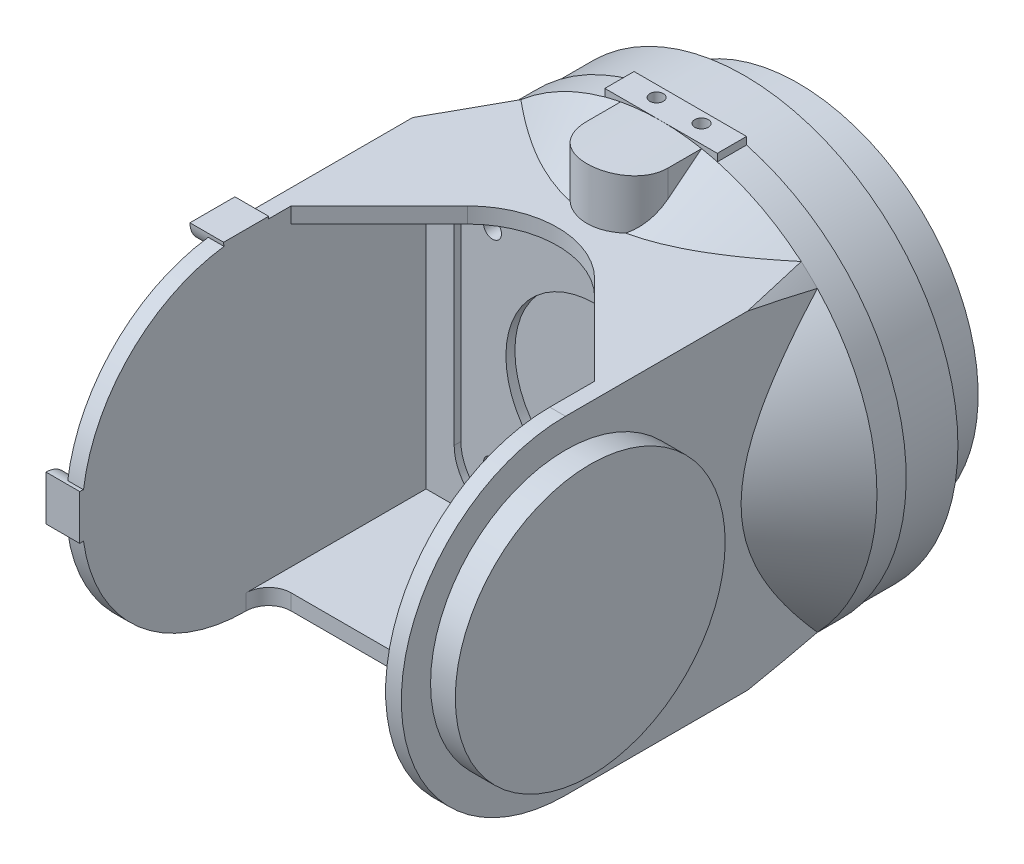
ISO-10303-21;
HEADER;
FILE_DESCRIPTION(('STEP AP214'),'2;1');
FILE_NAME('part.step','',(''),(''),'','','');
FILE_SCHEMA(('AUTOMOTIVE_DESIGN { 1 0 10303 214 1 1 1 1 }'));
ENDSEC;
DATA;
#1=APPLICATION_CONTEXT('core data for automotive mechanical design processes');
#2=APPLICATION_PROTOCOL_DEFINITION('international standard','automotive_design',2000,#1);
#3=PRODUCT_CONTEXT('',#1,'mechanical');
#4=PRODUCT('Part','Part','',(#3));
#5=PRODUCT_RELATED_PRODUCT_CATEGORY('part','',(#4));
#6=PRODUCT_DEFINITION_FORMATION('','',#4);
#7=PRODUCT_DEFINITION_CONTEXT('part definition',#1,'design');
#8=PRODUCT_DEFINITION('design','',#6,#7);
#9=PRODUCT_DEFINITION_SHAPE('','',#8);
#10=(LENGTH_UNIT() NAMED_UNIT(*) SI_UNIT(.MILLI.,.METRE.));
#11=(NAMED_UNIT(*) PLANE_ANGLE_UNIT() SI_UNIT($,.RADIAN.));
#12=(NAMED_UNIT(*) SI_UNIT($,.STERADIAN.) SOLID_ANGLE_UNIT());
#13=UNCERTAINTY_MEASURE_WITH_UNIT(LENGTH_MEASURE(1.E-05),#10,'distance_accuracy_value','');
#14=(GEOMETRIC_REPRESENTATION_CONTEXT(3) GLOBAL_UNCERTAINTY_ASSIGNED_CONTEXT((#13)) GLOBAL_UNIT_ASSIGNED_CONTEXT((#10,
#11,#12)) REPRESENTATION_CONTEXT('',''));
#15=CARTESIAN_POINT('',(0.,0.,0.));
#16=DIRECTION('',(0.,0.,1.));
#17=DIRECTION('',(1.,0.,0.));
#18=AXIS2_PLACEMENT_3D('',#15,#16,#17);
#19=CARTESIAN_POINT('',(0.,0.,0.));
#20=DIRECTION('',(0.,0.,-1.));
#21=DIRECTION('',(-1.,0.,0.));
#22=AXIS2_PLACEMENT_3D('',#19,#20,#21);
#23=CYLINDRICAL_SURFACE('',#22,96.);
#24=CARTESIAN_POINT('',(0.,0.,12.9999999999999));
#25=DIRECTION('',(0.,0.,1.));
#26=DIRECTION('',(1.,0.,0.));
#27=AXIS2_PLACEMENT_3D('',#24,#25,#26);
#28=CIRCLE('',#27,96.);
#29=CARTESIAN_POINT('',(18.,94.2974018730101,12.9999999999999));
#30=VERTEX_POINT('',#29);
#31=CARTESIAN_POINT('',(0.,96.0000000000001,12.9999999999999));
#32=VERTEX_POINT('',#31);
#33=EDGE_CURVE('E657',#30,#32,#28,.T.);
#34=ORIENTED_EDGE('',*,*,#33,.T.);
#35=CARTESIAN_POINT('',(0.,0.,12.9999999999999));
#36=DIRECTION('',(0.,0.,1.));
#37=DIRECTION('',(1.,0.,0.));
#38=AXIS2_PLACEMENT_3D('',#35,#36,#37);
#39=CIRCLE('',#38,96.);
#40=CARTESIAN_POINT('',(-18.,94.2974018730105,12.9999999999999));
#41=VERTEX_POINT('',#40);
#42=EDGE_CURVE('E659',#32,#41,#39,.T.);
#43=ORIENTED_EDGE('',*,*,#42,.T.);
#44=DIRECTION('',(0.,0.,-1.));
#45=VECTOR('',#44,1.);
#46=CARTESIAN_POINT('',(-18.,94.2974018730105,0.));
#47=LINE('',#46,#45);
#48=CARTESIAN_POINT('',(-18.,94.2974018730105,28.));
#49=VERTEX_POINT('',#48);
#50=EDGE_CURVE('E369',#41,#49,#47,.F.);
#51=ORIENTED_EDGE('',*,*,#50,.T.);
#52=CARTESIAN_POINT('',(0.,96.0000000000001,9.99999999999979));
#53=CARTESIAN_POINT('',(-0.50089416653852,95.9999987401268,10.0000028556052));
#54=CARTESIAN_POINT('',(-1.00185481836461,95.9960696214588,10.0209257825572));
#55=CARTESIAN_POINT('',(-2.00021956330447,95.9804590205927,10.1044655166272));
#56=CARTESIAN_POINT('',(-2.49762299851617,95.9687761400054,10.1670898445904));
#57=CARTESIAN_POINT('',(-3.48563989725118,95.9379735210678,10.3336064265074));
#58=CARTESIAN_POINT('',(-3.97624785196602,95.918848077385,10.4375303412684));
#59=CARTESIAN_POINT('',(-4.94676323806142,95.873695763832,10.6858317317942));
#60=CARTESIAN_POINT('',(-5.42667113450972,95.847669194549,10.8302074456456));
#61=CARTESIAN_POINT('',(-6.37202288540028,95.7894640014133,11.1581648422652));
#62=CARTESIAN_POINT('',(-6.83747938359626,95.7572909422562,11.3417110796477));
#63=CARTESIAN_POINT('',(-7.75118016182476,95.6876646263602,11.7467254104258));
#64=CARTESIAN_POINT('',(-8.1994242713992,95.650211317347,11.9681938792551));
#65=CARTESIAN_POINT('',(-9.0756132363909,95.571056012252,12.4474258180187));
#66=CARTESIAN_POINT('',(-9.50356017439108,95.5293544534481,12.7051855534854));
#67=CARTESIAN_POINT('',(-10.3363435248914,95.4428378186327,13.2552035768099));
#68=CARTESIAN_POINT('',(-10.7411797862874,95.3980227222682,13.5474620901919));
#69=CARTESIAN_POINT('',(-11.5292642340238,95.3060080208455,14.1677831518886));
#70=CARTESIAN_POINT('',(-11.9122341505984,95.2587879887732,14.4961962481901));
#71=CARTESIAN_POINT('',(-12.6492303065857,95.1637276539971,15.183954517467));
#72=CARTESIAN_POINT('',(-13.0032563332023,95.1158873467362,15.5432999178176));
#73=CARTESIAN_POINT('',(-13.6799788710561,95.0209185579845,16.2905055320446));
#74=CARTESIAN_POINT('',(-14.0026731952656,94.973790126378,16.678367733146));
#75=CARTESIAN_POINT('',(-14.6144793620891,94.8815721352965,17.4799615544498));
#76=CARTESIAN_POINT('',(-14.903591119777,94.8364825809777,17.8936932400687));
#77=CARTESIAN_POINT('',(-15.4483532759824,94.7492749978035,18.7476010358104));
#78=CARTESIAN_POINT('',(-15.7037198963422,94.7071833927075,19.187960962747));
#79=CARTESIAN_POINT('',(-16.1763976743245,94.6275944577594,20.0890577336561));
#80=CARTESIAN_POINT('',(-16.3937085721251,94.590097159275,20.5497947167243));
#81=CARTESIAN_POINT('',(-16.7886218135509,94.5208040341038,21.4883662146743));
#82=CARTESIAN_POINT('',(-16.9662268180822,94.4890078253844,21.9661995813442));
#83=CARTESIAN_POINT('',(-17.280367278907,94.4320624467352,22.9355666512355));
#84=CARTESIAN_POINT('',(-17.4169032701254,94.4069131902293,23.4271001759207));
#85=CARTESIAN_POINT('',(-17.6464853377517,94.3642678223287,24.4145412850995));
#86=CARTESIAN_POINT('',(-17.7400162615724,94.3466865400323,24.9103324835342));
#87=CARTESIAN_POINT('',(-17.8851528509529,94.3192810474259,25.9082270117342));
#88=CARTESIAN_POINT('',(-17.9367588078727,94.3094567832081,26.4103302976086));
#89=CARTESIAN_POINT('',(-17.9976280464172,94.297859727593,27.4171501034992));
#90=CARTESIAN_POINT('',(-18.0068946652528,94.2960863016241,27.9218664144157));
#91=CARTESIAN_POINT('',(-17.9830190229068,94.3006424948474,28.9302560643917));
#92=CARTESIAN_POINT('',(-17.9498770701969,94.3069720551,29.4339294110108));
#93=CARTESIAN_POINT('',(-17.8421696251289,94.3274081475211,30.4299336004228));
#94=CARTESIAN_POINT('',(-17.7681564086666,94.3414109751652,30.9223264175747));
#95=CARTESIAN_POINT('',(-17.5796730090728,94.376714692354,31.8990338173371));
#96=CARTESIAN_POINT('',(-17.465203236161,94.3980155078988,32.3833484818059));
#97=CARTESIAN_POINT('',(-17.1966781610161,94.4473020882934,33.3405384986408));
#98=CARTESIAN_POINT('',(-17.0426216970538,94.4752880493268,33.813413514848));
#99=CARTESIAN_POINT('',(-16.6960752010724,94.5371462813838,34.7444657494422));
#100=CARTESIAN_POINT('',(-16.5035848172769,94.5710186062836,35.2026428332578));
#101=CARTESIAN_POINT('',(-16.0803069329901,94.6439120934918,36.1038919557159));
#102=CARTESIAN_POINT('',(-15.8492970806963,94.6829628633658,36.5468571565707));
#103=CARTESIAN_POINT('',(-15.3514535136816,94.7649538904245,37.4117943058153));
#104=CARTESIAN_POINT('',(-15.0846197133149,94.8078941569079,37.8337662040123));
#105=CARTESIAN_POINT('',(-14.5169635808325,94.8964712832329,38.6539439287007));
#106=CARTESIAN_POINT('',(-14.2161383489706,94.9421083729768,39.0521477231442));
#107=CARTESIAN_POINT('',(-13.5825662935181,95.0348165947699,39.822117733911));
#108=CARTESIAN_POINT('',(-13.2498191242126,95.0818877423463,40.193883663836));
#109=CARTESIAN_POINT('',(-12.5491434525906,95.1769190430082,40.9141547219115));
#110=CARTESIAN_POINT('',(-12.180742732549,95.2248815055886,41.2622003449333));
#111=CARTESIAN_POINT('',(-11.4158222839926,95.3196070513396,41.9260713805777));
#112=CARTESIAN_POINT('',(-11.0193022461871,95.3663701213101,42.2418964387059));
#113=CARTESIAN_POINT('',(-10.2008452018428,95.4573845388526,42.8391169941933));
#114=CARTESIAN_POINT('',(-9.77890779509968,95.5016358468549,43.1205119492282));
#115=CARTESIAN_POINT('',(-8.91251849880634,95.5863820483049,43.6468503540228));
#116=CARTESIAN_POINT('',(-8.46806670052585,95.6268769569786,43.8917939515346));
#117=CARTESIAN_POINT('',(-7.55915352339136,95.7030167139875,44.3437177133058));
#118=CARTESIAN_POINT('',(-7.09466753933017,95.7386553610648,44.5506494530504));
#119=CARTESIAN_POINT('',(-6.14948766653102,95.8040092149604,44.9246004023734));
#120=CARTESIAN_POINT('',(-5.66879373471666,95.8337244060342,45.0916195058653));
#121=CARTESIAN_POINT('',(-4.6946891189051,95.8863794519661,45.3844333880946));
#122=CARTESIAN_POINT('',(-4.20127954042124,95.9093198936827,45.5102317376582));
#123=CARTESIAN_POINT('',(-3.20530078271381,95.9477690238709,45.7196216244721));
#124=CARTESIAN_POINT('',(-2.70273172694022,95.9632778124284,45.8032137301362));
#125=CARTESIAN_POINT('',(-1.69960973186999,95.9862453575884,45.9265979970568));
#126=CARTESIAN_POINT('',(-1.199136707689,95.9938196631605,45.9670190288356));
#127=CARTESIAN_POINT('',(-0.196508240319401,96.0011078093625,46.0059176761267));
#128=CARTESIAN_POINT('',(0.305647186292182,96.000821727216,46.0043957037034));
#129=CARTESIAN_POINT('',(1.30798574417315,95.9923973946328,45.9594220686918));
#130=CARTESIAN_POINT('',(1.80816896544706,95.9842595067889,45.9159723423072));
#131=CARTESIAN_POINT('',(2.80297976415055,95.9603609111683,45.7874911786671));
#132=CARTESIAN_POINT('',(3.29760735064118,95.944600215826,45.7024598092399));
#133=CARTESIAN_POINT('',(4.27392933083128,95.9060496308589,45.4923103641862));
#134=CARTESIAN_POINT('',(4.75569464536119,95.883315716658,45.3675112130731));
#135=CARTESIAN_POINT('',(5.70692128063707,95.8314037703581,45.0785867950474));
#136=CARTESIAN_POINT('',(6.17638268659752,95.8022257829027,44.914461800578));
#137=CARTESIAN_POINT('',(7.099812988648,95.7382206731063,44.5480938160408));
#138=CARTESIAN_POINT('',(7.55378108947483,95.7033932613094,44.3458488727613));
#139=CARTESIAN_POINT('',(8.44314372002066,95.62903576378,43.9047076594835));
#140=CARTESIAN_POINT('',(8.87853803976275,95.589505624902,43.665810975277));
#141=CARTESIAN_POINT('',(9.73250010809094,95.5063584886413,43.1502447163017));
#142=CARTESIAN_POINT('',(10.1508320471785,95.4627015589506,42.8731909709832));
#143=CARTESIAN_POINT('',(10.9627444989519,95.372873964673,42.2852878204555));
#144=CARTESIAN_POINT('',(11.3563248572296,95.3267032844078,41.97443820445));
#145=CARTESIAN_POINT('',(12.1161345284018,95.2331131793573,41.3210495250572));
#146=CARTESIAN_POINT('',(12.4823615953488,95.1856936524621,40.9785078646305));
#147=CARTESIAN_POINT('',(13.1849775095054,95.0909147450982,40.2640693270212));
#148=CARTESIAN_POINT('',(13.5213661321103,95.043555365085,39.8921722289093));
#149=CARTESIAN_POINT('',(14.1662929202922,94.9495854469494,39.1163822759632));
#150=CARTESIAN_POINT('',(14.4744011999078,94.9029932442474,38.712129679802));
#151=CARTESIAN_POINT('',(15.0554687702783,94.8125485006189,37.8788095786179));
#152=CARTESIAN_POINT('',(15.3284277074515,94.7686959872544,37.4497418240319));
#153=CARTESIAN_POINT('',(15.8372160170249,94.6849992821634,36.5697656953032));
#154=CARTESIAN_POINT('',(16.0730462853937,94.6451549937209,36.1188578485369));
#155=CARTESIAN_POINT('',(16.5058320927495,94.5706389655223,35.1983443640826));
#156=CARTESIAN_POINT('',(16.7027879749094,94.5359671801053,34.7287388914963));
#157=CARTESIAN_POINT('',(17.0554611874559,94.4729760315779,33.7764848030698));
#158=CARTESIAN_POINT('',(17.2113746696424,94.4446265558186,33.2939108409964));
#159=CARTESIAN_POINT('',(17.4820048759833,94.3949069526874,32.3169900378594));
#160=CARTESIAN_POINT('',(17.5967216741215,94.3735368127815,31.8226432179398));
#161=CARTESIAN_POINT('',(17.7840363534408,94.3384181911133,30.8258123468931));
#162=CARTESIAN_POINT('',(17.8566382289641,94.3246689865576,30.3233290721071));
#163=CARTESIAN_POINT('',(17.9591509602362,94.3052046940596,29.3138738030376));
#164=CARTESIAN_POINT('',(17.9890623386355,94.2994895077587,28.8069018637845));
#165=CARTESIAN_POINT('',(18.0058175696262,94.2962915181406,27.8002926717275));
#166=CARTESIAN_POINT('',(17.9933386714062,94.2986792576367,27.3006669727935));
#167=CARTESIAN_POINT('',(17.9269028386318,94.3113317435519,26.3042860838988));
#168=CARTESIAN_POINT('',(17.8729463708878,94.3215964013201,25.8075308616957));
#169=CARTESIAN_POINT('',(17.7239820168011,94.3497015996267,24.8204407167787));
#170=CARTESIAN_POINT('',(17.6289745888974,94.367542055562,24.3301057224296));
#171=CARTESIAN_POINT('',(17.3986465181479,94.4102790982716,23.3593130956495));
#172=CARTESIAN_POINT('',(17.2633257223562,94.4351757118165,22.8788555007));
#173=CARTESIAN_POINT('',(16.9536940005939,94.4912532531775,21.9320622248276));
#174=CARTESIAN_POINT('',(16.7794570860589,94.5224222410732,21.4657016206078));
#175=CARTESIAN_POINT('',(16.3931377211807,94.5901869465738,20.5493438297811));
#176=CARTESIAN_POINT('',(16.1810553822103,94.6267826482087,20.0993465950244));
#177=CARTESIAN_POINT('',(15.7205576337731,94.704374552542,19.2187144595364));
#178=CARTESIAN_POINT('',(15.472140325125,94.745370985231,18.7880805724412));
#179=CARTESIAN_POINT('',(14.9407174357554,94.8306245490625,17.9490514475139));
#180=CARTESIAN_POINT('',(14.6577114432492,94.8748817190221,17.540656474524));
#181=CARTESIAN_POINT('',(14.0545551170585,94.9661195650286,16.7428566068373));
#182=CARTESIAN_POINT('',(13.7339119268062,95.0131311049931,16.3538277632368));
#183=CARTESIAN_POINT('',(13.06118894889,95.1079423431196,15.6040723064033));
#184=CARTESIAN_POINT('',(12.7091087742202,95.1557420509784,15.2433460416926));
#185=CARTESIAN_POINT('',(11.9758215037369,95.2508077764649,14.5525661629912));
#186=CARTESIAN_POINT('',(11.5946077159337,95.298073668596,14.2225196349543));
#187=CARTESIAN_POINT('',(10.805705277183,95.3907460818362,13.595465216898));
#188=CARTESIAN_POINT('',(10.398016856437,95.436152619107,13.2984570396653));
#189=CARTESIAN_POINT('',(9.55513761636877,95.5242402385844,12.7370365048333));
#190=CARTESIAN_POINT('',(9.11973215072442,95.5668930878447,12.4729418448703));
#191=CARTESIAN_POINT('',(8.22776913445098,95.6478139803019,11.9824199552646));
#192=CARTESIAN_POINT('',(7.77121042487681,95.6860817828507,11.7559947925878));
#193=CARTESIAN_POINT('',(6.84058683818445,95.7571092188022,11.3427076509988));
#194=CARTESIAN_POINT('',(6.36653725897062,95.7898735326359,11.1558120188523));
#195=CARTESIAN_POINT('',(5.40399644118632,95.8489913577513,10.822804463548));
#196=CARTESIAN_POINT('',(4.91550813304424,95.8753461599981,10.6766843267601));
#197=CARTESIAN_POINT('',(4.06094229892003,95.9147500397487,10.4601235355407));
#198=CARTESIAN_POINT('',(3.69738646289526,95.9294706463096,10.3799007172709));
#199=CARTESIAN_POINT('',(2.96587350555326,95.9548720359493,10.242126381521));
#200=CARTESIAN_POINT('',(2.59791673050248,95.965553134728,10.1845730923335));
#201=CARTESIAN_POINT('',(1.85900815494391,95.9827102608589,10.0923836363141));
#202=CARTESIAN_POINT('',(1.4880560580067,95.9891858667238,10.0577497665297));
#203=CARTESIAN_POINT('',(0.744748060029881,95.9978308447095,10.0115588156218));
#204=CARTESIAN_POINT('',(0.372392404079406,96.0000009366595,9.99999787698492));
#205=CARTESIAN_POINT('',(0.,96.0000000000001,9.99999999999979));
#206=B_SPLINE_CURVE_WITH_KNOTS('',3,(#52,#53,#54,#55,#56,#57,#58,#59,#60,#61,#62,#63,#64,#65,
#66,#67,#68,#69,#70,#71,#72,#73,#74,#75,#76,#77,#78,#79,#80,#81,#82,#83,#84,#85,#86,#87,#88,#89,
#90,#91,#92,#93,#94,#95,#96,#97,#98,#99,#100,#101,#102,#103,#104,#105,#106,#107,#108,#109,#110,
#111,#112,#113,#114,#115,#116,#117,#118,#119,#120,#121,#122,#123,#124,#125,#126,#127,#128,#129,
#130,#131,#132,#133,#134,#135,#136,#137,#138,#139,#140,#141,#142,#143,#144,#145,#146,#147,#148,
#149,#150,#151,#152,#153,#154,#155,#156,#157,#158,#159,#160,#161,#162,#163,#164,#165,#166,#167,
#168,#169,#170,#171,#172,#173,#174,#175,#176,#177,#178,#179,#180,#181,#182,#183,#184,#185,#186,
#187,#188,#189,#190,#191,#192,#193,#194,#195,#196,#197,#198,#199,#200,#201,#202,#203,#204,#205),
.UNSPECIFIED.,.T.,.F.,(4,2,2,2,2,2,2,2,2,2,2,2,2,2,2,2,2,2,2,2,2,2,2,2,2,2,2,2,2,2,2,2,2,2,2,2,
2,2,2,2,2,2,2,2,2,2,2,2,2,2,2,2,2,2,2,2,2,2,2,2,2,2,2,2,2,2,2,2,2,2,2,2,2,2,2,2,4),(0.,
1.50234665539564,3.00496433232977,4.50873616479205,6.01244250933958,7.51479387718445,
9.01716011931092,10.5193718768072,12.0215934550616,13.5399348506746,15.0582874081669,
16.5767458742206,18.0952081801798,19.6257218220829,21.1562459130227,22.6866674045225,
24.2170689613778,25.7297658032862,27.2424521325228,28.755019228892,30.2675753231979,
31.7601760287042,33.2527616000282,34.7453909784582,36.2380340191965,37.7396121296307,
39.2411938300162,40.742903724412,42.2446298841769,43.7700479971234,45.2954828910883,
46.8209418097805,48.346394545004,49.8737773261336,51.4011641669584,52.9284186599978,
54.4556525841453,55.960322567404,57.4649777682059,58.9695634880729,60.474146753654,
61.9669552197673,63.4597533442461,64.9526279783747,66.4455194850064,67.9547215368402,
69.4639330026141,70.9732682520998,72.4826148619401,74.0120345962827,75.541469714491,
77.0708679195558,78.6002526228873,80.1221895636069,81.6441237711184,83.1659136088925,
84.6876848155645,86.1852585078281,87.6828153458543,89.18035546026,90.6779012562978,
92.1726228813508,93.6673401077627,95.162135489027,96.6569486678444,98.1741510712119,
99.6913721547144,101.20894279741,102.726500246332,104.257726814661,105.789037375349,
107.319038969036,108.848732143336,109.965821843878,111.082824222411,112.199938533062,
113.316866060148),.UNSPECIFIED.);
#207=CARTESIAN_POINT('',(18.,94.2974018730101,28.));
#208=VERTEX_POINT('',#207);
#209=EDGE_CURVE('E362',#49,#208,#206,.T.);
#210=ORIENTED_EDGE('',*,*,#209,.T.);
#211=DIRECTION('',(0.,0.,-1.));
#212=VECTOR('',#211,1.);
#213=CARTESIAN_POINT('',(18.,94.2974018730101,0.));
#214=LINE('',#213,#212);
#215=EDGE_CURVE('E368',#208,#30,#214,.T.);
#216=ORIENTED_EDGE('',*,*,#215,.T.);
#217=EDGE_LOOP('',(#34,#43,#51,#210,#216));
#218=FACE_BOUND('',#217,.T.);
#219=ADVANCED_FACE('F17',(#218),#23,.T.);
#220=DIRECTION('',(0.,0.,-1.));
#221=VECTOR('',#220,1.);
#222=CARTESIAN_POINT('',(25.,92.6876475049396,0.));
#223=LINE('',#222,#221);
#224=CARTESIAN_POINT('',(25.,92.6876475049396,0.));
#225=VERTEX_POINT('',#224);
#226=CARTESIAN_POINT('',(25.,92.6876475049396,12.9999999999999));
#227=VERTEX_POINT('',#226);
#228=EDGE_CURVE('E664',#225,#227,#223,.F.);
#229=ORIENTED_EDGE('',*,*,#228,.T.);
#230=CARTESIAN_POINT('',(0.,0.,12.9999999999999));
#231=DIRECTION('',(0.,0.,-1.));
#232=DIRECTION('',(-1.,0.,0.));
#233=AXIS2_PLACEMENT_3D('',#230,#231,#232);
#234=CIRCLE('',#233,96.);
#235=CARTESIAN_POINT('',(62.3458098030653,73.0000000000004,12.9999999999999));
#236=VERTEX_POINT('',#235);
#237=EDGE_CURVE('E416',#227,#236,#234,.T.);
#238=ORIENTED_EDGE('',*,*,#237,.T.);
#239=CARTESIAN_POINT('',(69.5,66.2249952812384,12.9999999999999));
#240=VERTEX_POINT('',#239);
#241=EDGE_CURVE('E421',#236,#240,#234,.T.);
#242=ORIENTED_EDGE('',*,*,#241,.T.);
#243=CARTESIAN_POINT('',(69.5,-66.2249952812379,12.9999999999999));
#244=VERTEX_POINT('',#243);
#245=EDGE_CURVE('E429',#240,#244,#234,.T.);
#246=ORIENTED_EDGE('',*,*,#245,.T.);
#247=CARTESIAN_POINT('',(62.3458098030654,-73.,12.9999999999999));
#248=VERTEX_POINT('',#247);
#249=EDGE_CURVE('E437',#244,#248,#234,.T.);
#250=ORIENTED_EDGE('',*,*,#249,.T.);
#251=CARTESIAN_POINT('',(-62.3458098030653,-73.0000000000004,12.9999999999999));
#252=VERTEX_POINT('',#251);
#253=EDGE_CURVE('E435',#248,#252,#234,.T.);
#254=ORIENTED_EDGE('',*,*,#253,.T.);
#255=CARTESIAN_POINT('',(-79.4999999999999,-53.8121733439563,12.9999999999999));
#256=VERTEX_POINT('',#255);
#257=EDGE_CURVE('E432',#252,#256,#234,.T.);
#258=ORIENTED_EDGE('',*,*,#257,.T.);
#259=CARTESIAN_POINT('',(-95.,-13.8202749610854,12.9999999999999));
#260=VERTEX_POINT('',#259);
#261=EDGE_CURVE('E428',#256,#260,#234,.T.);
#262=ORIENTED_EDGE('',*,*,#261,.T.);
#263=DIRECTION('',(0.,0.,-1.));
#264=VECTOR('',#263,1.);
#265=CARTESIAN_POINT('',(-95.,-13.8202749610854,4.44089209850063E-13));
#266=LINE('',#265,#264);
#267=CARTESIAN_POINT('',(-95.,-13.8202749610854,0.));
#268=VERTEX_POINT('',#267);
#269=EDGE_CURVE('E580',#268,#260,#266,.F.);
#270=ORIENTED_EDGE('',*,*,#269,.F.);
#271=CARTESIAN_POINT('',(0.,0.,0.));
#272=DIRECTION('',(0.,0.,-1.));
#273=DIRECTION('',(-1.,0.,0.));
#274=AXIS2_PLACEMENT_3D('',#271,#272,#273);
#275=CIRCLE('',#274,96.);
#276=EDGE_CURVE('E313',#225,#268,#275,.T.);
#277=ORIENTED_EDGE('',*,*,#276,.F.);
#278=EDGE_LOOP('',(#229,#238,#242,#246,#250,#254,#258,#262,#270,#277));
#279=FACE_BOUND('',#278,.T.);
#280=ADVANCED_FACE('F377',(#279),#23,.T.);
#281=CARTESIAN_POINT('',(-79.5,0.,125.));
#282=DIRECTION('',(1.,0.,0.));
#283=DIRECTION('',(0.,0.,-1.));
#284=AXIS2_PLACEMENT_3D('',#281,#282,#283);
#285=PLANE('',#284);
#286=CARTESIAN_POINT('',(-79.5,0.,125.));
#287=DIRECTION('',(-1.,0.,0.));
#288=DIRECTION('',(0.,0.,1.));
#289=AXIS2_PLACEMENT_3D('',#286,#287,#288);
#290=CIRCLE('',#289,55.);
#291=CARTESIAN_POINT('',(-79.5,0.,180.));
#292=VERTEX_POINT('',#291);
#293=EDGE_CURVE('E989',#292,#292,#290,.T.);
#294=ORIENTED_EDGE('',*,*,#293,.F.);
#295=EDGE_LOOP('',(#294));
#296=FACE_BOUND('',#295,.T.);
#297=CARTESIAN_POINT('',(-79.5,-4.44089209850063E-13,199.));
#298=DIRECTION('',(1.,0.,0.));
#299=DIRECTION('',(0.,0.,-1.));
#300=AXIS2_PLACEMENT_3D('',#297,#298,#299);
#301=CIRCLE('',#300,10.);
#302=CARTESIAN_POINT('',(-79.5,9.85975200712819,197.331081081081));
#303=VERTEX_POINT('',#302);
#304=CARTESIAN_POINT('',(-79.5,-9.85975200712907,197.331081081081));
#305=VERTEX_POINT('',#304);
#306=EDGE_CURVE('E532',#303,#305,#301,.F.);
#307=ORIENTED_EDGE('',*,*,#306,.F.);
#308=CARTESIAN_POINT('',(-79.5,0.,125.));
#309=DIRECTION('',(1.,0.,0.));
#310=DIRECTION('',(0.,0.,-1.));
#311=AXIS2_PLACEMENT_3D('',#308,#309,#310);
#312=CIRCLE('',#311,73.);
#313=CARTESIAN_POINT('',(-79.5,72.3310810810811,134.859752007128));
#314=VERTEX_POINT('',#313);
#315=EDGE_CURVE('E771',#314,#303,#312,.T.);
#316=ORIENTED_EDGE('',*,*,#315,.F.);
#317=CARTESIAN_POINT('',(-79.5,73.9999999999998,125.));
#318=DIRECTION('',(1.,0.,0.));
#319=DIRECTION('',(0.,0.,-1.));
#320=AXIS2_PLACEMENT_3D('',#317,#318,#319);
#321=CIRCLE('',#320,10.);
#322=CARTESIAN_POINT('',(-79.4999999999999,73.,115.050125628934));
#323=VERTEX_POINT('',#322);
#324=EDGE_CURVE('E509',#323,#314,#321,.F.);
#325=ORIENTED_EDGE('',*,*,#324,.F.);
#326=DIRECTION('',(0.,0.,-1.));
#327=VECTOR('',#326,1.);
#328=CARTESIAN_POINT('',(-79.4999999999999,73.,125.));
#329=LINE('',#328,#327);
#330=CARTESIAN_POINT('',(-79.4999999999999,73.,44.));
#331=VERTEX_POINT('',#330);
#332=EDGE_CURVE('E705',#323,#331,#329,.T.);
#333=ORIENTED_EDGE('',*,*,#332,.T.);
#334=CARTESIAN_POINT('',(-79.5,53.8121733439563,12.9999999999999));
#335=CARTESIAN_POINT('',(-79.5,54.4573801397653,13.7892486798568));
#336=CARTESIAN_POINT('',(-79.5,55.0924434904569,14.5867514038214));
#337=CARTESIAN_POINT('',(-79.5,56.3413111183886,16.195255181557));
#338=CARTESIAN_POINT('',(-79.5,56.9551615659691,17.0062203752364));
#339=CARTESIAN_POINT('',(-79.5,58.1625980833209,18.6409256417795));
#340=CARTESIAN_POINT('',(-79.5,58.7562172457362,19.4646412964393));
#341=CARTESIAN_POINT('',(-79.5,59.9240817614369,21.124225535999));
#342=CARTESIAN_POINT('',(-79.5,60.4983492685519,21.9600785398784));
#343=CARTESIAN_POINT('',(-79.5,61.6283107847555,23.6433723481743));
#344=CARTESIAN_POINT('',(-79.5,62.1840177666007,24.4908044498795));
#345=CARTESIAN_POINT('',(-79.5,63.2775798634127,26.1967490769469));
#346=CARTESIAN_POINT('',(-79.5,63.8154402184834,27.055258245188));
#347=CARTESIAN_POINT('',(-79.5,64.8736856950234,28.7824475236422));
#348=CARTESIAN_POINT('',(-79.5,65.3940785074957,29.6511229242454));
#349=CARTESIAN_POINT('',(-79.5,66.4183312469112,31.3987672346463));
#350=CARTESIAN_POINT('',(-79.5,66.9221824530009,32.2777412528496));
#351=CARTESIAN_POINT('',(-79.5,67.9139218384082,34.0456769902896));
#352=CARTESIAN_POINT('',(-79.5,68.4017953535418,34.934646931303));
#353=CARTESIAN_POINT('',(-79.5,69.3620929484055,36.7222997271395));
#354=CARTESIAN_POINT('',(-79.5,69.8344972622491,37.6209931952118));
#355=CARTESIAN_POINT('',(-79.5,70.7643214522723,39.4278423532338));
#356=CARTESIAN_POINT('',(-79.5,71.2217171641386,40.3360104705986));
#357=CARTESIAN_POINT('',(-79.5,72.1219402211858,42.1615926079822));
#358=CARTESIAN_POINT('',(-79.5,72.5647395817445,43.079020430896));
#359=CARTESIAN_POINT('',(-79.4999999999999,73.,44.));
#360=B_SPLINE_CURVE_WITH_KNOTS('',3,(#334,#335,#336,#337,#338,#339,#340,#341,#342,#343,#344,
#345,#346,#347,#348,#349,#350,#351,#352,#353,#354,#355,#356,#357,#358,#359),.UNSPECIFIED.,.F.,
.F.,(4,2,2,2,2,2,2,2,2,2,2,2,4),(0.,3.05811541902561,6.10909132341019,9.15481048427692,
12.1969154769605,15.2368477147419,18.2758793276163,21.3135548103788,24.3528068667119,
27.3947743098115,30.4404879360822,33.4908860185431,36.5468273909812),.UNSPECIFIED.);
#361=CARTESIAN_POINT('',(-79.5,53.8121733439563,12.9999999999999));
#362=VERTEX_POINT('',#361);
#363=EDGE_CURVE('E702',#362,#331,#360,.T.);
#364=ORIENTED_EDGE('',*,*,#363,.F.);
#365=CARTESIAN_POINT('',(-79.5,-127.056841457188,-55.9618740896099));
#366=CARTESIAN_POINT('',(-79.5,-125.638637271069,-54.423089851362));
#367=CARTESIAN_POINT('',(-79.5,-124.21684682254,-52.8876033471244));
#368=CARTESIAN_POINT('',(-79.5,-121.365387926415,-49.8239406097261));
#369=CARTESIAN_POINT('',(-79.5,-119.935719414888,-48.2957644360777));
#370=CARTESIAN_POINT('',(-79.5,-117.067581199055,-45.2472063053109));
#371=CARTESIAN_POINT('',(-79.5,-115.629110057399,-43.7268256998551));
#372=CARTESIAN_POINT('',(-79.5,-112.742805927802,-40.6949787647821));
#373=CARTESIAN_POINT('',(-79.5,-111.294972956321,-39.1835124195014));
#374=CARTESIAN_POINT('',(-79.5,-108.378182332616,-36.159204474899));
#375=CARTESIAN_POINT('',(-79.5,-106.90914767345,-34.6464371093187));
#376=CARTESIAN_POINT('',(-79.5,-103.959633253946,-31.632102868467));
#377=CARTESIAN_POINT('',(-79.5,-102.479153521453,-30.1305359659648));
#378=CARTESIAN_POINT('',(-79.5,-99.5056854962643,-27.1400556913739));
#379=CARTESIAN_POINT('',(-79.5,-98.0126981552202,-25.6511413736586));
#380=CARTESIAN_POINT('',(-79.5,-95.0127715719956,-22.6874222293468));
#381=CARTESIAN_POINT('',(-79.5,-93.5058323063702,-21.2126174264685));
#382=CARTESIAN_POINT('',(-79.5,-90.2977099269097,-18.1058256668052));
#383=CARTESIAN_POINT('',(-79.5,-88.5945936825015,-16.4758323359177));
#384=CARTESIAN_POINT('',(-79.5,-85.1665923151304,-13.23885543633));
#385=CARTESIAN_POINT('',(-79.5,-83.4417070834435,-11.6318719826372));
#386=CARTESIAN_POINT('',(-79.5,-79.9668302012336,-8.44420245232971));
#387=CARTESIAN_POINT('',(-79.5,-78.2168312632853,-6.86352430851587));
#388=CARTESIAN_POINT('',(-79.5,-74.6889486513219,-3.73357373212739));
#389=CARTESIAN_POINT('',(-79.5,-72.9110652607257,-2.18430098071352));
#390=CARTESIAN_POINT('',(-79.5,-69.3293929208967,0.872169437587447));
#391=CARTESIAN_POINT('',(-79.5,-67.5257066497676,2.37948723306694));
#392=CARTESIAN_POINT('',(-79.5,-63.8823092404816,5.3503045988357));
#393=CARTESIAN_POINT('',(-79.5,-62.0425964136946,6.81380210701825));
#394=CARTESIAN_POINT('',(-79.5,-59.2528751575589,8.96894159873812));
#395=CARTESIAN_POINT('',(-79.5,-58.3181897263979,9.6804571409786));
#396=CARTESIAN_POINT('',(-79.5,-56.4379080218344,11.0889096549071));
#397=CARTESIAN_POINT('',(-79.5,-55.4923119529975,11.7858468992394));
#398=CARTESIAN_POINT('',(-79.5,-53.589583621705,13.1635802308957));
#399=CARTESIAN_POINT('',(-79.5,-52.6324526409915,13.8443780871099));
#400=CARTESIAN_POINT('',(-79.5,-50.7058185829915,15.1882014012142));
#401=CARTESIAN_POINT('',(-79.5,-49.7363158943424,15.8512274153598));
#402=CARTESIAN_POINT('',(-79.5,-48.0651285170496,16.9695717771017));
#403=CARTESIAN_POINT('',(-79.5,-47.3666877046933,17.4297392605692));
#404=CARTESIAN_POINT('',(-79.5,-45.9628548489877,18.3393164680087));
#405=CARTESIAN_POINT('',(-79.5,-45.2574628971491,18.7887263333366));
#406=CARTESIAN_POINT('',(-79.5,-43.1303844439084,20.1196226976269));
#407=CARTESIAN_POINT('',(-79.5,-41.6977772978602,20.9837880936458));
#408=CARTESIAN_POINT('',(-79.5,-38.8004703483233,22.6588368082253));
#409=CARTESIAN_POINT('',(-79.5,-37.3357510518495,23.4696864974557));
#410=CARTESIAN_POINT('',(-79.5,-34.3731632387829,25.0286347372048));
#411=CARTESIAN_POINT('',(-79.5,-32.8752952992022,25.7767343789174));
#412=CARTESIAN_POINT('',(-79.5,-29.8761129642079,27.185370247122));
#413=CARTESIAN_POINT('',(-79.5,-28.3754961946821,27.8473849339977));
#414=CARTESIAN_POINT('',(-79.5,-25.3408338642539,29.0905766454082));
#415=CARTESIAN_POINT('',(-79.5,-23.8067864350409,29.6717491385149));
#416=CARTESIAN_POINT('',(-79.5,-20.7084817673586,30.7408542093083));
#417=CARTESIAN_POINT('',(-79.5,-19.1442641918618,31.2289010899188));
#418=CARTESIAN_POINT('',(-79.5,-15.9871262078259,32.1006855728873));
#419=CARTESIAN_POINT('',(-79.4999999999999,-14.3942141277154,32.4844529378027));
#420=CARTESIAN_POINT('',(-79.4999999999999,-11.8701923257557,32.9976119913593));
#421=CARTESIAN_POINT('',(-79.5,-10.9468190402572,33.1656615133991));
#422=CARTESIAN_POINT('',(-79.5,-9.09377535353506,33.462250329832));
#423=CARTESIAN_POINT('',(-79.5,-8.16410551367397,33.5907931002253));
#424=CARTESIAN_POINT('',(-79.5,-6.30012150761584,33.8069354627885));
#425=CARTESIAN_POINT('',(-79.5,-5.36580788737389,33.8945397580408));
#426=CARTESIAN_POINT('',(-79.5,-3.49416476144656,34.0278221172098));
#427=CARTESIAN_POINT('',(-79.5,-2.55683519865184,34.0734993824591));
#428=CARTESIAN_POINT('',(-79.5,-0.680576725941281,34.1223937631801));
#429=CARTESIAN_POINT('',(-79.5,0.258352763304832,34.1255887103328));
#430=CARTESIAN_POINT('',(-79.5,2.13538512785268,34.0894234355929));
#431=CARTESIAN_POINT('',(-79.5,3.07348800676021,34.0500634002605));
#432=CARTESIAN_POINT('',(-79.5,4.94703038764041,33.9292535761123));
#433=CARTESIAN_POINT('',(-79.5,5.88246971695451,33.847801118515));
#434=CARTESIAN_POINT('',(-79.5,7.74883772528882,33.6437513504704));
#435=CARTESIAN_POINT('',(-79.4999999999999,8.67976639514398,33.5211539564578));
#436=CARTESIAN_POINT('',(-79.4999999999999,10.5289866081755,33.2371802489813));
#437=CARTESIAN_POINT('',(-79.5,11.4473209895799,33.0760820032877));
#438=CARTESIAN_POINT('',(-79.5,13.276580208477,32.716336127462));
#439=CARTESIAN_POINT('',(-79.5,14.1875050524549,32.5176885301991));
#440=CARTESIAN_POINT('',(-79.5,16.0007855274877,32.0847686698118));
#441=CARTESIAN_POINT('',(-79.5,16.903141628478,31.8504983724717));
#442=CARTESIAN_POINT('',(-79.5,18.6984963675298,31.3484034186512));
#443=CARTESIAN_POINT('',(-79.5,19.5914940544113,31.0805753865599));
#444=CARTESIAN_POINT('',(-79.5,22.258592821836,30.2289726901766));
#445=CARTESIAN_POINT('',(-79.5,24.0177954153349,29.5978094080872));
#446=CARTESIAN_POINT('',(-79.5,26.6237985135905,28.5698358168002));
#447=CARTESIAN_POINT('',(-79.5,27.4870394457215,28.2136210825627));
#448=CARTESIAN_POINT('',(-79.5,29.2028154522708,27.4760974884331));
#449=CARTESIAN_POINT('',(-79.5,30.0553501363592,27.0947877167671));
#450=CARTESIAN_POINT('',(-79.5,32.0200600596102,26.1837048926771));
#451=CARTESIAN_POINT('',(-79.5,33.1282701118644,25.6453864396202));
#452=CARTESIAN_POINT('',(-79.5,35.3265452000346,24.5327492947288));
#453=CARTESIAN_POINT('',(-79.5,36.4166084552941,23.9584270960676));
#454=CARTESIAN_POINT('',(-79.5,38.5795674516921,22.7774049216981));
#455=CARTESIAN_POINT('',(-79.5,39.6524563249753,22.1706923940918));
#456=CARTESIAN_POINT('',(-79.5,41.7813947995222,20.9285306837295));
#457=CARTESIAN_POINT('',(-79.5,42.8374448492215,20.2930822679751));
#458=CARTESIAN_POINT('',(-79.5,44.9354095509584,18.9953561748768));
#459=CARTESIAN_POINT('',(-79.5,45.9772968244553,18.3330343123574));
#460=CARTESIAN_POINT('',(-79.5,48.0460008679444,16.985279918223));
#461=CARTESIAN_POINT('',(-79.5,49.0728175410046,16.2998472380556));
#462=CARTESIAN_POINT('',(-79.5,51.1121191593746,14.9083688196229));
#463=CARTESIAN_POINT('',(-79.5,52.1246064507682,14.20232651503));
#464=CARTESIAN_POINT('',(-79.5,54.1363143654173,12.7716147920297));
#465=CARTESIAN_POINT('',(-79.5,55.1355350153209,12.0469454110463));
#466=CARTESIAN_POINT('',(-79.5,57.1359210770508,10.5702271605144));
#467=CARTESIAN_POINT('',(-79.5,58.136905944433,9.81793396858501));
#468=CARTESIAN_POINT('',(-79.5,60.1269617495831,8.29776508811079));
#469=CARTESIAN_POINT('',(-79.5,61.1160326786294,7.52988938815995));
#470=CARTESIAN_POINT('',(-79.5,63.0830794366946,5.98003134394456));
#471=CARTESIAN_POINT('',(-79.5,64.0610550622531,5.1980487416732));
#472=CARTESIAN_POINT('',(-79.5,66.0066479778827,3.62129957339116));
#473=CARTESIAN_POINT('',(-79.5,66.9742652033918,2.82653292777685));
#474=CARTESIAN_POINT('',(-79.5,68.898794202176,1.22624467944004));
#475=CARTESIAN_POINT('',(-79.5,69.855716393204,0.420735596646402));
#476=CARTESIAN_POINT('',(-79.5,71.7605583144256,-1.20085017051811));
#477=CARTESIAN_POINT('',(-79.5,72.70847804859,-2.01692685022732));
#478=CARTESIAN_POINT('',(-79.5,74.5958693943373,-3.65870038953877));
#479=CARTESIAN_POINT('',(-79.5,75.5353413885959,-4.48439680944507));
#480=CARTESIAN_POINT('',(-79.5,77.4064304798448,-6.14463533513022));
#481=CARTESIAN_POINT('',(-79.5,78.3380475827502,-6.9791774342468));
#482=CARTESIAN_POINT('',(-79.5,80.3455349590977,-8.79338314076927));
#483=CARTESIAN_POINT('',(-79.5,81.4201080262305,-9.77448215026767));
#484=CARTESIAN_POINT('',(-79.5,83.560053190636,-11.7466690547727));
#485=CARTESIAN_POINT('',(-79.5,84.6254252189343,-12.7377570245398));
#486=CARTESIAN_POINT('',(-79.5,87.8088276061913,-15.7247023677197));
#487=CARTESIAN_POINT('',(-79.5,89.914085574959,-17.7341879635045));
#488=CARTESIAN_POINT('',(-79.5,94.0954919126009,-21.783783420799));
#489=CARTESIAN_POINT('',(-79.5,96.1716357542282,-23.8238979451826));
#490=CARTESIAN_POINT('',(-79.5,100.298349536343,-27.9297522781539));
#491=CARTESIAN_POINT('',(-79.5,102.348919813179,-29.9954917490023));
#492=CARTESIAN_POINT('',(-79.5,106.42897908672,-34.1500808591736));
#493=CARTESIAN_POINT('',(-79.5,108.45845478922,-36.2389435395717));
#494=CARTESIAN_POINT('',(-79.5,112.497829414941,-40.4355083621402));
#495=CARTESIAN_POINT('',(-79.5,114.507728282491,-42.543210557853));
#496=CARTESIAN_POINT('',(-79.5,118.510107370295,-46.7747703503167));
#497=CARTESIAN_POINT('',(-79.5,120.502588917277,-48.8986266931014));
#498=CARTESIAN_POINT('',(-79.5,124.472258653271,-53.1605710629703));
#499=CARTESIAN_POINT('',(-79.5,126.449446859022,-55.2986590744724));
#500=CARTESIAN_POINT('',(-79.5,130.395564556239,-59.5931496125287));
#501=CARTESIAN_POINT('',(-79.5,132.364457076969,-61.7495860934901));
#502=CARTESIAN_POINT('',(-79.5,136.290023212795,-66.0735478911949));
#503=CARTESIAN_POINT('',(-79.5,138.246696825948,-68.2410732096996));
#504=CARTESIAN_POINT('',(-79.5,142.149113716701,-72.5859929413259));
#505=CARTESIAN_POINT('',(-79.5,144.094856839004,-74.7633874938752));
#506=CARTESIAN_POINT('',(-79.5,147.976478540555,-79.1269481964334));
#507=CARTESIAN_POINT('',(-79.5,149.91235712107,-81.3131143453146));
#508=CARTESIAN_POINT('',(-79.5,153.774547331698,-85.692554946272));
#509=CARTESIAN_POINT('',(-79.5,155.700861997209,-87.8858267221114));
#510=CARTESIAN_POINT('',(-79.5,159.545419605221,-92.2794348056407));
#511=CARTESIAN_POINT('',(-79.5,161.463662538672,-94.4797711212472));
#512=CARTESIAN_POINT('',(-79.5,167.207382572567,-101.090289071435));
#513=CARTESIAN_POINT('',(-79.5,171.021880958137,-105.510013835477));
#514=CARTESIAN_POINT('',(-79.5,178.168180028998,-113.83640270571));
#515=CARTESIAN_POINT('',(-79.5,181.502744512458,-117.740697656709));
#516=CARTESIAN_POINT('',(-79.5,188.15563958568,-125.563094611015));
#517=CARTESIAN_POINT('',(-79.5,191.473970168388,-129.481196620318));
#518=CARTESIAN_POINT('',(-79.5,198.096901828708,-137.329638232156));
#519=CARTESIAN_POINT('',(-79.5,201.401501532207,-141.259978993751));
#520=CARTESIAN_POINT('',(-79.5,207.99844865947,-149.130925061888));
#521=CARTESIAN_POINT('',(-79.5,211.290796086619,-153.071530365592));
#522=CARTESIAN_POINT('',(-79.5,217.848435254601,-160.94210779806));
#523=CARTESIAN_POINT('',(-79.5,221.113780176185,-164.872035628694));
#524=CARTESIAN_POINT('',(-79.5,227.635086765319,-172.739669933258));
#525=CARTESIAN_POINT('',(-79.5,230.891048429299,-176.677376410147));
#526=CARTESIAN_POINT('',(-79.5,237.394268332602,-184.559175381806));
#527=CARTESIAN_POINT('',(-79.5,240.641527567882,-188.503267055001));
#528=CARTESIAN_POINT('',(-79.5,247.128610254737,-196.397550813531));
#529=CARTESIAN_POINT('',(-79.5,250.368433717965,-200.347742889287));
#530=CARTESIAN_POINT('',(-79.5,253.604982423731,-204.300613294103));
#531=B_SPLINE_CURVE_WITH_KNOTS('',3,(#365,#366,#367,#368,#369,#370,#371,#372,#373,#374,#375,
#376,#377,#378,#379,#380,#381,#382,#383,#384,#385,#386,#387,#388,#389,#390,#391,#392,#393,#394,
#395,#396,#397,#398,#399,#400,#401,#402,#403,#404,#405,#406,#407,#408,#409,#410,#411,#412,#413,
#414,#415,#416,#417,#418,#419,#420,#421,#422,#423,#424,#425,#426,#427,#428,#429,#430,#431,#432,
#433,#434,#435,#436,#437,#438,#439,#440,#441,#442,#443,#444,#445,#446,#447,#448,#449,#450,#451,
#452,#453,#454,#455,#456,#457,#458,#459,#460,#461,#462,#463,#464,#465,#466,#467,#468,#469,#470,
#471,#472,#473,#474,#475,#476,#477,#478,#479,#480,#481,#482,#483,#484,#485,#486,#487,#488,#489,
#490,#491,#492,#493,#494,#495,#496,#497,#498,#499,#500,#501,#502,#503,#504,#505,#506,#507,#508,
#509,#510,#511,#512,#513,#514,#515,#516,#517,#518,#519,#520,#521,#522,#523,#524,#525,#526,#527,
#528,#529,#530),.UNSPECIFIED.,.F.,.F.,(4,2,2,2,2,2,2,2,2,2,2,2,2,2,2,2,2,2,2,2,2,2,2,2,2,2,2,2,
2,2,2,2,2,2,2,2,2,2,2,2,2,2,2,2,2,2,2,2,2,2,2,2,2,2,2,2,2,2,2,2,2,2,2,2,2,2,2,2,2,2,2,2,2,2,2,2,
2,2,2,2,2,2,4),(0.,6.27793531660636,12.5559216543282,18.8349620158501,25.1139913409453,
31.4399740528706,37.7659413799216,44.0914316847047,50.4169326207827,57.489039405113,
64.5611815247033,71.6354190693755,78.7095847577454,85.760814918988,92.8123763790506,
96.3363247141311,99.8602070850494,103.38370143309,106.907085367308,109.416207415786,
111.925296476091,116.943409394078,121.964657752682,126.985818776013,131.904240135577,
136.822937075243,141.735557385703,146.646774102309,149.461661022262,152.276300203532,
155.090615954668,157.904985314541,160.720823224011,163.536648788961,166.352652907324,
169.168662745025,171.964918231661,174.761171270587,177.557270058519,180.353650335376,
185.955664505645,188.756936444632,191.558310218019,195.253674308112,198.949398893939,
202.646566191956,206.343634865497,210.047050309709,213.75048956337,217.453315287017,
221.156133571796,224.912458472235,228.668786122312,232.425182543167,236.1816023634,
239.933972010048,243.686340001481,247.438537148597,251.190731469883,255.555903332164,
259.92110788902,268.651754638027,277.383744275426,286.115618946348,294.852698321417,
303.589802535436,312.326235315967,321.062658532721,329.822789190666,338.582921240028,
347.343177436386,356.103432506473,364.8607022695,373.617981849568,391.132404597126,
406.535785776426,421.939173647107,437.344067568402,452.748957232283,468.07738806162,
483.405824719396,498.732424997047,514.059001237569),.UNSPECIFIED.);
#532=EDGE_CURVE('E450',#256,#362,#531,.T.);
#533=ORIENTED_EDGE('',*,*,#532,.F.);
#534=CARTESIAN_POINT('',(-79.4999999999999,-53.8121733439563,12.9999999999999));
#535=CARTESIAN_POINT('',(-79.5,-54.4573801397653,13.7892486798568));
#536=CARTESIAN_POINT('',(-79.5,-55.0924434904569,14.5867514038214));
#537=CARTESIAN_POINT('',(-79.5,-56.3413111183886,16.195255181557));
#538=CARTESIAN_POINT('',(-79.5,-56.9551615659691,17.0062203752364));
#539=CARTESIAN_POINT('',(-79.5,-58.1625980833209,18.6409256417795));
#540=CARTESIAN_POINT('',(-79.5,-58.7562172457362,19.4646412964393));
#541=CARTESIAN_POINT('',(-79.5,-59.9240817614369,21.124225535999));
#542=CARTESIAN_POINT('',(-79.5,-60.4983492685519,21.9600785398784));
#543=CARTESIAN_POINT('',(-79.5,-61.6283107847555,23.6433723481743));
#544=CARTESIAN_POINT('',(-79.5,-62.1840177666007,24.4908044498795));
#545=CARTESIAN_POINT('',(-79.5,-63.2775798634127,26.1967490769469));
#546=CARTESIAN_POINT('',(-79.5,-63.8154402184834,27.055258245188));
#547=CARTESIAN_POINT('',(-79.5,-64.8736856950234,28.7824475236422));
#548=CARTESIAN_POINT('',(-79.5,-65.3940785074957,29.6511229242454));
#549=CARTESIAN_POINT('',(-79.5,-66.4183312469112,31.3987672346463));
#550=CARTESIAN_POINT('',(-79.5,-66.9221824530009,32.2777412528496));
#551=CARTESIAN_POINT('',(-79.5,-67.9139218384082,34.0456769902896));
#552=CARTESIAN_POINT('',(-79.5,-68.4017953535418,34.934646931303));
#553=CARTESIAN_POINT('',(-79.5,-69.3620929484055,36.7222997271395));
#554=CARTESIAN_POINT('',(-79.5,-69.8344972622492,37.6209931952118));
#555=CARTESIAN_POINT('',(-79.5,-70.7643214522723,39.4278423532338));
#556=CARTESIAN_POINT('',(-79.5,-71.2217171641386,40.3360104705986));
#557=CARTESIAN_POINT('',(-79.5,-72.1219402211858,42.1615926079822));
#558=CARTESIAN_POINT('',(-79.5,-72.5647395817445,43.079020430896));
#559=CARTESIAN_POINT('',(-79.5,-73.,44.));
#560=B_SPLINE_CURVE_WITH_KNOTS('',3,(#534,#535,#536,#537,#538,#539,#540,#541,#542,#543,#544,
#545,#546,#547,#548,#549,#550,#551,#552,#553,#554,#555,#556,#557,#558,#559),.UNSPECIFIED.,.F.,
.F.,(4,2,2,2,2,2,2,2,2,2,2,2,4),(0.,3.05811541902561,6.10909132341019,9.15481048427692,
12.1969154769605,15.2368477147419,18.2758793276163,21.3135548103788,24.3528068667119,
27.3947743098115,30.4404879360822,33.4908860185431,36.5468273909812),.UNSPECIFIED.);
#561=CARTESIAN_POINT('',(-79.5,-73.,44.));
#562=VERTEX_POINT('',#561);
#563=EDGE_CURVE('E699',#256,#562,#560,.T.);
#564=ORIENTED_EDGE('',*,*,#563,.T.);
#565=DIRECTION('',(0.,0.,-1.));
#566=VECTOR('',#565,1.);
#567=CARTESIAN_POINT('',(-79.5,-73.,125.));
#568=LINE('',#567,#566);
#569=CARTESIAN_POINT('',(-79.5,-73.,125.));
#570=VERTEX_POINT('',#569);
#571=EDGE_CURVE('E738',#570,#562,#568,.T.);
#572=ORIENTED_EDGE('',*,*,#571,.F.);
#573=EDGE_CURVE('E760',#305,#570,#312,.T.);
#574=ORIENTED_EDGE('',*,*,#573,.F.);
#575=EDGE_LOOP('',(#307,#316,#325,#333,#364,#533,#564,#572,#574));
#576=FACE_BOUND('',#575,.T.);
#577=ADVANCED_FACE('F466',(#296,#576),#285,.F.);
#578=CARTESIAN_POINT('',(69.5,0.,125.));
#579=DIRECTION('',(-1.,0.,0.));
#580=DIRECTION('',(0.,0.,1.));
#581=AXIS2_PLACEMENT_3D('',#578,#579,#580);
#582=CYLINDRICAL_SURFACE('',#581,73.);
#583=DIRECTION('',(-1.,0.,0.));
#584=VECTOR('',#583,1.);
#585=CARTESIAN_POINT('',(-76.,9.85975200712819,197.331081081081));
#586=LINE('',#585,#584);
#587=CARTESIAN_POINT('',(-72.5,9.85975200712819,197.331081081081));
#588=VERTEX_POINT('',#587);
#589=EDGE_CURVE('E518',#588,#303,#586,.T.);
#590=ORIENTED_EDGE('',*,*,#589,.F.);
#591=CARTESIAN_POINT('',(-72.5,0.,125.));
#592=DIRECTION('',(1.,0.,0.));
#593=DIRECTION('',(0.,0.,-1.));
#594=AXIS2_PLACEMENT_3D('',#591,#592,#593);
#595=CIRCLE('',#594,73.);
#596=CARTESIAN_POINT('',(-72.5,72.3310810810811,134.859752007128));
#597=VERTEX_POINT('',#596);
#598=EDGE_CURVE('E805',#597,#588,#595,.T.);
#599=ORIENTED_EDGE('',*,*,#598,.F.);
#600=DIRECTION('',(-1.,0.,0.));
#601=VECTOR('',#600,1.);
#602=CARTESIAN_POINT('',(-76.,72.3310810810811,134.859752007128));
#603=LINE('',#602,#601);
#604=EDGE_CURVE('E511',#314,#597,#603,.F.);
#605=ORIENTED_EDGE('',*,*,#604,.F.);
#606=ORIENTED_EDGE('',*,*,#315,.T.);
#607=EDGE_LOOP('',(#590,#599,#605,#606));
#608=FACE_BOUND('',#607,.T.);
#609=ADVANCED_FACE('F386',(#608),#582,.T.);
#610=DIRECTION('',(-1.,0.,0.));
#611=VECTOR('',#610,1.);
#612=CARTESIAN_POINT('',(-76.,-9.85975200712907,197.331081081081));
#613=LINE('',#612,#611);
#614=CARTESIAN_POINT('',(-72.5,-9.85975200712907,197.331081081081));
#615=VERTEX_POINT('',#614);
#616=EDGE_CURVE('E534',#305,#615,#613,.F.);
#617=ORIENTED_EDGE('',*,*,#616,.F.);
#618=ORIENTED_EDGE('',*,*,#573,.T.);
#619=DIRECTION('',(-1.,0.,0.));
#620=VECTOR('',#619,1.);
#621=CARTESIAN_POINT('',(69.5,-73.,125.));
#622=LINE('',#621,#620);
#623=CARTESIAN_POINT('',(-72.5,-73.,125.));
#624=VERTEX_POINT('',#623);
#625=EDGE_CURVE('E787',#624,#570,#622,.T.);
#626=ORIENTED_EDGE('',*,*,#625,.F.);
#627=EDGE_CURVE('E798',#615,#624,#595,.T.);
#628=ORIENTED_EDGE('',*,*,#627,.F.);
#629=EDGE_LOOP('',(#617,#618,#626,#628));
#630=FACE_BOUND('',#629,.T.);
#631=ADVANCED_FACE('F387',(#630),#582,.T.);
#632=CARTESIAN_POINT('',(69.5000000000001,73.,125.));
#633=DIRECTION('',(0.,1.,0.));
#634=DIRECTION('',(0.,0.,1.));
#635=AXIS2_PLACEMENT_3D('',#632,#633,#634);
#636=PLANE('',#635);
#637=ORIENTED_EDGE('',*,*,#332,.F.);
#638=DIRECTION('',(-1.,0.,0.));
#639=VECTOR('',#638,1.);
#640=CARTESIAN_POINT('',(-50.1393202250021,73.0000000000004,115.050125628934));
#641=LINE('',#640,#639);
#642=CARTESIAN_POINT('',(-72.4999999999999,73.,115.050125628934));
#643=VERTEX_POINT('',#642);
#644=EDGE_CURVE('E504',#323,#643,#641,.F.);
#645=ORIENTED_EDGE('',*,*,#644,.T.);
#646=DIRECTION('',(0.,0.,-1.));
#647=VECTOR('',#646,1.);
#648=CARTESIAN_POINT('',(-72.4999999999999,73.,224.841713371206));
#649=LINE('',#648,#647);
#650=CARTESIAN_POINT('',(-72.4999999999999,73.,105.));
#651=VERTEX_POINT('',#650);
#652=EDGE_CURVE('E886',#643,#651,#649,.T.);
#653=ORIENTED_EDGE('',*,*,#652,.T.);
#654=DIRECTION('',(-0.707106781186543,0.,0.707106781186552));
#655=VECTOR('',#654,1.);
#656=CARTESIAN_POINT('',(-33.2842712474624,73.,65.7842712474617));
#657=LINE('',#656,#655);
#658=CARTESIAN_POINT('',(-33.2842712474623,73.,65.7842712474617));
#659=VERTEX_POINT('',#658);
#660=EDGE_CURVE('E883',#659,#651,#657,.T.);
#661=ORIENTED_EDGE('',*,*,#660,.F.);
#662=CARTESIAN_POINT('',(-5.00000000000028,73.,94.0685424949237));
#663=DIRECTION('',(0.,-1.,0.));
#664=DIRECTION('',(0.,0.,-1.));
#665=AXIS2_PLACEMENT_3D('',#662,#663,#664);
#666=CIRCLE('',#665,40.);
#667=CARTESIAN_POINT('',(23.2842712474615,73.,65.7842712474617));
#668=VERTEX_POINT('',#667);
#669=EDGE_CURVE('E880',#659,#668,#666,.T.);
#670=ORIENTED_EDGE('',*,*,#669,.T.);
#671=DIRECTION('',(-0.707106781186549,0.,-0.707106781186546));
#672=VECTOR('',#671,1.);
#673=CARTESIAN_POINT('',(62.5,73.0000000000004,105.));
#674=LINE('',#673,#672);
#675=CARTESIAN_POINT('',(62.5,73.0000000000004,105.));
#676=VERTEX_POINT('',#675);
#677=EDGE_CURVE('E872',#676,#668,#674,.T.);
#678=ORIENTED_EDGE('',*,*,#677,.F.);
#679=DIRECTION('',(0.,0.,-1.));
#680=VECTOR('',#679,1.);
#681=CARTESIAN_POINT('',(62.5,73.0000000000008,224.841713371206));
#682=LINE('',#681,#680);
#683=CARTESIAN_POINT('',(62.5,73.0000000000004,125.));
#684=VERTEX_POINT('',#683);
#685=EDGE_CURVE('E869',#684,#676,#682,.T.);
#686=ORIENTED_EDGE('',*,*,#685,.F.);
#687=DIRECTION('',(-1.,0.,0.));
#688=VECTOR('',#687,1.);
#689=CARTESIAN_POINT('',(69.5000000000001,73.,125.));
#690=LINE('',#689,#688);
#691=CARTESIAN_POINT('',(69.5000000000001,73.,125.));
#692=VERTEX_POINT('',#691);
#693=EDGE_CURVE('E785',#692,#684,#690,.T.);
#694=ORIENTED_EDGE('',*,*,#693,.F.);
#695=DIRECTION('',(0.,0.,-1.));
#696=VECTOR('',#695,1.);
#697=CARTESIAN_POINT('',(69.5000000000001,73.,125.));
#698=LINE('',#697,#696);
#699=CARTESIAN_POINT('',(69.5000000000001,73.,44.));
#700=VERTEX_POINT('',#699);
#701=EDGE_CURVE('E782',#692,#700,#698,.T.);
#702=ORIENTED_EDGE('',*,*,#701,.T.);
#703=DIRECTION('',(-0.224869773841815,0.,-0.974388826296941));
#704=VECTOR('',#703,1.);
#705=CARTESIAN_POINT('',(69.5000000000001,73.,44.));
#706=LINE('',#705,#704);
#707=EDGE_CURVE('E480',#700,#236,#706,.T.);
#708=ORIENTED_EDGE('',*,*,#707,.T.);
#709=CARTESIAN_POINT('',(-136.719038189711,73.,-62.500434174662));
#710=CARTESIAN_POINT('',(-135.187623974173,73.,-60.7713827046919));
#711=CARTESIAN_POINT('',(-133.653037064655,73.,-59.0451359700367));
#712=CARTESIAN_POINT('',(-130.576855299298,73.,-55.5988818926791));
#713=CARTESIAN_POINT('',(-129.035260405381,73.,-53.8788745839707));
#714=CARTESIAN_POINT('',(-125.9442317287,73.,-50.4455425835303));
#715=CARTESIAN_POINT('',(-124.394797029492,73.,-48.7322187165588));
#716=CARTESIAN_POINT('',(-121.287511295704,73.,-45.3132215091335));
#717=CARTESIAN_POINT('',(-119.729660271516,73.,-43.6075481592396));
#718=CARTESIAN_POINT('',(-116.596844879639,73.,-40.1961861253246));
#719=CARTESIAN_POINT('',(-115.021833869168,73.,-38.4905402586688));
#720=CARTESIAN_POINT('',(-111.861447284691,73.,-35.088879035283));
#721=CARTESIAN_POINT('',(-110.276071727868,73.,-33.392863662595));
#722=CARTESIAN_POINT('',(-107.09390318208,73.,-30.0117522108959));
#723=CARTESIAN_POINT('',(-105.497110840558,73.,-28.3266555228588));
#724=CARTESIAN_POINT('',(-102.290709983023,73.,-24.9686921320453));
#725=CARTESIAN_POINT('',(-100.681101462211,73.,-23.2958254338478));
#726=CARTESIAN_POINT('',(-97.3480204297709,73.,-19.8614204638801));
#727=CARTESIAN_POINT('',(-95.6236387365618,73.,-18.1007637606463));
#728=CARTESIAN_POINT('',(-92.1566232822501,73.,-14.5974864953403));
#729=CARTESIAN_POINT('',(-90.4139894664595,73.,-12.8548659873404));
#730=CARTESIAN_POINT('',(-86.9076600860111,73.,-9.39023349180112));
#731=CARTESIAN_POINT('',(-85.1439604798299,73.,-7.66822558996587));
#732=CARTESIAN_POINT('',(-81.5929259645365,73.,-4.24874200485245));
#733=CARTESIAN_POINT('',(-79.8055912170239,73.,-2.55126615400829));
#734=CARTESIAN_POINT('',(-76.2077495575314,73.,0.811056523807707));
#735=CARTESIAN_POINT('',(-74.3973016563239,73.,2.47596641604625));
#736=CARTESIAN_POINT('',(-70.7452755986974,73.,5.77152033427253));
#737=CARTESIAN_POINT('',(-68.9036964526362,73.,7.4021632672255));
#738=CARTESIAN_POINT('',(-66.1147614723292,73.,9.81675222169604));
#739=CARTESIAN_POINT('',(-65.1808515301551,73.,10.6162512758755));
#740=CARTESIAN_POINT('',(-63.3033710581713,73.,12.203816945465));
#741=CARTESIAN_POINT('',(-62.3598006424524,73.,12.9918836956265));
#742=CARTESIAN_POINT('',(-60.462323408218,72.9999999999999,14.5553360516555));
#743=CARTESIAN_POINT('',(-59.5084173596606,72.9999999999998,15.3307225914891));
#744=CARTESIAN_POINT('',(-57.5894089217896,73.0000000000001,16.8674935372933));
#745=CARTESIAN_POINT('',(-56.6243067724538,73.0000000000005,17.6288782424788));
#746=CARTESIAN_POINT('',(-55.0629916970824,73.0000000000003,18.8404582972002));
#747=CARTESIAN_POINT('',(-54.4705845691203,73.0000000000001,19.2955621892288));
#748=CARTESIAN_POINT('',(-53.2811071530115,72.9999999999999,20.1996234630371));
#749=CARTESIAN_POINT('',(-52.6840368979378,72.9999999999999,20.6485808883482));
#750=CARTESIAN_POINT('',(-50.8854906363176,73.,21.9856253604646));
#751=CARTESIAN_POINT('',(-49.6766762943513,73.,22.8638868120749));
#752=CARTESIAN_POINT('',(-47.2372020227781,73.,24.5907023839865));
#753=CARTESIAN_POINT('',(-46.0065329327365,73.,25.4392435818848));
#754=CARTESIAN_POINT('',(-43.5219502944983,73.,27.1016574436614));
#755=CARTESIAN_POINT('',(-42.2680369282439,73.,27.9155303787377));
#756=CARTESIAN_POINT('',(-39.7441153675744,73.,29.4975183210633));
#757=CARTESIAN_POINT('',(-38.4742872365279,73.,30.2659197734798));
#758=CARTESIAN_POINT('',(-35.9079342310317,73.,31.7570460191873));
#759=CARTESIAN_POINT('',(-34.6114082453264,73.,32.4797689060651));
#760=CARTESIAN_POINT('',(-31.9908461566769,73.,33.8718479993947));
#761=CARTESIAN_POINT('',(-30.666826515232,73.,34.5412350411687));
#762=CARTESIAN_POINT('',(-27.9897073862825,73.,35.8186403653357));
#763=CARTESIAN_POINT('',(-26.636612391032,73.,36.426668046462));
#764=CARTESIAN_POINT('',(-23.622346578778,73.,37.688632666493));
#765=CARTESIAN_POINT('',(-21.9544541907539,73.,38.3267845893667));
#766=CARTESIAN_POINT('',(-19.4219728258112,73.,39.1938799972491));
#767=CARTESIAN_POINT('',(-18.5726525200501,73.,39.4679036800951));
#768=CARTESIAN_POINT('',(-16.864291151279,73.,39.9836542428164));
#769=CARTESIAN_POINT('',(-16.0052510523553,73.,40.2253842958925));
#770=CARTESIAN_POINT('',(-14.2803374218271,73.,40.6737811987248));
#771=CARTESIAN_POINT('',(-13.4144862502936,73.,40.8805339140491));
#772=CARTESIAN_POINT('',(-11.6748710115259,73.,41.2576358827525));
#773=CARTESIAN_POINT('',(-10.801106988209,73.,41.4279853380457));
#774=CARTESIAN_POINT('',(-9.04697035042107,73.,41.7304266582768));
#775=CARTESIAN_POINT('',(-8.16659779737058,73.,41.8625188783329));
#776=CARTESIAN_POINT('',(-6.40077905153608,73.,42.0869133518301));
#777=CARTESIAN_POINT('',(-5.51533285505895,73.,42.1792155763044));
#778=CARTESIAN_POINT('',(-3.73387244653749,73.,42.323488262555));
#779=CARTESIAN_POINT('',(-2.83783096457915,73.,42.3751233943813));
#780=CARTESIAN_POINT('',(-1.04430599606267,73.,42.4361417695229));
#781=CARTESIAN_POINT('',(-0.146822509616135,73.,42.4455250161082));
#782=CARTESIAN_POINT('',(1.64755837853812,73.,42.421918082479));
#783=CARTESIAN_POINT('',(2.54445579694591,73.,42.3889291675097));
#784=CARTESIAN_POINT('',(4.335717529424,73.,42.2810067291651));
#785=CARTESIAN_POINT('',(5.2300818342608,73.,42.2060730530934));
#786=CARTESIAN_POINT('',(7.01560243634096,73.,42.0150791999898));
#787=CARTESIAN_POINT('',(7.90675285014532,73.,41.8989642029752));
#788=CARTESIAN_POINT('',(9.68294782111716,73.,41.6270352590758));
#789=CARTESIAN_POINT('',(10.5679924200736,73.,41.4712215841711));
#790=CARTESIAN_POINT('',(12.3306485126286,73.,41.1216508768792));
#791=CARTESIAN_POINT('',(13.2082590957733,73.,40.9278892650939));
#792=CARTESIAN_POINT('',(14.9547981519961,73.,40.5044817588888));
#793=CARTESIAN_POINT('',(15.8237260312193,73.,40.2748334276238));
#794=CARTESIAN_POINT('',(17.864980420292,73.,39.6925866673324));
#795=CARTESIAN_POINT('',(19.0332177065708,73.,39.3255812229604));
#796=CARTESIAN_POINT('',(21.350295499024,73.,38.5349594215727));
#797=CARTESIAN_POINT('',(22.4991339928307,73.,38.1113372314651));
#798=CARTESIAN_POINT('',(25.9163179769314,73.,36.7639610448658));
#799=CARTESIAN_POINT('',(28.1549001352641,73.,35.7638246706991));
#800=CARTESIAN_POINT('',(31.4640317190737,73.,34.1376899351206));
#801=CARTESIAN_POINT('',(32.5647950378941,73.,33.5712305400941));
#802=CARTESIAN_POINT('',(34.7468991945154,73.,32.401859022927));
#803=CARTESIAN_POINT('',(35.8282399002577,73.,31.7989466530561));
#804=CARTESIAN_POINT('',(37.971846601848,73.,30.5612037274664));
#805=CARTESIAN_POINT('',(39.0341200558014,73.,29.9263860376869));
#806=CARTESIAN_POINT('',(40.6143243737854,73.,28.9528320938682));
#807=CARTESIAN_POINT('',(41.1388579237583,73.,28.6247597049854));
#808=CARTESIAN_POINT('',(42.1836786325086,73.,27.9619046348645));
#809=CARTESIAN_POINT('',(42.7039657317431,73.,27.6271218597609));
#810=CARTESIAN_POINT('',(44.1728262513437,73.,26.669275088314));
#811=CARTESIAN_POINT('',(45.1165394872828,73.,26.0387443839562));
#812=CARTESIAN_POINT('',(46.9909797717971,73.,24.7586252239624));
#813=CARTESIAN_POINT('',(47.921706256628,73.,24.1090359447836));
#814=CARTESIAN_POINT('',(49.7711016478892,73.,22.7926447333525));
#815=CARTESIAN_POINT('',(50.6897687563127,73.,22.1258402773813));
#816=CARTESIAN_POINT('',(52.5157148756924,73.,20.7767918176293));
#817=CARTESIAN_POINT('',(53.422993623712,73.,20.0945474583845));
#818=CARTESIAN_POINT('',(55.2275316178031,73.,18.7156408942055));
#819=CARTESIAN_POINT('',(56.1247833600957,73.,18.0189688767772));
#820=CARTESIAN_POINT('',(57.9093313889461,73.,16.6129789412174));
#821=CARTESIAN_POINT('',(58.7966275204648,73.,15.9036608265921));
#822=CARTESIAN_POINT('',(61.4444390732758,73.,13.7586454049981));
#823=CARTESIAN_POINT('',(63.1910498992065,73.,12.3057547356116));
#824=CARTESIAN_POINT('',(66.6589575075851,73.,9.35598891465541));
#825=CARTESIAN_POINT('',(68.3801211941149,73.,7.85895789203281));
#826=CARTESIAN_POINT('',(71.7939650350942,73.,4.83276537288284));
#827=CARTESIAN_POINT('',(73.4866448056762,73.,3.30360344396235));
#828=CARTESIAN_POINT('',(76.8463813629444,73.,0.218712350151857));
#829=CARTESIAN_POINT('',(78.5134477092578,73.,-1.33700642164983));
#830=CARTESIAN_POINT('',(81.8256241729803,73.,-4.47159561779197));
#831=CARTESIAN_POINT('',(83.4707344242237,73.,-6.05046590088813));
#832=CARTESIAN_POINT('',(86.6042203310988,73.,-9.094688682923));
#833=CARTESIAN_POINT('',(88.0941553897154,73.,-10.5584381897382));
#834=CARTESIAN_POINT('',(91.0594652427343,73.,-13.5005987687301));
#835=CARTESIAN_POINT('',(92.5348400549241,73.,-14.9790098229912));
#836=CARTESIAN_POINT('',(95.472662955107,73.,-17.9489103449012));
#837=CARTESIAN_POINT('',(96.9351097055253,73.,-19.4404011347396));
#838=CARTESIAN_POINT('',(99.8482207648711,73.,-22.434846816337));
#839=CARTESIAN_POINT('',(101.298885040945,73.,-23.9378017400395));
#840=CARTESIAN_POINT('',(104.176290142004,73.,-26.9400728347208));
#841=CARTESIAN_POINT('',(105.603128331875,73.,-28.4392957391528));
#842=CARTESIAN_POINT('',(108.447314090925,73.,-31.4467190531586));
#843=CARTESIAN_POINT('',(109.864661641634,73.,-32.954919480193));
#844=CARTESIAN_POINT('',(112.690427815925,73.,-35.9790701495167));
#845=CARTESIAN_POINT('',(114.098848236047,73.,-37.4950187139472));
#846=CARTESIAN_POINT('',(116.907782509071,73.,-40.5341994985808));
#847=CARTESIAN_POINT('',(118.308296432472,73.,-42.0574316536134));
#848=CARTESIAN_POINT('',(119.705232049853,73.,-43.5839304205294));
#849=B_SPLINE_CURVE_WITH_KNOTS('',3,(#709,#710,#711,#712,#713,#714,#715,#716,#717,#718,#719,
#720,#721,#722,#723,#724,#725,#726,#727,#728,#729,#730,#731,#732,#733,#734,#735,#736,#737,#738,
#739,#740,#741,#742,#743,#744,#745,#746,#747,#748,#749,#750,#751,#752,#753,#754,#755,#756,#757,
#758,#759,#760,#761,#762,#763,#764,#765,#766,#767,#768,#769,#770,#771,#772,#773,#774,#775,#776,
#777,#778,#779,#780,#781,#782,#783,#784,#785,#786,#787,#788,#789,#790,#791,#792,#793,#794,#795,
#796,#797,#798,#799,#800,#801,#802,#803,#804,#805,#806,#807,#808,#809,#810,#811,#812,#813,#814,
#815,#816,#817,#818,#819,#820,#821,#822,#823,#824,#825,#826,#827,#828,#829,#830,#831,#832,#833,
#834,#835,#836,#837,#838,#839,#840,#841,#842,#843,#844,#845,#846,#847,#848),.UNSPECIFIED.,.F.,
.F.,(4,2,2,2,2,2,2,2,2,2,2,2,2,2,2,2,2,2,2,2,2,2,2,2,2,2,2,2,2,2,2,2,2,2,2,2,2,2,2,2,2,2,2,2,2,
2,2,2,2,2,2,2,2,2,2,2,2,2,2,2,2,2,2,2,2,2,2,2,2,4),(0.,6.92918928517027,13.8584162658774,
20.7884728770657,27.7185209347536,34.683321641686,41.648110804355,48.6125080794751,
55.5769079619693,62.9700742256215,70.3632626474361,77.7578930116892,85.1524728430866,
92.5309321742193,99.9096265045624,103.597706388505,107.285742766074,110.973506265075,
114.661190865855,116.902267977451,119.143329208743,123.625440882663,128.10947778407,
132.59347960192,137.045304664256,141.497315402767,145.946733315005,150.395468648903,
155.74836759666,158.425143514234,161.101656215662,163.771499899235,166.441328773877,
169.111132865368,171.780938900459,174.472535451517,177.164131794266,179.855647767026,
182.547173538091,185.242295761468,187.937399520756,190.632828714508,193.328441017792,
197.000293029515,200.672523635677,208.018330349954,211.731795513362,215.445285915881,
219.157290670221,221.013291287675,222.869317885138,226.273955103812,229.678739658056,
233.084026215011,236.489391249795,239.897153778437,243.304969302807,250.119949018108,
256.962861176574,263.80586548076,270.646250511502,277.486593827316,283.752439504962,
290.018277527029,296.284756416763,302.551252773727,308.760219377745,314.969198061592,
321.176884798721,327.384516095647),.UNSPECIFIED.);
#850=CARTESIAN_POINT('',(12.3279922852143,73.,41.1156626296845));
#851=VERTEX_POINT('',#850);
#852=EDGE_CURVE('E406',#236,#851,#849,.F.);
#853=ORIENTED_EDGE('',*,*,#852,.T.);
#854=CARTESIAN_POINT('',(0.,73.,28.));
#855=DIRECTION('',(0.,1.,0.));
#856=DIRECTION('',(0.,0.,-1.));
#857=AXIS2_PLACEMENT_3D('',#854,#855,#856);
#858=CIRCLE('',#857,18.);
#859=CARTESIAN_POINT('',(-12.3279922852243,73.,41.1156626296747));
#860=VERTEX_POINT('',#859);
#861=EDGE_CURVE('E811',#860,#851,#858,.T.);
#862=ORIENTED_EDGE('',*,*,#861,.F.);
#863=CARTESIAN_POINT('',(-62.3458098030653,73.,12.9999999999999));
#864=VERTEX_POINT('',#863);
#865=EDGE_CURVE('E449',#860,#864,#849,.F.);
#866=ORIENTED_EDGE('',*,*,#865,.T.);
#867=DIRECTION('',(0.484174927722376,0.,-0.874971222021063));
#868=VECTOR('',#867,1.);
#869=CARTESIAN_POINT('',(-83.3845454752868,73.,51.0199122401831));
#870=LINE('',#869,#868);
#871=EDGE_CURVE('E709',#331,#864,#870,.T.);
#872=ORIENTED_EDGE('',*,*,#871,.F.);
#873=EDGE_LOOP('',(#637,#645,#653,#661,#670,#678,#686,#694,#702,#708,#853,#862,#866,#872));
#874=FACE_BOUND('',#873,.T.);
#875=ADVANCED_FACE('F395',(#874),#636,.T.);
#876=CARTESIAN_POINT('',(69.5,0.,125.));
#877=DIRECTION('',(1.,0.,0.));
#878=DIRECTION('',(0.,0.,-1.));
#879=AXIS2_PLACEMENT_3D('',#876,#877,#878);
#880=PLANE('',#879);
#881=CARTESIAN_POINT('',(69.5,-66.2249952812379,12.9999999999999));
#882=CARTESIAN_POINT('',(69.5,-66.474017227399,14.0282026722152));
#883=CARTESIAN_POINT('',(69.5,-66.7205105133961,15.0570169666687));
#884=CARTESIAN_POINT('',(69.5,-67.2085573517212,17.115730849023));
#885=CARTESIAN_POINT('',(69.5,-67.4501112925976,18.1456303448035));
#886=CARTESIAN_POINT('',(69.5,-67.9284228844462,20.2064812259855));
#887=CARTESIAN_POINT('',(69.5,-68.1651808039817,21.237432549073));
#888=CARTESIAN_POINT('',(69.5,-68.6340335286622,23.3003566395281));
#889=CARTESIAN_POINT('',(69.5,-68.8661284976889,24.3323293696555));
#890=CARTESIAN_POINT('',(69.5,-69.3257815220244,26.3972672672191));
#891=CARTESIAN_POINT('',(69.5,-69.5533396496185,27.4302324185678));
#892=CARTESIAN_POINT('',(69.5,-70.0040359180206,29.4971179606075));
#893=CARTESIAN_POINT('',(69.5,-70.2271740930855,30.5310383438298));
#894=CARTESIAN_POINT('',(69.5,-70.6691459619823,32.5998210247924));
#895=CARTESIAN_POINT('',(69.5,-70.8879795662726,33.6346833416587));
#896=CARTESIAN_POINT('',(69.5,-71.3214493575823,35.705327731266));
#897=CARTESIAN_POINT('',(69.5,-71.5360853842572,36.7411098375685));
#898=CARTESIAN_POINT('',(69.5,-71.9612617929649,38.8135726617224));
#899=CARTESIAN_POINT('',(69.5,-72.1718019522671,39.850253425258));
#900=CARTESIAN_POINT('',(69.5,-72.588881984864,41.9244940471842));
#901=CARTESIAN_POINT('',(69.5,-72.7954215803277,42.9620539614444));
#902=CARTESIAN_POINT('',(69.5,-73.,44.));
#903=B_SPLINE_CURVE_WITH_KNOTS('',3,(#881,#882,#883,#884,#885,#886,#887,#888,#889,#890,#891,
#892,#893,#894,#895,#896,#897,#898,#899,#900,#901,#902),.UNSPECIFIED.,.F.,.F.,(4,2,2,2,2,2,2,2,
2,2,4),(0.,3.17378109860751,6.34731156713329,9.52066383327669,12.6939043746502,15.8670943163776,
19.0402596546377,22.2134909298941,25.3868431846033,28.5603675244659,31.7341114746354),.UNSPECIFIED.);
#904=CARTESIAN_POINT('',(69.5,-73.,44.));
#905=VERTEX_POINT('',#904);
#906=EDGE_CURVE('E498',#244,#905,#903,.T.);
#907=ORIENTED_EDGE('',*,*,#906,.F.);
#908=CARTESIAN_POINT('',(69.5,-131.123407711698,-54.073418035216));
#909=CARTESIAN_POINT('',(69.5,-129.658810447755,-52.4171253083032));
#910=CARTESIAN_POINT('',(69.5,-128.191217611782,-50.7634765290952));
#911=CARTESIAN_POINT('',(69.5,-125.24941595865,-47.4620594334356));
#912=CARTESIAN_POINT('',(69.5,-123.775207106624,-45.8142911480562));
#913=CARTESIAN_POINT('',(69.5,-120.819393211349,-42.5250550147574));
#914=CARTESIAN_POINT('',(69.5,-119.337787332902,-40.8835879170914));
#915=CARTESIAN_POINT('',(69.5,-116.366631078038,-37.6078609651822));
#916=CARTESIAN_POINT('',(69.5,-114.877080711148,-35.9736011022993));
#917=CARTESIAN_POINT('',(69.5,-111.88201356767,-32.7052356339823));
#918=CARTESIAN_POINT('',(69.5,-110.376454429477,-31.071168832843));
#919=CARTESIAN_POINT('',(69.5,-107.355558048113,-27.8120997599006));
#920=CARTESIAN_POINT('',(69.5,-105.840220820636,-26.1870974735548));
#921=CARTESIAN_POINT('',(69.5,-102.798773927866,-22.9473656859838));
#922=CARTESIAN_POINT('',(69.5,-101.272664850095,-21.3326356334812));
#923=CARTESIAN_POINT('',(69.5,-98.2083580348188,-18.1146798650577));
#924=CARTESIAN_POINT('',(69.5,-96.6701602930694,-16.5114541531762));
#925=CARTESIAN_POINT('',(69.5,-93.4868987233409,-13.2215855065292));
#926=CARTESIAN_POINT('',(69.5,-91.8409937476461,-11.5357557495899));
#927=CARTESIAN_POINT('',(69.5,-88.5320099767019,-8.18101102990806));
#928=CARTESIAN_POINT('',(69.5,-86.8689311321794,-6.51209611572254));
#929=CARTESIAN_POINT('',(69.5,-83.5229686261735,-3.19358838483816));
#930=CARTESIAN_POINT('',(69.5,-81.840081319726,-1.54399923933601));
#931=CARTESIAN_POINT('',(69.5,-78.4520760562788,1.7322011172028));
#932=CARTESIAN_POINT('',(69.5,-76.7469582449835,3.35881247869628));
#933=CARTESIAN_POINT('',(69.5,-73.3148403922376,6.58154649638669));
#934=CARTESIAN_POINT('',(69.5,-71.5878937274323,8.17772592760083));
#935=CARTESIAN_POINT('',(69.5,-68.1047232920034,11.3380284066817));
#936=CARTESIAN_POINT('',(69.5,-66.3484986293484,12.9021504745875));
#937=CARTESIAN_POINT('',(69.5,-63.6891635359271,15.2190094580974));
#938=CARTESIAN_POINT('',(69.5,-62.7987008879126,15.9862844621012));
#939=CARTESIAN_POINT('',(69.5,-61.0086872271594,17.5101517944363));
#940=CARTESIAN_POINT('',(69.5,-60.1091363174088,18.2667442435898));
#941=CARTESIAN_POINT('',(69.5,-58.3003069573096,19.7680848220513));
#942=CARTESIAN_POINT('',(69.5,-57.3910292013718,20.5128337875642));
#943=CARTESIAN_POINT('',(69.5,-55.5619358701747,21.9892576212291));
#944=CARTESIAN_POINT('',(69.5,-54.6421205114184,22.7209327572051));
#945=CARTESIAN_POINT('',(69.5,-53.153551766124,23.8860743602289));
#946=CARTESIAN_POINT('',(69.5,-52.5883768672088,24.3241164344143));
#947=CARTESIAN_POINT('',(69.5,-51.4536253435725,25.1944513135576));
#948=CARTESIAN_POINT('',(69.5,-50.8840487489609,25.6267441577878));
#949=CARTESIAN_POINT('',(69.5,-49.1683929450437,26.9144308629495));
#950=CARTESIAN_POINT('',(69.5,-48.0153850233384,27.7606350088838));
#951=CARTESIAN_POINT('',(69.5,-45.6887309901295,29.4252645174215));
#952=CARTESIAN_POINT('',(69.5,-44.5150764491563,30.2436781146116));
#953=CARTESIAN_POINT('',(69.5,-42.1457707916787,31.8480877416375));
#954=CARTESIAN_POINT('',(69.5,-40.9501198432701,32.6340840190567));
#955=CARTESIAN_POINT('',(69.5,-38.5437371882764,34.1630258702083));
#956=CARTESIAN_POINT('',(69.5,-37.333178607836,34.9062431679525));
#957=CARTESIAN_POINT('',(69.5,-34.8866990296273,36.3499552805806));
#958=CARTESIAN_POINT('',(69.5,-33.6507769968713,37.0504483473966));
#959=CARTESIAN_POINT('',(69.5,-31.1527110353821,38.4014785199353));
#960=CARTESIAN_POINT('',(69.5,-29.890582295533,39.0520435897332));
#961=CARTESIAN_POINT('',(69.5,-27.3384391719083,40.2956745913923));
#962=CARTESIAN_POINT('',(69.5,-26.0484289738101,40.888749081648));
#963=CARTESIAN_POINT('',(69.5,-23.1738395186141,42.1228140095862));
#964=CARTESIAN_POINT('',(69.5,-21.5828145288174,42.7489303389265));
#965=CARTESIAN_POINT('',(69.5,-18.3603434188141,43.8880157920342));
#966=CARTESIAN_POINT('',(69.5,-16.7289012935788,44.4009960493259));
#967=CARTESIAN_POINT('',(69.5,-14.2568131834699,45.0719528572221));
#968=CARTESIAN_POINT('',(69.5,-13.4293189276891,45.2790565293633));
#969=CARTESIAN_POINT('',(69.5,-11.766462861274,45.6586589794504));
#970=CARTESIAN_POINT('',(69.5,-10.9311019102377,45.8311614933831));
#971=CARTESIAN_POINT('',(69.5,-9.25362810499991,46.1397105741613));
#972=CARTESIAN_POINT('',(69.5,-8.41151498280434,46.2757556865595));
#973=CARTESIAN_POINT('',(69.5,-6.72199904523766,46.5098097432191));
#974=CARTESIAN_POINT('',(69.5,-5.87459622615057,46.6078186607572));
#975=CARTESIAN_POINT('',(69.5,-4.16867417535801,46.7652889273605));
#976=CARTESIAN_POINT('',(69.5,-3.31012277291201,46.8244031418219));
#977=CARTESIAN_POINT('',(69.5,-1.59117825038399,46.9019344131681));
#978=CARTESIAN_POINT('',(69.5,-0.730785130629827,46.9203514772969));
#979=CARTESIAN_POINT('',(69.5,0.98987646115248,46.9162459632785));
#980=CARTESIAN_POINT('',(69.5,1.85014493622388,46.8937246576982));
#981=CARTESIAN_POINT('',(69.5,3.56865086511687,46.8080411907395));
#982=CARTESIAN_POINT('',(69.5,4.42688831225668,46.7448788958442));
#983=CARTESIAN_POINT('',(69.5,6.1401316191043,46.5786649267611));
#984=CARTESIAN_POINT('',(69.5,6.99513455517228,46.4755832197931));
#985=CARTESIAN_POINT('',(69.5,8.69957018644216,46.2308142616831));
#986=CARTESIAN_POINT('',(69.5,9.54900291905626,46.0891272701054));
#987=CARTESIAN_POINT('',(69.5,11.2409528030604,45.7687884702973));
#988=CARTESIAN_POINT('',(69.5,12.0834691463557,45.5901324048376));
#989=CARTESIAN_POINT('',(69.5,13.7603265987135,45.1978089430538));
#990=CARTESIAN_POINT('',(69.5,14.5946671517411,44.9841391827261));
#991=CARTESIAN_POINT('',(69.5,16.5357169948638,44.4458510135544));
#992=CARTESIAN_POINT('',(69.5,17.6388244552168,44.1081821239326));
#993=CARTESIAN_POINT('',(69.5,19.8271107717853,43.3792594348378));
#994=CARTESIAN_POINT('',(69.5,20.9122878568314,42.9880003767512));
#995=CARTESIAN_POINT('',(69.5,24.1405521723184,41.7416350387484));
#996=CARTESIAN_POINT('',(69.5,26.255998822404,40.8140476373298));
#997=CARTESIAN_POINT('',(69.5,29.3768065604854,39.3061011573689));
#998=CARTESIAN_POINT('',(69.5,30.4106101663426,38.7827178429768));
#999=CARTESIAN_POINT('',(69.5,32.4602025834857,37.7015969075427));
#1000=CARTESIAN_POINT('',(69.5,33.4759913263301,37.1438591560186));
#1001=CARTESIAN_POINT('',(69.5,35.4898911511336,35.9981891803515));
#1002=CARTESIAN_POINT('',(69.5,36.4880076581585,35.4102664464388));
#1003=CARTESIAN_POINT('',(69.5,38.467851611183,34.2074922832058));
#1004=CARTESIAN_POINT('',(69.5,39.4495791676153,33.5926410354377));
#1005=CARTESIAN_POINT('',(69.5,41.2623124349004,32.4261056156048));
#1006=CARTESIAN_POINT('',(69.5,42.0953117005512,31.8775109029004));
#1007=CARTESIAN_POINT('',(69.5,43.7505290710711,30.764274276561));
#1008=CARTESIAN_POINT('',(69.5,44.5727469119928,30.1996319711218));
#1009=CARTESIAN_POINT('',(69.5,47.0243802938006,28.4838039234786));
#1010=CARTESIAN_POINT('',(69.5,48.6385882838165,27.3108385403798));
#1011=CARTESIAN_POINT('',(69.5,51.8320465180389,24.916402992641));
#1012=CARTESIAN_POINT('',(69.5,53.4112735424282,23.6949020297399));
#1013=CARTESIAN_POINT('',(69.5,56.5379567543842,21.212145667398));
#1014=CARTESIAN_POINT('',(69.5,58.0854146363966,19.950892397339));
#1015=CARTESIAN_POINT('',(69.5,61.1562783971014,17.3917605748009));
#1016=CARTESIAN_POINT('',(69.5,62.6796139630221,16.0937978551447));
#1017=CARTESIAN_POINT('',(69.5,65.7015779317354,13.4694386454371));
#1018=CARTESIAN_POINT('',(69.5,67.2002060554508,12.143041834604));
#1019=CARTESIAN_POINT('',(69.5,70.1751306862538,9.46643664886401));
#1020=CARTESIAN_POINT('',(69.5,71.6514342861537,8.11623614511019));
#1021=CARTESIAN_POINT('',(69.5,74.5846833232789,5.39500843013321));
#1022=CARTESIAN_POINT('',(69.5,76.0416288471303,4.02398131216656));
#1023=CARTESIAN_POINT('',(69.5,78.9524361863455,1.25043146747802));
#1024=CARTESIAN_POINT('',(69.5,80.4061294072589,-0.152268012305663));
#1025=CARTESIAN_POINT('',(69.5,83.2978819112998,-2.97367785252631));
#1026=CARTESIAN_POINT('',(69.5,84.735941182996,-4.39238822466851));
#1027=CARTESIAN_POINT('',(69.5,87.5981613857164,-7.24391647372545));
#1028=CARTESIAN_POINT('',(69.5,89.0223214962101,-8.6767351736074));
#1029=CARTESIAN_POINT('',(69.5,91.8580926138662,-11.5547279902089));
#1030=CARTESIAN_POINT('',(69.5,93.2697036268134,-12.9999021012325));
#1031=CARTESIAN_POINT('',(69.5,96.0793456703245,-15.8988389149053));
#1032=CARTESIAN_POINT('',(69.5,97.4773950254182,-17.3525838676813));
#1033=CARTESIAN_POINT('',(69.5,100.263320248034,-20.2697836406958));
#1034=CARTESIAN_POINT('',(69.5,101.651196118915,-21.7332384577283));
#1035=CARTESIAN_POINT('',(69.5,104.417688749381,-24.6687868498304));
#1036=CARTESIAN_POINT('',(69.5,105.796305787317,-26.140880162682));
#1037=CARTESIAN_POINT('',(69.5,108.545161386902,-29.0928659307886));
#1038=CARTESIAN_POINT('',(69.5,109.915399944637,-30.5727583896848));
#1039=CARTESIAN_POINT('',(69.5,113.451912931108,-34.4120314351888));
#1040=CARTESIAN_POINT('',(69.5,115.612383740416,-36.7767594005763));
#1041=CARTESIAN_POINT('',(69.5,119.916654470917,-41.5213498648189));
#1042=CARTESIAN_POINT('',(69.5,122.060454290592,-43.901212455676));
#1043=CARTESIAN_POINT('',(69.5,126.333535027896,-48.6740290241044));
#1044=CARTESIAN_POINT('',(69.5,128.462815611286,-51.0669833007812));
#1045=CARTESIAN_POINT('',(69.5,132.708580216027,-55.864203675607));
#1046=CARTESIAN_POINT('',(69.5,134.825064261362,-58.2684697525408));
#1047=CARTESIAN_POINT('',(69.5,139.046950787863,-63.0871340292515));
#1048=CARTESIAN_POINT('',(69.5,141.152352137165,-65.5015332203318));
#1049=CARTESIAN_POINT('',(69.5,145.353135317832,-70.3390311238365));
#1050=CARTESIAN_POINT('',(69.5,147.448517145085,-72.7621298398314));
#1051=CARTESIAN_POINT('',(69.5,151.630326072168,-77.6159896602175));
#1052=CARTESIAN_POINT('',(69.5,153.716753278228,-80.0467506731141));
#1053=CARTESIAN_POINT('',(69.5,157.881617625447,-84.9151103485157));
#1054=CARTESIAN_POINT('',(69.5,159.960054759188,-87.3527090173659));
#1055=CARTESIAN_POINT('',(69.5,164.111950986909,-92.2365985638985));
#1056=CARTESIAN_POINT('',(69.5,166.185402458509,-94.682895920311));
#1057=CARTESIAN_POINT('',(69.5,170.325814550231,-99.5809783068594));
#1058=CARTESIAN_POINT('',(69.5,172.392775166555,-102.032763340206));
#1059=CARTESIAN_POINT('',(69.5,178.584874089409,-109.395515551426));
#1060=CARTESIAN_POINT('',(69.5,182.701225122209,-114.313874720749));
#1061=CARTESIAN_POINT('',(69.5,190.914346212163,-124.166434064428));
#1062=CARTESIAN_POINT('',(69.5,195.011117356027,-129.100633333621));
#1063=CARTESIAN_POINT('',(69.5,203.188469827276,-138.982418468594));
#1064=CARTESIAN_POINT('',(69.5,207.269051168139,-143.930004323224));
#1065=CARTESIAN_POINT('',(69.5,215.178385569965,-153.546850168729));
#1066=CARTESIAN_POINT('',(69.5,219.007914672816,-158.215472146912));
#1067=CARTESIAN_POINT('',(69.5,226.656543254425,-167.561250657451));
#1068=CARTESIAN_POINT('',(69.5,230.475642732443,-172.238407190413));
#1069=CARTESIAN_POINT('',(69.5,238.104869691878,-181.600160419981));
#1070=CARTESIAN_POINT('',(69.5,241.914997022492,-186.284757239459));
#1071=CARTESIAN_POINT('',(69.5,249.52737170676,-195.660349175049));
#1072=CARTESIAN_POINT('',(69.5,253.329619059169,-200.351344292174));
#1073=CARTESIAN_POINT('',(69.5,260.921313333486,-209.731655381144));
#1074=CARTESIAN_POINT('',(69.5,264.710770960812,-214.420962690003));
#1075=CARTESIAN_POINT('',(69.5,272.28360409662,-223.804486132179));
#1076=CARTESIAN_POINT('',(69.5,276.06697960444,-228.498702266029));
#1077=CARTESIAN_POINT('',(69.5,283.628253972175,-237.891364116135));
#1078=CARTESIAN_POINT('',(69.5,287.406152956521,-242.589809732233));
#1079=CARTESIAN_POINT('',(69.5,294.95713088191,-251.990569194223));
#1080=CARTESIAN_POINT('',(69.5,298.730209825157,-256.692883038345));
#1081=CARTESIAN_POINT('',(69.5,302.501165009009,-261.396898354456));
#1082=B_SPLINE_CURVE_WITH_KNOTS('',3,(#908,#909,#910,#911,#912,#913,#914,#915,#916,#917,#918,
#919,#920,#921,#922,#923,#924,#925,#926,#927,#928,#929,#930,#931,#932,#933,#934,#935,#936,#937,
#938,#939,#940,#941,#942,#943,#944,#945,#946,#947,#948,#949,#950,#951,#952,#953,#954,#955,#956,
#957,#958,#959,#960,#961,#962,#963,#964,#965,#966,#967,#968,#969,#970,#971,#972,#973,#974,#975,
#976,#977,#978,#979,#980,#981,#982,#983,#984,#985,#986,#987,#988,#989,#990,#991,#992,#993,#994,
#995,#996,#997,#998,#999,#1000,#1001,#1002,#1003,#1004,#1005,#1006,#1007,#1008,#1009,#1010,
#1011,#1012,#1013,#1014,#1015,#1016,#1017,#1018,#1019,#1020,#1021,#1022,#1023,#1024,#1025,#1026,
#1027,#1028,#1029,#1030,#1031,#1032,#1033,#1034,#1035,#1036,#1037,#1038,#1039,#1040,#1041,#1042,
#1043,#1044,#1045,#1046,#1047,#1048,#1049,#1050,#1051,#1052,#1053,#1054,#1055,#1056,#1057,#1058,
#1059,#1060,#1061,#1062,#1063,#1064,#1065,#1066,#1067,#1068,#1069,#1070,#1071,#1072,#1073,#1074,
#1075,#1076,#1077,#1078,#1079,#1080,#1081),.UNSPECIFIED.,.F.,.F.,(4,2,2,2,2,2,2,2,2,2,2,2,2,2,2,
2,2,2,2,2,2,2,2,2,2,2,2,2,2,2,2,2,2,2,2,2,2,2,2,2,2,2,2,2,2,2,2,2,2,2,2,2,2,2,2,2,2,2,2,2,2,2,2,
2,2,2,2,2,2,2,2,2,2,2,2,2,2,2,2,2,2,2,2,2,2,2,4),(0.,6.63288634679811,13.2658076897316,
19.8994957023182,26.533175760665,33.1988689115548,39.864551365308,46.5298730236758,
53.1951970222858,60.2632730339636,67.3313693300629,74.4007872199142,81.4701587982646,
88.5247079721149,95.5794724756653,99.105693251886,102.631874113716,106.157804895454,
109.683663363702,111.828794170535,113.973910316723,118.264132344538,122.556148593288,
126.848132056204,131.108873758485,135.36978967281,139.628301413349,143.886178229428,
149.011950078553,154.137217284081,156.695655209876,159.253816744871,161.812080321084,
164.370345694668,166.951144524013,169.531942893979,172.112661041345,174.693387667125,
177.276059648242,179.858714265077,182.441666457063,185.024793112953,188.484053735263,
191.943654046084,198.864016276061,202.339838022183,205.815672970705,209.290421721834,
212.765147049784,215.757203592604,218.749333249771,224.734262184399,230.723051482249,
236.711520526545,242.715056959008,248.718661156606,254.720316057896,260.721944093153,
266.782093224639,272.842246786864,278.902755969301,284.963262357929,291.013930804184,
297.064597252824,303.115080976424,309.165567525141,318.77463747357,328.383765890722,
337.993114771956,347.602445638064,357.212739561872,366.823037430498,376.433220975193,
386.043413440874,395.663803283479,405.284198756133,424.52500985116,443.764740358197,
463.004454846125,481.11940192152,499.234350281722,517.349600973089,535.464854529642,
553.552035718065,571.639218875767,589.725984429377,607.812741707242),.UNSPECIFIED.);
#1083=EDGE_CURVE('E445',#244,#240,#1082,.T.);
#1084=ORIENTED_EDGE('',*,*,#1083,.T.);
#1085=CARTESIAN_POINT('',(69.5,66.2249952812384,12.9999999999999));
#1086=CARTESIAN_POINT('',(69.5,66.4740172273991,14.0282026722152));
#1087=CARTESIAN_POINT('',(69.5,66.7205105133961,15.0570169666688));
#1088=CARTESIAN_POINT('',(69.5,67.2085573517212,17.1157308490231));
#1089=CARTESIAN_POINT('',(69.5,67.4501112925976,18.1456303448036));
#1090=CARTESIAN_POINT('',(69.5,67.9284228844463,20.2064812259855));
#1091=CARTESIAN_POINT('',(69.5,68.1651808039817,21.2374325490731));
#1092=CARTESIAN_POINT('',(69.5,68.6340335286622,23.3003566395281));
#1093=CARTESIAN_POINT('',(69.5,68.8661284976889,24.3323293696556));
#1094=CARTESIAN_POINT('',(69.5,69.3257815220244,26.3972672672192));
#1095=CARTESIAN_POINT('',(69.5,69.5533396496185,27.4302324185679));
#1096=CARTESIAN_POINT('',(69.5,70.0040359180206,29.4971179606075));
#1097=CARTESIAN_POINT('',(69.5,70.2271740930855,30.5310383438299));
#1098=CARTESIAN_POINT('',(69.5,70.6691459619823,32.5998210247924));
#1099=CARTESIAN_POINT('',(69.5,70.8879795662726,33.6346833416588));
#1100=CARTESIAN_POINT('',(69.5,71.3214493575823,35.7053277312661));
#1101=CARTESIAN_POINT('',(69.5,71.5360853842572,36.7411098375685));
#1102=CARTESIAN_POINT('',(69.5,71.9612617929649,38.8135726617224));
#1103=CARTESIAN_POINT('',(69.5,72.1718019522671,39.850253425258));
#1104=CARTESIAN_POINT('',(69.5,72.588881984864,41.9244940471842));
#1105=CARTESIAN_POINT('',(69.5,72.7954215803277,42.9620539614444));
#1106=CARTESIAN_POINT('',(69.5000000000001,73.,44.));
#1107=B_SPLINE_CURVE_WITH_KNOTS('',3,(#1085,#1086,#1087,#1088,#1089,#1090,#1091,#1092,#1093,
#1094,#1095,#1096,#1097,#1098,#1099,#1100,#1101,#1102,#1103,#1104,#1105,#1106),.UNSPECIFIED.,
.F.,.F.,(4,2,2,2,2,2,2,2,2,2,4),(0.,3.1737810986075,6.34731156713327,9.52066383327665,
12.6939043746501,15.8670943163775,19.0402596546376,22.213490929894,25.3868431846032,
28.5603675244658,31.7341114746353),.UNSPECIFIED.);
#1108=EDGE_CURVE('E472',#240,#700,#1107,.T.);
#1109=ORIENTED_EDGE('',*,*,#1108,.T.);
#1110=ORIENTED_EDGE('',*,*,#701,.F.);
#1111=CARTESIAN_POINT('',(69.5,0.,125.));
#1112=DIRECTION('',(1.,0.,0.));
#1113=DIRECTION('',(0.,0.,-1.));
#1114=AXIS2_PLACEMENT_3D('',#1111,#1112,#1113);
#1115=CIRCLE('',#1114,73.);
#1116=CARTESIAN_POINT('',(69.5,-73.,125.));
#1117=VERTEX_POINT('',#1116);
#1118=EDGE_CURVE('E776',#692,#1117,#1115,.T.);
#1119=ORIENTED_EDGE('',*,*,#1118,.T.);
#1120=DIRECTION('',(0.,0.,-1.));
#1121=VECTOR('',#1120,1.);
#1122=CARTESIAN_POINT('',(69.5,-73.,125.));
#1123=LINE('',#1122,#1121);
#1124=EDGE_CURVE('E779',#1117,#905,#1123,.T.);
#1125=ORIENTED_EDGE('',*,*,#1124,.T.);
#1126=EDGE_LOOP('',(#907,#1084,#1109,#1110,#1119,#1125));
#1127=FACE_BOUND('',#1126,.T.);
#1128=CARTESIAN_POINT('',(69.5,0.,125.));
#1129=DIRECTION('',(1.,0.,0.));
#1130=DIRECTION('',(0.,0.,-1.));
#1131=AXIS2_PLACEMENT_3D('',#1128,#1129,#1130);
#1132=CIRCLE('',#1131,60.);
#1133=CARTESIAN_POINT('',(69.5,0.,65.));
#1134=VERTEX_POINT('',#1133);
#1135=EDGE_CURVE('E315',#1134,#1134,#1132,.T.);
#1136=ORIENTED_EDGE('',*,*,#1135,.F.);
#1137=EDGE_LOOP('',(#1136));
#1138=FACE_BOUND('',#1137,.T.);
#1139=ADVANCED_FACE('F462',(#1127,#1138),#880,.T.);
#1140=CARTESIAN_POINT('',(62.5,66.0000000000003,44.9999999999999));
#1141=DIRECTION('',(0.,0.,-1.));
#1142=DIRECTION('',(-1.,0.,0.));
#1143=AXIS2_PLACEMENT_3D('',#1140,#1141,#1142);
#1144=PLANE('',#1143);
#1145=DIRECTION('',(1.,0.,0.));
#1146=VECTOR('',#1145,1.);
#1147=CARTESIAN_POINT('',(-72.5,65.9999999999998,44.9999999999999));
#1148=LINE('',#1147,#1146);
#1149=CARTESIAN_POINT('',(-72.5,65.9999999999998,44.9999999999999));
#1150=VERTEX_POINT('',#1149);
#1151=CARTESIAN_POINT('',(62.5,66.0000000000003,44.9999999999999));
#1152=VERTEX_POINT('',#1151);
#1153=EDGE_CURVE('E924',#1150,#1152,#1148,.T.);
#1154=ORIENTED_EDGE('',*,*,#1153,.F.);
#1155=DIRECTION('',(0.,-1.,0.));
#1156=VECTOR('',#1155,1.);
#1157=CARTESIAN_POINT('',(-72.5,65.9999999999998,44.9999999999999));
#1158=LINE('',#1157,#1156);
#1159=CARTESIAN_POINT('',(-72.5,-66.0000000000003,44.9999999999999));
#1160=VERTEX_POINT('',#1159);
#1161=EDGE_CURVE('E918',#1150,#1160,#1158,.T.);
#1162=ORIENTED_EDGE('',*,*,#1161,.T.);
#1163=DIRECTION('',(-1.,0.,0.));
#1164=VECTOR('',#1163,1.);
#1165=CARTESIAN_POINT('',(62.5,-65.9999999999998,44.9999999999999));
#1166=LINE('',#1165,#1164);
#1167=CARTESIAN_POINT('',(62.5,-65.9999999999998,44.9999999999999));
#1168=VERTEX_POINT('',#1167);
#1169=EDGE_CURVE('E920',#1168,#1160,#1166,.T.);
#1170=ORIENTED_EDGE('',*,*,#1169,.F.);
#1171=DIRECTION('',(0.,-1.,0.));
#1172=VECTOR('',#1171,1.);
#1173=CARTESIAN_POINT('',(62.5,66.0000000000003,44.9999999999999));
#1174=LINE('',#1173,#1172);
#1175=EDGE_CURVE('E922',#1152,#1168,#1174,.T.);
#1176=ORIENTED_EDGE('',*,*,#1175,.F.);
#1177=EDGE_LOOP('',(#1154,#1162,#1170,#1176));
#1178=FACE_BOUND('',#1177,.T.);
#1179=CARTESIAN_POINT('',(-40.,43.0000000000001,44.9999999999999));
#1180=DIRECTION('',(0.,0.,-1.));
#1181=DIRECTION('',(-1.,0.,0.));
#1182=AXIS2_PLACEMENT_3D('',#1179,#1180,#1181);
#1183=CIRCLE('',#1182,20.);
#1184=CARTESIAN_POINT('',(-60.,42.9999999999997,44.9999999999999));
#1185=VERTEX_POINT('',#1184);
#1186=CARTESIAN_POINT('',(-40.,63.0000000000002,44.9999999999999));
#1187=VERTEX_POINT('',#1186);
#1188=EDGE_CURVE('E325',#1185,#1187,#1183,.T.);
#1189=ORIENTED_EDGE('',*,*,#1188,.T.);
#1190=DIRECTION('',(-1.,0.,0.));
#1191=VECTOR('',#1190,1.);
#1192=CARTESIAN_POINT('',(40.,62.9999999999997,44.9999999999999));
#1193=LINE('',#1192,#1191);
#1194=CARTESIAN_POINT('',(40.,62.9999999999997,44.9999999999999));
#1195=VERTEX_POINT('',#1194);
#1196=EDGE_CURVE('E982',#1195,#1187,#1193,.T.);
#1197=ORIENTED_EDGE('',*,*,#1196,.F.);
#1198=CARTESIAN_POINT('',(40.,42.9999999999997,44.9999999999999));
#1199=DIRECTION('',(0.,0.,1.));
#1200=DIRECTION('',(1.,0.,0.));
#1201=AXIS2_PLACEMENT_3D('',#1198,#1199,#1200);
#1202=CIRCLE('',#1201,20.);
#1203=CARTESIAN_POINT('',(60.,43.0000000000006,44.9999999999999));
#1204=VERTEX_POINT('',#1203);
#1205=EDGE_CURVE('E979',#1204,#1195,#1202,.T.);
#1206=ORIENTED_EDGE('',*,*,#1205,.F.);
#1207=DIRECTION('',(0.,-1.,0.));
#1208=VECTOR('',#1207,1.);
#1209=CARTESIAN_POINT('',(60.,43.0000000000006,44.9999999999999));
#1210=LINE('',#1209,#1208);
#1211=CARTESIAN_POINT('',(60.,-42.9999999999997,44.9999999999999));
#1212=VERTEX_POINT('',#1211);
#1213=EDGE_CURVE('E976',#1204,#1212,#1210,.T.);
#1214=ORIENTED_EDGE('',*,*,#1213,.T.);
#1215=CARTESIAN_POINT('',(40.,-43.0000000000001,44.9999999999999));
#1216=DIRECTION('',(0.,0.,1.));
#1217=DIRECTION('',(1.,0.,0.));
#1218=AXIS2_PLACEMENT_3D('',#1215,#1216,#1217);
#1219=CIRCLE('',#1218,20.);
#1220=CARTESIAN_POINT('',(40.,-63.0000000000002,44.9999999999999));
#1221=VERTEX_POINT('',#1220);
#1222=EDGE_CURVE('E973',#1221,#1212,#1219,.T.);
#1223=ORIENTED_EDGE('',*,*,#1222,.F.);
#1224=DIRECTION('',(1.,0.,0.));
#1225=VECTOR('',#1224,1.);
#1226=CARTESIAN_POINT('',(-40.,-62.9999999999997,44.9999999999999));
#1227=LINE('',#1226,#1225);
#1228=CARTESIAN_POINT('',(-40.,-62.9999999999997,44.9999999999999));
#1229=VERTEX_POINT('',#1228);
#1230=EDGE_CURVE('E970',#1229,#1221,#1227,.T.);
#1231=ORIENTED_EDGE('',*,*,#1230,.F.);
#1232=CARTESIAN_POINT('',(-40.,-42.9999999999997,44.9999999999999));
#1233=DIRECTION('',(0.,0.,-1.));
#1234=DIRECTION('',(-1.,0.,0.));
#1235=AXIS2_PLACEMENT_3D('',#1232,#1233,#1234);
#1236=CIRCLE('',#1235,20.);
#1237=CARTESIAN_POINT('',(-60.,-43.0000000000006,44.9999999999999));
#1238=VERTEX_POINT('',#1237);
#1239=EDGE_CURVE('E967',#1229,#1238,#1236,.T.);
#1240=ORIENTED_EDGE('',*,*,#1239,.T.);
#1241=DIRECTION('',(0.,1.,0.));
#1242=VECTOR('',#1241,1.);
#1243=CARTESIAN_POINT('',(-60.,-43.0000000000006,44.9999999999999));
#1244=LINE('',#1243,#1242);
#1245=EDGE_CURVE('E964',#1238,#1185,#1244,.T.);
#1246=ORIENTED_EDGE('',*,*,#1245,.T.);
#1247=EDGE_LOOP('',(#1189,#1197,#1206,#1214,#1223,#1231,#1240,#1246));
#1248=FACE_BOUND('',#1247,.T.);
#1249=ADVANCED_FACE('F465',(#1178,#1248),#1144,.F.);
#1250=CARTESIAN_POINT('',(-62.5,-96.0000000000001,125.));
#1251=DIRECTION('',(0.,1.,0.));
#1252=DIRECTION('',(0.,0.,1.));
#1253=AXIS2_PLACEMENT_3D('',#1250,#1251,#1252);
#1254=CYLINDRICAL_SURFACE('',#1253,10.);
#1255=DIRECTION('',(0.,1.,0.));
#1256=VECTOR('',#1255,1.);
#1257=CARTESIAN_POINT('',(-62.5,-96.0000000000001,115.));
#1258=LINE('',#1257,#1256);
#1259=CARTESIAN_POINT('',(-62.5,-73.0000000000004,115.));
#1260=VERTEX_POINT('',#1259);
#1261=CARTESIAN_POINT('',(-62.5,-66.0000000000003,115.));
#1262=VERTEX_POINT('',#1261);
#1263=EDGE_CURVE('E846',#1260,#1262,#1258,.T.);
#1264=ORIENTED_EDGE('',*,*,#1263,.T.);
#1265=CARTESIAN_POINT('',(-62.5,-66.0000000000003,125.));
#1266=DIRECTION('',(0.,1.,0.));
#1267=DIRECTION('',(0.,0.,1.));
#1268=AXIS2_PLACEMENT_3D('',#1265,#1266,#1267);
#1269=CIRCLE('',#1268,10.);
#1270=CARTESIAN_POINT('',(-72.5,-66.0000000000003,125.));
#1271=VERTEX_POINT('',#1270);
#1272=EDGE_CURVE('E866',#1262,#1271,#1269,.T.);
#1273=ORIENTED_EDGE('',*,*,#1272,.T.);
#1274=DIRECTION('',(0.,1.,0.));
#1275=VECTOR('',#1274,1.);
#1276=CARTESIAN_POINT('',(-72.5,-96.0000000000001,125.));
#1277=LINE('',#1276,#1275);
#1278=EDGE_CURVE('E831',#624,#1271,#1277,.T.);
#1279=ORIENTED_EDGE('',*,*,#1278,.F.);
#1280=CARTESIAN_POINT('',(-62.5,-73.0000000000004,125.));
#1281=DIRECTION('',(0.,1.,0.));
#1282=DIRECTION('',(0.,0.,1.));
#1283=AXIS2_PLACEMENT_3D('',#1280,#1281,#1282);
#1284=CIRCLE('',#1283,10.);
#1285=EDGE_CURVE('E320',#624,#1260,#1284,.F.);
#1286=ORIENTED_EDGE('',*,*,#1285,.T.);
#1287=EDGE_LOOP('',(#1264,#1273,#1279,#1286));
#1288=FACE_BOUND('',#1287,.T.);
#1289=ADVANCED_FACE('F864',(#1288),#1254,.F.);
#1290=CARTESIAN_POINT('',(52.5,-96.0000000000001,115.));
#1291=DIRECTION('',(0.,0.,-1.));
#1292=DIRECTION('',(0.,1.,0.));
#1293=AXIS2_PLACEMENT_3D('',#1290,#1291,#1292);
#1294=PLANE('',#1293);
#1295=DIRECTION('',(1.,0.,0.));
#1296=VECTOR('',#1295,1.);
#1297=CARTESIAN_POINT('',(52.5,-66.0000000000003,115.));
#1298=LINE('',#1297,#1296);
#1299=CARTESIAN_POINT('',(52.5,-66.0000000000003,115.));
#1300=VERTEX_POINT('',#1299);
#1301=EDGE_CURVE('E870',#1262,#1300,#1298,.T.);
#1302=ORIENTED_EDGE('',*,*,#1301,.F.);
#1303=ORIENTED_EDGE('',*,*,#1263,.F.);
#1304=DIRECTION('',(-1.,0.,0.));
#1305=VECTOR('',#1304,1.);
#1306=CARTESIAN_POINT('',(69.5,-73.,115.));
#1307=LINE('',#1306,#1305);
#1308=CARTESIAN_POINT('',(52.5,-73.0000000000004,115.));
#1309=VERTEX_POINT('',#1308);
#1310=EDGE_CURVE('E329',#1309,#1260,#1307,.T.);
#1311=ORIENTED_EDGE('',*,*,#1310,.F.);
#1312=DIRECTION('',(0.,1.,0.));
#1313=VECTOR('',#1312,1.);
#1314=CARTESIAN_POINT('',(52.5,-96.0000000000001,115.));
#1315=LINE('',#1314,#1313);
#1316=EDGE_CURVE('E838',#1309,#1300,#1315,.T.);
#1317=ORIENTED_EDGE('',*,*,#1316,.T.);
#1318=EDGE_LOOP('',(#1302,#1303,#1311,#1317));
#1319=FACE_BOUND('',#1318,.T.);
#1320=ADVANCED_FACE('F1073',(#1319),#1294,.F.);
#1321=CARTESIAN_POINT('',(52.5,-96.0000000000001,125.));
#1322=DIRECTION('',(0.,1.,0.));
#1323=DIRECTION('',(0.,0.,1.));
#1324=AXIS2_PLACEMENT_3D('',#1321,#1322,#1323);
#1325=CYLINDRICAL_SURFACE('',#1324,10.);
#1326=DIRECTION('',(0.,1.,0.));
#1327=VECTOR('',#1326,1.);
#1328=CARTESIAN_POINT('',(62.5,-95.9999999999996,125.));
#1329=LINE('',#1328,#1327);
#1330=CARTESIAN_POINT('',(62.5,-73.,125.));
#1331=VERTEX_POINT('',#1330);
#1332=CARTESIAN_POINT('',(62.5,-65.9999999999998,125.));
#1333=VERTEX_POINT('',#1332);
#1334=EDGE_CURVE('E836',#1331,#1333,#1329,.T.);
#1335=ORIENTED_EDGE('',*,*,#1334,.T.);
#1336=CARTESIAN_POINT('',(52.5,-66.0000000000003,125.));
#1337=DIRECTION('',(0.,1.,0.));
#1338=DIRECTION('',(0.,0.,1.));
#1339=AXIS2_PLACEMENT_3D('',#1336,#1337,#1338);
#1340=CIRCLE('',#1339,10.);
#1341=EDGE_CURVE('E874',#1333,#1300,#1340,.T.);
#1342=ORIENTED_EDGE('',*,*,#1341,.T.);
#1343=ORIENTED_EDGE('',*,*,#1316,.F.);
#1344=CARTESIAN_POINT('',(52.5,-73.0000000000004,125.));
#1345=DIRECTION('',(0.,1.,0.));
#1346=DIRECTION('',(0.,0.,1.));
#1347=AXIS2_PLACEMENT_3D('',#1344,#1345,#1346);
#1348=CIRCLE('',#1347,10.);
#1349=EDGE_CURVE('E332',#1309,#1331,#1348,.F.);
#1350=ORIENTED_EDGE('',*,*,#1349,.T.);
#1351=EDGE_LOOP('',(#1335,#1342,#1343,#1350));
#1352=FACE_BOUND('',#1351,.T.);
#1353=ADVANCED_FACE('F834',(#1352),#1325,.F.);
#1354=CARTESIAN_POINT('',(-33.2842712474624,52.9999999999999,65.7842712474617));
#1355=DIRECTION('',(-0.707106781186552,0.,-0.707106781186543));
#1356=DIRECTION('',(-0.707106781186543,0.,0.707106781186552));
#1357=AXIS2_PLACEMENT_3D('',#1354,#1355,#1356);
#1358=PLANE('',#1357);
#1359=DIRECTION('',(-0.707106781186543,0.,0.707106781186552));
#1360=VECTOR('',#1359,1.);
#1361=CARTESIAN_POINT('',(-33.2842712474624,66.0000000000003,65.7842712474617));
#1362=LINE('',#1361,#1360);
#1363=CARTESIAN_POINT('',(-33.2842712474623,66.0000000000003,65.7842712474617));
#1364=VERTEX_POINT('',#1363);
#1365=CARTESIAN_POINT('',(-72.5,65.9999999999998,105.));
#1366=VERTEX_POINT('',#1365);
#1367=EDGE_CURVE('E906',#1364,#1366,#1362,.T.);
#1368=ORIENTED_EDGE('',*,*,#1367,.F.);
#1369=DIRECTION('',(0.,1.,0.));
#1370=VECTOR('',#1369,1.);
#1371=CARTESIAN_POINT('',(-33.2842712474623,52.9999999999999,65.7842712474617));
#1372=LINE('',#1371,#1370);
#1373=EDGE_CURVE('E849',#1364,#659,#1372,.T.);
#1374=ORIENTED_EDGE('',*,*,#1373,.T.);
#1375=ORIENTED_EDGE('',*,*,#660,.T.);
#1376=DIRECTION('',(0.,1.,0.));
#1377=VECTOR('',#1376,1.);
#1378=CARTESIAN_POINT('',(-72.5,52.9999999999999,105.));
#1379=LINE('',#1378,#1377);
#1380=EDGE_CURVE('E844',#1366,#651,#1379,.T.);
#1381=ORIENTED_EDGE('',*,*,#1380,.F.);
#1382=EDGE_LOOP('',(#1368,#1374,#1375,#1381));
#1383=FACE_BOUND('',#1382,.T.);
#1384=ADVANCED_FACE('F904',(#1383),#1358,.F.);
#1385=CARTESIAN_POINT('',(-5.00000000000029,52.9999999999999,94.0685424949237));
#1386=DIRECTION('',(0.,1.,0.));
#1387=DIRECTION('',(0.,0.,1.));
#1388=AXIS2_PLACEMENT_3D('',#1385,#1386,#1387);
#1389=CYLINDRICAL_SURFACE('',#1388,40.);
#1390=ORIENTED_EDGE('',*,*,#1373,.F.);
#1391=CARTESIAN_POINT('',(-5.00000000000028,65.9999999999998,94.0685424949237));
#1392=DIRECTION('',(0.,-1.,0.));
#1393=DIRECTION('',(0.,0.,-1.));
#1394=AXIS2_PLACEMENT_3D('',#1391,#1392,#1393);
#1395=CIRCLE('',#1394,40.);
#1396=CARTESIAN_POINT('',(23.2842712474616,65.9999999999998,65.7842712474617));
#1397=VERTEX_POINT('',#1396);
#1398=EDGE_CURVE('E901',#1364,#1397,#1395,.T.);
#1399=ORIENTED_EDGE('',*,*,#1398,.T.);
#1400=DIRECTION('',(0.,1.,0.));
#1401=VECTOR('',#1400,1.);
#1402=CARTESIAN_POINT('',(23.2842712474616,52.9999999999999,65.7842712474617));
#1403=LINE('',#1402,#1401);
#1404=EDGE_CURVE('E888',#1397,#668,#1403,.T.);
#1405=ORIENTED_EDGE('',*,*,#1404,.T.);
#1406=ORIENTED_EDGE('',*,*,#669,.F.);
#1407=EDGE_LOOP('',(#1390,#1399,#1405,#1406));
#1408=FACE_BOUND('',#1407,.T.);
#1409=ADVANCED_FACE('F900',(#1408),#1389,.F.);
#1410=CARTESIAN_POINT('',(62.5,53.0000000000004,105.));
#1411=DIRECTION('',(0.707106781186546,0.,-0.707106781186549));
#1412=DIRECTION('',(-0.707106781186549,0.,-0.707106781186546));
#1413=AXIS2_PLACEMENT_3D('',#1410,#1411,#1412);
#1414=PLANE('',#1413);
#1415=DIRECTION('',(-0.707106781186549,0.,-0.707106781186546));
#1416=VECTOR('',#1415,1.);
#1417=CARTESIAN_POINT('',(62.5,66.0000000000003,105.));
#1418=LINE('',#1417,#1416);
#1419=CARTESIAN_POINT('',(62.5,66.0000000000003,105.));
#1420=VERTEX_POINT('',#1419);
#1421=EDGE_CURVE('E317',#1420,#1397,#1418,.T.);
#1422=ORIENTED_EDGE('',*,*,#1421,.F.);
#1423=DIRECTION('',(0.,1.,0.));
#1424=VECTOR('',#1423,1.);
#1425=CARTESIAN_POINT('',(62.5,53.0000000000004,105.));
#1426=LINE('',#1425,#1424);
#1427=EDGE_CURVE('E852',#1420,#676,#1426,.T.);
#1428=ORIENTED_EDGE('',*,*,#1427,.T.);
#1429=ORIENTED_EDGE('',*,*,#677,.T.);
#1430=ORIENTED_EDGE('',*,*,#1404,.F.);
#1431=EDGE_LOOP('',(#1422,#1428,#1429,#1430));
#1432=FACE_BOUND('',#1431,.T.);
#1433=ADVANCED_FACE('F393',(#1432),#1414,.F.);
#1434=CARTESIAN_POINT('',(69.5,-73.,125.));
#1435=DIRECTION('',(0.,1.,0.));
#1436=DIRECTION('',(0.,0.,1.));
#1437=AXIS2_PLACEMENT_3D('',#1434,#1435,#1436);
#1438=PLANE('',#1437);
#1439=CARTESIAN_POINT('',(-136.719038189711,-73.,-62.500434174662));
#1440=CARTESIAN_POINT('',(-135.187623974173,-73.,-60.7713827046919));
#1441=CARTESIAN_POINT('',(-133.653037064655,-73.,-59.0451359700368));
#1442=CARTESIAN_POINT('',(-130.576855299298,-73.,-55.5988818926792));
#1443=CARTESIAN_POINT('',(-129.035260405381,-73.,-53.8788745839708));
#1444=CARTESIAN_POINT('',(-125.9442317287,-73.,-50.4455425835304));
#1445=CARTESIAN_POINT('',(-124.394797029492,-73.,-48.7322187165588));
#1446=CARTESIAN_POINT('',(-121.287511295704,-73.,-45.3132215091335));
#1447=CARTESIAN_POINT('',(-119.729660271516,-73.,-43.6075481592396));
#1448=CARTESIAN_POINT('',(-116.596844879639,-73.,-40.1961861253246));
#1449=CARTESIAN_POINT('',(-115.021833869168,-73.,-38.4905402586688));
#1450=CARTESIAN_POINT('',(-111.861447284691,-73.,-35.0888790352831));
#1451=CARTESIAN_POINT('',(-110.276071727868,-73.,-33.3928636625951));
#1452=CARTESIAN_POINT('',(-107.09390318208,-73.,-30.011752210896));
#1453=CARTESIAN_POINT('',(-105.497110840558,-73.,-28.3266555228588));
#1454=CARTESIAN_POINT('',(-102.290709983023,-73.,-24.9686921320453));
#1455=CARTESIAN_POINT('',(-100.681101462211,-73.,-23.2958254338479));
#1456=CARTESIAN_POINT('',(-97.3480204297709,-73.,-19.8614204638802));
#1457=CARTESIAN_POINT('',(-95.6236387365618,-73.,-18.1007637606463));
#1458=CARTESIAN_POINT('',(-92.1566232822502,-73.,-14.5974864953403));
#1459=CARTESIAN_POINT('',(-90.4139894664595,-73.,-12.8548659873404));
#1460=CARTESIAN_POINT('',(-86.9076600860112,-73.,-9.39023349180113));
#1461=CARTESIAN_POINT('',(-85.1439604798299,-73.,-7.6682255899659));
#1462=CARTESIAN_POINT('',(-81.5929259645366,-73.,-4.24874200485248));
#1463=CARTESIAN_POINT('',(-79.805591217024,-73.,-2.55126615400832));
#1464=CARTESIAN_POINT('',(-76.2077495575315,-73.,0.81105652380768));
#1465=CARTESIAN_POINT('',(-74.3973016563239,-73.,2.47596641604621));
#1466=CARTESIAN_POINT('',(-70.7452755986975,-73.,5.77152033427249));
#1467=CARTESIAN_POINT('',(-68.9036964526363,-73.,7.40216326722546));
#1468=CARTESIAN_POINT('',(-66.1147614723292,-73.,9.816752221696));
#1469=CARTESIAN_POINT('',(-65.1808515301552,-73.,10.6162512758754));
#1470=CARTESIAN_POINT('',(-63.3033710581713,-73.,12.203816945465));
#1471=CARTESIAN_POINT('',(-62.3598006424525,-73.,12.9918836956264));
#1472=CARTESIAN_POINT('',(-60.462323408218,-73.,14.5553360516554));
#1473=CARTESIAN_POINT('',(-59.5084173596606,-73.,15.3307225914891));
#1474=CARTESIAN_POINT('',(-57.5894089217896,-73.,16.8674935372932));
#1475=CARTESIAN_POINT('',(-56.6243067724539,-73.,17.6288782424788));
#1476=CARTESIAN_POINT('',(-55.0629916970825,-73.,18.8404582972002));
#1477=CARTESIAN_POINT('',(-54.4705845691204,-73.,19.2955621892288));
#1478=CARTESIAN_POINT('',(-53.2811071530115,-73.,20.1996234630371));
#1479=CARTESIAN_POINT('',(-52.6840368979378,-73.,20.6485808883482));
#1480=CARTESIAN_POINT('',(-50.8854906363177,-73.,21.9856253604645));
#1481=CARTESIAN_POINT('',(-49.6766762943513,-73.,22.8638868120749));
#1482=CARTESIAN_POINT('',(-47.2372020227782,-73.,24.5907023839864));
#1483=CARTESIAN_POINT('',(-46.0065329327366,-73.,25.4392435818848));
#1484=CARTESIAN_POINT('',(-43.5219502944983,-73.,27.1016574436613));
#1485=CARTESIAN_POINT('',(-42.268036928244,-73.,27.9155303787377));
#1486=CARTESIAN_POINT('',(-39.7441153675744,-73.,29.4975183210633));
#1487=CARTESIAN_POINT('',(-38.474287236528,-73.,30.2659197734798));
#1488=CARTESIAN_POINT('',(-35.9079342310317,-73.,31.7570460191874));
#1489=CARTESIAN_POINT('',(-34.6114082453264,-73.,32.4797689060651));
#1490=CARTESIAN_POINT('',(-31.9908461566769,-73.,33.8718479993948));
#1491=CARTESIAN_POINT('',(-30.666826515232,-73.,34.5412350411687));
#1492=CARTESIAN_POINT('',(-27.9897073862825,-73.,35.8186403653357));
#1493=CARTESIAN_POINT('',(-26.636612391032,-73.,36.426668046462));
#1494=CARTESIAN_POINT('',(-23.622346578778,-73.,37.688632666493));
#1495=CARTESIAN_POINT('',(-21.9544541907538,-73.,38.3267845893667));
#1496=CARTESIAN_POINT('',(-19.4219728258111,-73.,39.1938799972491));
#1497=CARTESIAN_POINT('',(-18.5726525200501,-73.,39.4679036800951));
#1498=CARTESIAN_POINT('',(-16.864291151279,-73.,39.9836542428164));
#1499=CARTESIAN_POINT('',(-16.0052510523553,-73.,40.2253842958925));
#1500=CARTESIAN_POINT('',(-14.2803374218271,-73.,40.6737811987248));
#1501=CARTESIAN_POINT('',(-13.4144862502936,-73.,40.8805339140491));
#1502=CARTESIAN_POINT('',(-11.6748710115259,-73.,41.2576358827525));
#1503=CARTESIAN_POINT('',(-10.8011069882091,-73.,41.4279853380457));
#1504=CARTESIAN_POINT('',(-9.04697035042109,-73.,41.7304266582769));
#1505=CARTESIAN_POINT('',(-8.16659779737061,-73.,41.8625188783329));
#1506=CARTESIAN_POINT('',(-6.4007790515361,-73.,42.0869133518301));
#1507=CARTESIAN_POINT('',(-5.51533285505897,-73.,42.1792155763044));
#1508=CARTESIAN_POINT('',(-3.73387244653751,-73.,42.323488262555));
#1509=CARTESIAN_POINT('',(-2.83783096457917,-73.,42.3751233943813));
#1510=CARTESIAN_POINT('',(-1.04430599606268,-73.,42.4361417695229));
#1511=CARTESIAN_POINT('',(-0.146822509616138,-73.,42.4455250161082));
#1512=CARTESIAN_POINT('',(1.64755837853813,-73.,42.421918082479));
#1513=CARTESIAN_POINT('',(2.54445579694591,-73.,42.3889291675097));
#1514=CARTESIAN_POINT('',(4.335717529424,-73.,42.2810067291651));
#1515=CARTESIAN_POINT('',(5.2300818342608,-73.,42.2060730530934));
#1516=CARTESIAN_POINT('',(7.01560243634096,-73.,42.0150791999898));
#1517=CARTESIAN_POINT('',(7.90675285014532,-73.,41.8989642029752));
#1518=CARTESIAN_POINT('',(9.68294782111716,-73.,41.6270352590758));
#1519=CARTESIAN_POINT('',(10.5679924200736,-73.,41.4712215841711));
#1520=CARTESIAN_POINT('',(12.3306485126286,-73.,41.1216508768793));
#1521=CARTESIAN_POINT('',(13.2082590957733,-73.,40.9278892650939));
#1522=CARTESIAN_POINT('',(14.9547981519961,-73.,40.5044817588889));
#1523=CARTESIAN_POINT('',(15.8237260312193,-73.,40.2748334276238));
#1524=CARTESIAN_POINT('',(17.864980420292,-73.,39.6925866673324));
#1525=CARTESIAN_POINT('',(19.0332177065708,-73.,39.3255812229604));
#1526=CARTESIAN_POINT('',(21.350295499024,-73.,38.5349594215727));
#1527=CARTESIAN_POINT('',(22.4991339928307,-73.,38.1113372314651));
#1528=CARTESIAN_POINT('',(25.9163179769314,-73.,36.7639610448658));
#1529=CARTESIAN_POINT('',(28.1549001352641,-73.,35.763824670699));
#1530=CARTESIAN_POINT('',(31.4640317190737,-73.,34.1376899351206));
#1531=CARTESIAN_POINT('',(32.5647950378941,-73.,33.5712305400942));
#1532=CARTESIAN_POINT('',(34.7468991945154,-73.,32.401859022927));
#1533=CARTESIAN_POINT('',(35.8282399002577,-73.,31.7989466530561));
#1534=CARTESIAN_POINT('',(37.971846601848,-73.,30.5612037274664));
#1535=CARTESIAN_POINT('',(39.0341200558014,-73.,29.9263860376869));
#1536=CARTESIAN_POINT('',(40.6143243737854,-73.,28.9528320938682));
#1537=CARTESIAN_POINT('',(41.1388579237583,-73.,28.6247597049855));
#1538=CARTESIAN_POINT('',(42.1836786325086,-73.,27.9619046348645));
#1539=CARTESIAN_POINT('',(42.7039657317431,-73.,27.6271218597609));
#1540=CARTESIAN_POINT('',(44.1728262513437,-73.,26.6692750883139));
#1541=CARTESIAN_POINT('',(45.1165394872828,-73.,26.0387443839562));
#1542=CARTESIAN_POINT('',(46.9909797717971,-73.,24.7586252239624));
#1543=CARTESIAN_POINT('',(47.921706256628,-73.,24.1090359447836));
#1544=CARTESIAN_POINT('',(49.7711016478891,-73.,22.7926447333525));
#1545=CARTESIAN_POINT('',(50.6897687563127,-73.,22.1258402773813));
#1546=CARTESIAN_POINT('',(52.5157148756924,-73.,20.7767918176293));
#1547=CARTESIAN_POINT('',(53.4229936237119,-73.,20.0945474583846));
#1548=CARTESIAN_POINT('',(55.227531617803,-73.,18.7156408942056));
#1549=CARTESIAN_POINT('',(56.1247833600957,-73.,18.0189688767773));
#1550=CARTESIAN_POINT('',(57.909331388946,-73.,16.6129789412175));
#1551=CARTESIAN_POINT('',(58.7966275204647,-73.,15.9036608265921));
#1552=CARTESIAN_POINT('',(61.4444390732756,-73.,13.7586454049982));
#1553=CARTESIAN_POINT('',(63.1910498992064,-73.,12.3057547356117));
#1554=CARTESIAN_POINT('',(66.658957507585,-73.,9.35598891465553));
#1555=CARTESIAN_POINT('',(68.3801211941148,-73.,7.85895789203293));
#1556=CARTESIAN_POINT('',(71.793965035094,-73.,4.83276537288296));
#1557=CARTESIAN_POINT('',(73.4866448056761,-73.,3.30360344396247));
#1558=CARTESIAN_POINT('',(76.8463813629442,-73.,0.218712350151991));
#1559=CARTESIAN_POINT('',(78.5134477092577,-73.,-1.33700642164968));
#1560=CARTESIAN_POINT('',(81.8256241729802,-73.,-4.47159561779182));
#1561=CARTESIAN_POINT('',(83.4707344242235,-73.,-6.050465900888));
#1562=CARTESIAN_POINT('',(86.6042203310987,-73.,-9.09468868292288));
#1563=CARTESIAN_POINT('',(88.0941553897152,-73.,-10.558438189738));
#1564=CARTESIAN_POINT('',(91.0594652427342,-73.,-13.5005987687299));
#1565=CARTESIAN_POINT('',(92.534840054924,-73.,-14.979009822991));
#1566=CARTESIAN_POINT('',(95.4726629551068,-73.,-17.948910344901));
#1567=CARTESIAN_POINT('',(96.9351097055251,-73.,-19.4404011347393));
#1568=CARTESIAN_POINT('',(99.8482207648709,-73.,-22.4348468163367));
#1569=CARTESIAN_POINT('',(101.298885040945,-73.,-23.9378017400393));
#1570=CARTESIAN_POINT('',(104.176290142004,-73.,-26.9400728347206));
#1571=CARTESIAN_POINT('',(105.603128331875,-73.,-28.4392957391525));
#1572=CARTESIAN_POINT('',(108.447314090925,-73.,-31.4467190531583));
#1573=CARTESIAN_POINT('',(109.864661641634,-73.,-32.9549194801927));
#1574=CARTESIAN_POINT('',(112.690427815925,-73.,-35.9790701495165));
#1575=CARTESIAN_POINT('',(114.098848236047,-73.,-37.495018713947));
#1576=CARTESIAN_POINT('',(116.907782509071,-73.,-40.5341994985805));
#1577=CARTESIAN_POINT('',(118.308296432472,-73.,-42.0574316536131));
#1578=CARTESIAN_POINT('',(119.705232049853,-73.,-43.583930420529));
#1579=B_SPLINE_CURVE_WITH_KNOTS('',3,(#1439,#1440,#1441,#1442,#1443,#1444,#1445,#1446,#1447,
#1448,#1449,#1450,#1451,#1452,#1453,#1454,#1455,#1456,#1457,#1458,#1459,#1460,#1461,#1462,#1463,
#1464,#1465,#1466,#1467,#1468,#1469,#1470,#1471,#1472,#1473,#1474,#1475,#1476,#1477,#1478,#1479,
#1480,#1481,#1482,#1483,#1484,#1485,#1486,#1487,#1488,#1489,#1490,#1491,#1492,#1493,#1494,#1495,
#1496,#1497,#1498,#1499,#1500,#1501,#1502,#1503,#1504,#1505,#1506,#1507,#1508,#1509,#1510,#1511,
#1512,#1513,#1514,#1515,#1516,#1517,#1518,#1519,#1520,#1521,#1522,#1523,#1524,#1525,#1526,#1527,
#1528,#1529,#1530,#1531,#1532,#1533,#1534,#1535,#1536,#1537,#1538,#1539,#1540,#1541,#1542,#1543,
#1544,#1545,#1546,#1547,#1548,#1549,#1550,#1551,#1552,#1553,#1554,#1555,#1556,#1557,#1558,#1559,
#1560,#1561,#1562,#1563,#1564,#1565,#1566,#1567,#1568,#1569,#1570,#1571,#1572,#1573,#1574,#1575,
#1576,#1577,#1578),.UNSPECIFIED.,.F.,.F.,(4,2,2,2,2,2,2,2,2,2,2,2,2,2,2,2,2,2,2,2,2,2,2,2,2,2,2,
2,2,2,2,2,2,2,2,2,2,2,2,2,2,2,2,2,2,2,2,2,2,2,2,2,2,2,2,2,2,2,2,2,2,2,2,2,2,2,2,2,2,4),(0.,
6.92918928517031,13.8584162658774,20.7884728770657,27.7185209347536,34.6833216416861,
41.6481108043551,48.6125080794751,55.5769079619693,62.9700742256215,70.3632626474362,
77.7578930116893,85.1524728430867,92.5309321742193,99.9096265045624,103.597706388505,
107.285742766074,110.973506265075,114.661190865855,116.902267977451,119.143329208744,
123.625440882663,128.10947778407,132.593479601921,137.045304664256,141.497315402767,
145.946733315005,150.395468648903,155.748367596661,158.425143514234,161.101656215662,
163.771499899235,166.441328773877,169.111132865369,171.780938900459,174.472535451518,
177.164131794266,179.855647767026,182.547173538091,185.242295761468,187.937399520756,
190.632828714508,193.328441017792,197.000293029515,200.672523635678,208.018330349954,
211.731795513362,215.445285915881,219.157290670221,221.013291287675,222.869317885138,
226.273955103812,229.678739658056,233.084026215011,236.489391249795,239.897153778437,
243.304969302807,250.119949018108,256.962861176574,263.80586548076,270.646250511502,
277.486593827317,283.752439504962,290.018277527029,296.284756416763,302.551252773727,
308.760219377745,314.969198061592,321.176884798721,327.384516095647),.UNSPECIFIED.);
#1580=EDGE_CURVE('E399',#248,#252,#1579,.F.);
#1581=ORIENTED_EDGE('',*,*,#1580,.F.);
#1582=DIRECTION('',(-0.224869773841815,0.,-0.974388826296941));
#1583=VECTOR('',#1582,1.);
#1584=CARTESIAN_POINT('',(69.5,-73.,44.));
#1585=LINE('',#1584,#1583);
#1586=EDGE_CURVE('E503',#905,#248,#1585,.T.);
#1587=ORIENTED_EDGE('',*,*,#1586,.F.);
#1588=ORIENTED_EDGE('',*,*,#1124,.F.);
#1589=EDGE_CURVE('E453',#1117,#1331,#622,.T.);
#1590=ORIENTED_EDGE('',*,*,#1589,.T.);
#1591=ORIENTED_EDGE('',*,*,#1349,.F.);
#1592=ORIENTED_EDGE('',*,*,#1310,.T.);
#1593=ORIENTED_EDGE('',*,*,#1285,.F.);
#1594=ORIENTED_EDGE('',*,*,#625,.T.);
#1595=ORIENTED_EDGE('',*,*,#571,.T.);
#1596=DIRECTION('',(0.484174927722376,0.,-0.874971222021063));
#1597=VECTOR('',#1596,1.);
#1598=CARTESIAN_POINT('',(-83.3845454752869,-73.,51.0199122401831));
#1599=LINE('',#1598,#1597);
#1600=EDGE_CURVE('E479',#562,#252,#1599,.T.);
#1601=ORIENTED_EDGE('',*,*,#1600,.T.);
#1602=EDGE_LOOP('',(#1581,#1587,#1588,#1590,#1591,#1592,#1593,#1594,#1595,#1601));
#1603=FACE_BOUND('',#1602,.T.);
#1604=ADVANCED_FACE('F388',(#1603),#1438,.F.);
#1605=CARTESIAN_POINT('',(0.,0.,12.9999999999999));
#1606=DIRECTION('',(0.,0.,-1.));
#1607=DIRECTION('',(-1.,0.,0.));
#1608=AXIS2_PLACEMENT_3D('',#1605,#1606,#1607);
#1609=CONICAL_SURFACE('',#1608,96.,0.663225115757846);
#1610=CARTESIAN_POINT('',(-12.3276449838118,72.9997999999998,41.1159890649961));
#1611=CARTESIAN_POINT('',(-12.5278434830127,73.1150811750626,40.9278244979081));
#1612=CARTESIAN_POINT('',(-12.7227299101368,73.2334987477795,40.7360171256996));
#1613=CARTESIAN_POINT('',(-13.1017511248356,73.4763625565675,40.3457726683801));
#1614=CARTESIAN_POINT('',(-13.2858874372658,73.6008079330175,40.1473365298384));
#1615=CARTESIAN_POINT('',(-13.8215956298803,73.9825370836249,39.5435135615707));
#1616=CARTESIAN_POINT('',(-14.1569908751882,74.2485166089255,39.1291167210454));
#1617=CARTESIAN_POINT('',(-14.7818857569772,74.7994209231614,38.28446375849));
#1618=CARTESIAN_POINT('',(-15.0716722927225,75.0842098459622,37.8543296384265));
#1619=CARTESIAN_POINT('',(-15.608443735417,75.6721072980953,36.9799603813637));
#1620=CARTESIAN_POINT('',(-15.8554178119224,75.9752204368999,36.5357217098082));
#1621=CARTESIAN_POINT('',(-16.3061922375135,76.5959611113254,35.6392850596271));
#1622=CARTESIAN_POINT('',(-16.5101872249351,76.9135149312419,35.1871334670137));
#1623=CARTESIAN_POINT('',(-16.8775116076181,77.5622489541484,34.2762081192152));
#1624=CARTESIAN_POINT('',(-17.0408412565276,77.89342907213,33.8174344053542));
#1625=CARTESIAN_POINT('',(-17.3282735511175,78.5678700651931,32.8953592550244));
#1626=CARTESIAN_POINT('',(-17.4523132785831,78.9111493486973,32.4320517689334));
#1627=CARTESIAN_POINT('',(-17.6620328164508,79.6072522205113,31.5041121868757));
#1628=CARTESIAN_POINT('',(-17.7477200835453,79.9600739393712,31.0394803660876));
#1629=CARTESIAN_POINT('',(-17.8772035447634,80.6481825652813,30.1437531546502));
#1630=CARTESIAN_POINT('',(-17.9235371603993,80.982941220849,29.7126135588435));
#1631=CARTESIAN_POINT('',(-17.9848735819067,81.6565957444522,28.853714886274));
#1632=CARTESIAN_POINT('',(-17.9999830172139,81.9954735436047,28.4259492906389));
#1633=CARTESIAN_POINT('',(-17.9999999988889,82.3362943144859,27.9997999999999));
#1634=B_SPLINE_CURVE_WITH_KNOTS('',3,(#1610,#1611,#1612,#1613,#1614,#1615,#1616,#1617,#1618,
#1619,#1620,#1621,#1622,#1623,#1624,#1625,#1626,#1627,#1628,#1629,#1630,#1631,#1632,#1633),
.UNSPECIFIED.,.F.,.F.,(4,2,2,2,2,2,2,2,2,2,2,4),(0.,0.89366708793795,1.78720710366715,
3.57194972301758,5.34497336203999,7.11844487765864,8.8837035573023,10.6489512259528,
12.4170116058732,14.1847280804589,15.8272276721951,17.4641088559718),.UNSPECIFIED.);
#1635=CARTESIAN_POINT('',(-18.,82.3361343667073,28.));
#1636=VERTEX_POINT('',#1635);
#1637=EDGE_CURVE('E335',#860,#1636,#1634,.T.);
#1638=ORIENTED_EDGE('',*,*,#1637,.T.);
#1639=CARTESIAN_POINT('',(-18.,52.1992558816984,65.201653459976));
#1640=CARTESIAN_POINT('',(-18.,52.862343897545,64.3992970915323));
#1641=CARTESIAN_POINT('',(-18.,53.5246403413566,63.5962871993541));
#1642=CARTESIAN_POINT('',(-18.,54.8477956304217,61.9890847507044));
#1643=CARTESIAN_POINT('',(-18.,55.5086544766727,61.1848921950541));
#1644=CARTESIAN_POINT('',(-18.,57.489289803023,58.7707309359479));
#1645=CARTESIAN_POINT('',(-18.,58.8071296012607,57.1591731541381));
#1646=CARTESIAN_POINT('',(-18.,61.438545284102,53.9326113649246));
#1647=CARTESIAN_POINT('',(-18.,62.7521212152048,52.3176073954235));
#1648=CARTESIAN_POINT('',(-18.,65.3757312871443,49.084723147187));
#1649=CARTESIAN_POINT('',(-18.,66.6857654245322,47.4668428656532));
#1650=CARTESIAN_POINT('',(-18.,69.3028195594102,44.228710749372));
#1651=CARTESIAN_POINT('',(-18.,70.6098396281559,42.6084589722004));
#1652=CARTESIAN_POINT('',(-18.,73.2213412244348,39.3659106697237));
#1653=CARTESIAN_POINT('',(-18.,74.5258227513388,37.7436141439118));
#1654=CARTESIAN_POINT('',(-18.,78.4360277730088,32.8741078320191));
#1655=CARTESIAN_POINT('',(-18.,81.0385042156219,29.6242905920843));
#1656=CARTESIAN_POINT('',(-18.,86.2369118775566,23.1195519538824));
#1657=CARTESIAN_POINT('',(-18.,88.8328432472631,19.8646306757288));
#1658=CARTESIAN_POINT('',(-18.,94.0196934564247,13.3508041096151));
#1659=CARTESIAN_POINT('',(-18.,96.6106123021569,10.0918988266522));
#1660=CARTESIAN_POINT('',(-18.,101.788577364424,3.57089568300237));
#1661=CARTESIAN_POINT('',(-18.,104.375623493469,0.308797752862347));
#1662=CARTESIAN_POINT('',(-18.,109.546528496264,-6.21792617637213));
#1663=CARTESIAN_POINT('',(-18.,112.130387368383,-9.4825521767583));
#1664=CARTESIAN_POINT('',(-18.,114.713022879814,-12.7481445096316));
#1665=B_SPLINE_CURVE_WITH_KNOTS('',3,(#1639,#1640,#1641,#1642,#1643,#1644,#1645,#1646,#1647,
#1648,#1649,#1650,#1651,#1652,#1653,#1654,#1655,#1656,#1657,#1658,#1659,#1660,#1661,#1662,#1663,
#1664),.UNSPECIFIED.,.F.,.F.,(4,2,2,2,2,2,2,2,2,2,2,2,4),(0.,3.12268234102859,6.24536251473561,
12.4907015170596,18.735972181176,24.9812489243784,31.2263764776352,37.4715055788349,
49.961799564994,62.4518039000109,74.9417925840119,87.4320592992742,99.9223324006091),.UNSPECIFIED.);
#1666=EDGE_CURVE('E757',#1636,#41,#1665,.T.);
#1667=ORIENTED_EDGE('',*,*,#1666,.T.);
#1668=CARTESIAN_POINT('',(-25.,92.6876475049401,12.9999999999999));
#1669=VERTEX_POINT('',#1668);
#1670=EDGE_CURVE('E671',#41,#1669,#39,.T.);
#1671=ORIENTED_EDGE('',*,*,#1670,.T.);
#1672=EDGE_CURVE('E415',#864,#1669,#234,.T.);
#1673=ORIENTED_EDGE('',*,*,#1672,.F.);
#1674=ORIENTED_EDGE('',*,*,#865,.F.);
#1675=EDGE_LOOP('',(#1638,#1667,#1671,#1673,#1674));
#1676=FACE_BOUND('',#1675,.T.);
#1677=ADVANCED_FACE('F392',(#1676),#1609,.T.);
#1678=CARTESIAN_POINT('',(18.,114.713022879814,-12.7481445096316));
#1679=CARTESIAN_POINT('',(18.,112.130387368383,-9.48255217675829));
#1680=CARTESIAN_POINT('',(18.,109.546528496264,-6.21792617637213));
#1681=CARTESIAN_POINT('',(18.,104.375623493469,0.308797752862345));
#1682=CARTESIAN_POINT('',(18.,101.788577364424,3.57089568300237));
#1683=CARTESIAN_POINT('',(18.,96.6106123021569,10.0918988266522));
#1684=CARTESIAN_POINT('',(18.,94.0196934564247,13.3508041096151));
#1685=CARTESIAN_POINT('',(18.,88.8328432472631,19.8646306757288));
#1686=CARTESIAN_POINT('',(18.,86.2369118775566,23.1195519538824));
#1687=CARTESIAN_POINT('',(18.,81.0385042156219,29.6242905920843));
#1688=CARTESIAN_POINT('',(18.,78.4360277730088,32.8741078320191));
#1689=CARTESIAN_POINT('',(18.,74.5258227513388,37.7436141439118));
#1690=CARTESIAN_POINT('',(18.,73.2213412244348,39.3659106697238));
#1691=CARTESIAN_POINT('',(18.,70.6098396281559,42.6084589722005));
#1692=CARTESIAN_POINT('',(18.,69.3028195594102,44.228710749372));
#1693=CARTESIAN_POINT('',(18.,66.6857654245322,47.4668428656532));
#1694=CARTESIAN_POINT('',(18.,65.3757312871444,49.084723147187));
#1695=CARTESIAN_POINT('',(18.,62.7521212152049,52.3176073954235));
#1696=CARTESIAN_POINT('',(18.,61.438545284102,53.9326113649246));
#1697=CARTESIAN_POINT('',(18.,58.8071296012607,57.1591731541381));
#1698=CARTESIAN_POINT('',(18.,57.489289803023,58.7707309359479));
#1699=CARTESIAN_POINT('',(18.,55.5086544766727,61.1848921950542));
#1700=CARTESIAN_POINT('',(18.,54.8477956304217,61.9890847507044));
#1701=CARTESIAN_POINT('',(18.,53.5246403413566,63.5962871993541));
#1702=CARTESIAN_POINT('',(18.,52.862343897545,64.3992970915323));
#1703=CARTESIAN_POINT('',(18.,52.1992558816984,65.201653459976));
#1704=B_SPLINE_CURVE_WITH_KNOTS('',3,(#1678,#1679,#1680,#1681,#1682,#1683,#1684,#1685,#1686,
#1687,#1688,#1689,#1690,#1691,#1692,#1693,#1694,#1695,#1696,#1697,#1698,#1699,#1700,#1701,#1702,
#1703),.UNSPECIFIED.,.F.,.F.,(4,2,2,2,2,2,2,2,2,2,2,2,4),(0.,12.4902731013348,24.9805398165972,
37.4705285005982,49.9605328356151,62.4508268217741,68.6959559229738,74.9410834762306,
81.186360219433,87.4316308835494,93.6769698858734,96.7996500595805,99.9223324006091),.UNSPECIFIED.);
#1705=CARTESIAN_POINT('',(18.,82.3361343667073,28.));
#1706=VERTEX_POINT('',#1705);
#1707=EDGE_CURVE('E752',#30,#1706,#1704,.T.);
#1708=ORIENTED_EDGE('',*,*,#1707,.T.);
#1709=CARTESIAN_POINT('',(17.9999999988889,82.3362943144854,27.9997999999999));
#1710=CARTESIAN_POINT('',(17.9999945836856,82.0934982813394,28.3033926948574));
#1711=CARTESIAN_POINT('',(17.9923254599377,81.8517222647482,28.6077510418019));
#1712=CARTESIAN_POINT('',(17.961365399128,81.3706088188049,29.2176567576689));
#1713=CARTESIAN_POINT('',(17.9380725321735,81.1312716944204,29.5232042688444));
#1714=CARTESIAN_POINT('',(17.8442659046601,80.4171991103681,30.4415278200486));
#1715=CARTESIAN_POINT('',(17.7498230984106,79.9468195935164,31.0554638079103));
#1716=CARTESIAN_POINT('',(17.4990539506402,79.0384158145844,32.2600775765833));
#1717=CARTESIAN_POINT('',(17.3450193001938,78.5998354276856,32.8508144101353));
#1718=CARTESIAN_POINT('',(16.9726151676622,77.741756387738,34.0257643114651));
#1719=CARTESIAN_POINT('',(16.7542669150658,77.3222514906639,34.6099794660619));
#1720=CARTESIAN_POINT('',(16.2745304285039,76.545067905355,35.7114051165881));
#1721=CARTESIAN_POINT('',(16.0191344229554,76.1852877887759,36.2297431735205));
#1722=CARTESIAN_POINT('',(15.4520754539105,75.4883694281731,37.2506157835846));
#1723=CARTESIAN_POINT('',(15.1404349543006,75.1512222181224,37.7531565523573));
#1724=CARTESIAN_POINT('',(14.6247930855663,74.6598959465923,38.4981284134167));
#1725=CARTESIAN_POINT('',(14.441626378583,74.4960861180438,38.7488129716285));
#1726=CARTESIAN_POINT('',(14.0600915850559,74.1758768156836,39.243278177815));
#1727=CARTESIAN_POINT('',(13.8617242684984,74.0194769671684,39.4870591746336));
#1728=CARTESIAN_POINT('',(13.4495031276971,73.714293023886,39.9670845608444));
#1729=CARTESIAN_POINT('',(13.2356224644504,73.5655229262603,40.2033148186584));
#1730=CARTESIAN_POINT('',(12.7928404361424,73.2763016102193,40.6667297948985));
#1731=CARTESIAN_POINT('',(12.5639356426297,73.1358523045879,40.8939124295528));
#1732=CARTESIAN_POINT('',(12.3276449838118,72.9997999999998,41.1159890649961));
#1733=B_SPLINE_CURVE_WITH_KNOTS('',3,(#1709,#1710,#1711,#1712,#1713,#1714,#1715,#1716,#1717,
#1718,#1719,#1720,#1721,#1722,#1723,#1724,#1725,#1726,#1727,#1728,#1729,#1730,#1731,#1732),
.UNSPECIFIED.,.F.,.F.,(4,2,2,2,2,2,2,2,2,2,2,4),(0.,1.16605549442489,2.33225505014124,
4.66665052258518,6.91899885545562,9.17060453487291,11.2101004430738,13.2487835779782,
14.301497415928,15.3541579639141,16.4086852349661,17.4634539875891),.UNSPECIFIED.);
#1734=EDGE_CURVE('E342',#1706,#851,#1733,.T.);
#1735=ORIENTED_EDGE('',*,*,#1734,.T.);
#1736=ORIENTED_EDGE('',*,*,#852,.F.);
#1737=ORIENTED_EDGE('',*,*,#237,.F.);
#1738=EDGE_CURVE('E420',#30,#227,#234,.T.);
#1739=ORIENTED_EDGE('',*,*,#1738,.F.);
#1740=EDGE_LOOP('',(#1708,#1735,#1736,#1737,#1739));
#1741=FACE_BOUND('',#1740,.T.);
#1742=ADVANCED_FACE('F384',(#1741),#1609,.T.);
#1743=ORIENTED_EDGE('',*,*,#693,.T.);
#1744=CARTESIAN_POINT('',(62.5,4.44089209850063E-13,125.));
#1745=DIRECTION('',(1.,0.,0.));
#1746=DIRECTION('',(0.,0.,-1.));
#1747=AXIS2_PLACEMENT_3D('',#1744,#1745,#1746);
#1748=CIRCLE('',#1747,73.);
#1749=EDGE_CURVE('E812',#684,#1331,#1748,.T.);
#1750=ORIENTED_EDGE('',*,*,#1749,.T.);
#1751=ORIENTED_EDGE('',*,*,#1589,.F.);
#1752=ORIENTED_EDGE('',*,*,#1118,.F.);
#1753=EDGE_LOOP('',(#1743,#1750,#1751,#1752));
#1754=FACE_BOUND('',#1753,.T.);
#1755=ADVANCED_FACE('F380',(#1754),#582,.T.);
#1756=ORIENTED_EDGE('',*,*,#253,.F.);
#1757=ORIENTED_EDGE('',*,*,#1580,.T.);
#1758=EDGE_LOOP('',(#1756,#1757));
#1759=FACE_BOUND('',#1758,.T.);
#1760=ADVANCED_FACE('F383',(#1759),#1609,.T.);
#1761=CARTESIAN_POINT('',(-94.9999999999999,-38.9610478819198,4.45135578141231));
#1762=CARTESIAN_POINT('',(-95.,-37.8275215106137,5.00183300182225));
#1763=CARTESIAN_POINT('',(-95.,-36.6860213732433,5.53569166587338));
#1764=CARTESIAN_POINT('',(-95.,-34.3863554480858,6.56697156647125));
#1765=CARTESIAN_POINT('',(-95.,-33.2281855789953,7.06438369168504));
#1766=CARTESIAN_POINT('',(-94.9999999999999,-29.7238300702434,8.4986365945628));
#1767=CARTESIAN_POINT('',(-95.,-27.3522821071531,9.37528808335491));
#1768=CARTESIAN_POINT('',(-95.,-23.7614276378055,10.5427985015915));
#1769=CARTESIAN_POINT('',(-94.9999999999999,-22.5652333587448,10.9058687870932));
#1770=CARTESIAN_POINT('',(-94.9999999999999,-20.1585679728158,11.5816504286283));
#1771=CARTESIAN_POINT('',(-94.9999999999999,-18.9480966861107,11.8943611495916));
#1772=CARTESIAN_POINT('',(-94.9999999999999,-16.5153266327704,12.4656712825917));
#1773=CARTESIAN_POINT('',(-94.9999999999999,-15.2930367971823,12.72430865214));
#1774=CARTESIAN_POINT('',(-95.,-12.8377333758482,13.1845782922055));
#1775=CARTESIAN_POINT('',(-95.,-11.6047198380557,13.3862108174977));
#1776=CARTESIAN_POINT('',(-95.,-9.11662772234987,13.7317008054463));
#1777=CARTESIAN_POINT('',(-95.,-7.86145618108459,13.8748916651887));
#1778=CARTESIAN_POINT('',(-94.9999999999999,-5.34549235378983,14.0981945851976));
#1779=CARTESIAN_POINT('',(-94.9999999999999,-4.08470006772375,14.1783066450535));
#1780=CARTESIAN_POINT('',(-94.9999999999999,-1.56043814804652,14.2742617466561));
#1781=CARTESIAN_POINT('',(-94.9999999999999,-0.296968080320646,14.2900934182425));
#1782=CARTESIAN_POINT('',(-94.9999999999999,2.22913084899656,14.25721557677));
#1783=CARTESIAN_POINT('',(-94.9999999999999,3.49175970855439,14.2085059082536));
#1784=CARTESIAN_POINT('',(-94.9999999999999,6.0182143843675,14.0469432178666));
#1785=CARTESIAN_POINT('',(-94.9999999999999,7.28202297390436,13.9338217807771));
#1786=CARTESIAN_POINT('',(-94.9999999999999,9.80242268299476,13.6449165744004));
#1787=CARTESIAN_POINT('',(-94.9999999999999,11.0590138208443,13.4691329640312));
#1788=CARTESIAN_POINT('',(-94.9999999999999,13.5621445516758,13.0574023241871));
#1789=CARTESIAN_POINT('',(-94.9999999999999,14.8086850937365,12.8214610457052));
#1790=CARTESIAN_POINT('',(-95.,17.2895718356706,12.2925163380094));
#1791=CARTESIAN_POINT('',(-95.,18.5239176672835,11.9995111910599));
#1792=CARTESIAN_POINT('',(-95.,21.2408423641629,11.2916412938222));
#1793=CARTESIAN_POINT('',(-95.,22.7201314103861,10.8641156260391));
#1794=CARTESIAN_POINT('',(-94.9999999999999,25.6558261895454,9.93700487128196));
#1795=CARTESIAN_POINT('',(-95.,27.1122302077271,9.43741441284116));
#1796=CARTESIAN_POINT('',(-95.,31.4484878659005,7.83967968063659));
#1797=CARTESIAN_POINT('',(-95.,34.2926312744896,6.64331371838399));
#1798=CARTESIAN_POINT('',(-95.,38.4785142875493,4.69496243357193));
#1799=CARTESIAN_POINT('',(-95.,39.8579314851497,4.02127159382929));
#1800=CARTESIAN_POINT('',(-95.,42.5933725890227,2.62748434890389));
#1801=CARTESIAN_POINT('',(-95.,43.9493948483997,1.9073846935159));
#1802=CARTESIAN_POINT('',(-95.,46.6340363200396,0.428568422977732));
#1803=CARTESIAN_POINT('',(-95.,47.9627338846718,-0.330006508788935));
#1804=CARTESIAN_POINT('',(-95.,49.9394634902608,-1.4950561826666));
#1805=CARTESIAN_POINT('',(-95.,50.595577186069,-1.88788916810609));
#1806=CARTESIAN_POINT('',(-95.,51.9025694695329,-2.68214372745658));
#1807=CARTESIAN_POINT('',(-95.,52.5534481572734,-3.08356513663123));
#1808=CARTESIAN_POINT('',(-95.,53.2017965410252,-3.48903821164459));
#1809=B_SPLINE_CURVE_WITH_KNOTS('',3,(#1761,#1762,#1763,#1764,#1765,#1766,#1767,#1768,#1769,
#1770,#1771,#1772,#1773,#1774,#1775,#1776,#1777,#1778,#1779,#1780,#1781,#1782,#1783,#1784,#1785,
#1786,#1787,#1788,#1789,#1790,#1791,#1792,#1793,#1794,#1795,#1796,#1797,#1798,#1799,#1800,#1801,
#1802,#1803,#1804,#1805,#1806,#1807,#1808),.UNSPECIFIED.,.F.,.F.,(4,2,2,2,2,2,2,2,2,2,2,2,2,2,2,
2,2,2,2,2,2,2,2,4),(0.,3.77999980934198,7.56094138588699,15.1377879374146,18.8871682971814,
22.6365959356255,26.3833827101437,30.1301527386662,33.9185393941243,37.706926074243,
41.4959828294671,45.2850487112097,49.0900210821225,52.8949838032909,56.6995829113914,
60.5042965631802,65.1216345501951,69.7393168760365,78.9832104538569,83.5880799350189,
88.1932722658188,92.7825889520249,95.0767041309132,97.3707753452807),.UNSPECIFIED.);
#1810=CARTESIAN_POINT('',(-95.,13.820274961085,12.9999999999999));
#1811=VERTEX_POINT('',#1810);
#1812=EDGE_CURVE('E574',#260,#1811,#1809,.T.);
#1813=ORIENTED_EDGE('',*,*,#1812,.F.);
#1814=ORIENTED_EDGE('',*,*,#261,.F.);
#1815=ORIENTED_EDGE('',*,*,#532,.T.);
#1816=EDGE_CURVE('E412',#1811,#362,#234,.T.);
#1817=ORIENTED_EDGE('',*,*,#1816,.F.);
#1818=EDGE_LOOP('',(#1813,#1814,#1815,#1817));
#1819=FACE_BOUND('',#1818,.T.);
#1820=ADVANCED_FACE('F692',(#1819),#1609,.T.);
#1821=ORIENTED_EDGE('',*,*,#1083,.F.);
#1822=ORIENTED_EDGE('',*,*,#245,.F.);
#1823=EDGE_LOOP('',(#1821,#1822));
#1824=FACE_BOUND('',#1823,.T.);
#1825=ADVANCED_FACE('F19',(#1824),#1609,.T.);
#1826=DIRECTION('',(0.,0.,-1.));
#1827=VECTOR('',#1826,1.);
#1828=CARTESIAN_POINT('',(-25.,92.6876475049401,0.));
#1829=LINE('',#1828,#1827);
#1830=CARTESIAN_POINT('',(-25.,92.6876475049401,0.));
#1831=VERTEX_POINT('',#1830);
#1832=EDGE_CURVE('E688',#1669,#1831,#1829,.T.);
#1833=ORIENTED_EDGE('',*,*,#1832,.T.);
#1834=CARTESIAN_POINT('',(-95.,13.820274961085,0.));
#1835=VERTEX_POINT('',#1834);
#1836=EDGE_CURVE('E411',#1835,#1831,#275,.T.);
#1837=ORIENTED_EDGE('',*,*,#1836,.F.);
#1838=DIRECTION('',(0.,0.,-1.));
#1839=VECTOR('',#1838,1.);
#1840=CARTESIAN_POINT('',(-95.,13.820274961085,4.44089209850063E-13));
#1841=LINE('',#1840,#1839);
#1842=EDGE_CURVE('E32',#1811,#1835,#1841,.T.);
#1843=ORIENTED_EDGE('',*,*,#1842,.F.);
#1844=ORIENTED_EDGE('',*,*,#1816,.T.);
#1845=EDGE_CURVE('E413',#362,#864,#234,.T.);
#1846=ORIENTED_EDGE('',*,*,#1845,.T.);
#1847=ORIENTED_EDGE('',*,*,#1672,.T.);
#1848=EDGE_LOOP('',(#1833,#1837,#1843,#1844,#1846,#1847));
#1849=FACE_BOUND('',#1848,.T.);
#1850=ADVANCED_FACE('F372',(#1849),#23,.T.);
#1851=CARTESIAN_POINT('',(0.,0.,0.));
#1852=DIRECTION('',(0.,0.,-1.));
#1853=DIRECTION('',(-1.,0.,0.));
#1854=AXIS2_PLACEMENT_3D('',#1851,#1852,#1853);
#1855=PLANE('',#1854);
#1856=DIRECTION('',(0.,-1.,0.));
#1857=VECTOR('',#1856,1.);
#1858=CARTESIAN_POINT('',(-95.,0.,0.));
#1859=LINE('',#1858,#1857);
#1860=CARTESIAN_POINT('',(-95.,0.,0.));
#1861=VERTEX_POINT('',#1860);
#1862=EDGE_CURVE('E26',#1861,#268,#1859,.T.);
#1863=ORIENTED_EDGE('',*,*,#1862,.F.);
#1864=CARTESIAN_POINT('',(0.,0.,0.));
#1865=DIRECTION('',(0.,0.,-1.));
#1866=DIRECTION('',(-1.,0.,0.));
#1867=AXIS2_PLACEMENT_3D('',#1864,#1865,#1866);
#1868=CIRCLE('',#1867,95.);
#1869=EDGE_CURVE('E311',#1861,#1861,#1868,.T.);
#1870=ORIENTED_EDGE('',*,*,#1869,.F.);
#1871=EDGE_CURVE('E11',#1835,#1861,#1859,.T.);
#1872=ORIENTED_EDGE('',*,*,#1871,.F.);
#1873=ORIENTED_EDGE('',*,*,#1836,.T.);
#1874=DIRECTION('',(0.,1.,0.));
#1875=VECTOR('',#1874,1.);
#1876=CARTESIAN_POINT('',(-25.,-96.0009999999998,0.));
#1877=LINE('',#1876,#1875);
#1878=CARTESIAN_POINT('',(-25.,96.0000000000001,0.));
#1879=VERTEX_POINT('',#1878);
#1880=EDGE_CURVE('E686',#1831,#1879,#1877,.T.);
#1881=ORIENTED_EDGE('',*,*,#1880,.T.);
#1882=DIRECTION('',(-1.,0.,0.));
#1883=VECTOR('',#1882,1.);
#1884=CARTESIAN_POINT('',(25.,96.0000000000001,0.));
#1885=LINE('',#1884,#1883);
#1886=CARTESIAN_POINT('',(25.,96.0000000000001,0.));
#1887=VERTEX_POINT('',#1886);
#1888=EDGE_CURVE('E681',#1887,#1879,#1885,.T.);
#1889=ORIENTED_EDGE('',*,*,#1888,.F.);
#1890=DIRECTION('',(0.,1.,0.));
#1891=VECTOR('',#1890,1.);
#1892=CARTESIAN_POINT('',(25.,-96.0010000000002,0.));
#1893=LINE('',#1892,#1891);
#1894=EDGE_CURVE('E1215',#225,#1887,#1893,.T.);
#1895=ORIENTED_EDGE('',*,*,#1894,.F.);
#1896=ORIENTED_EDGE('',*,*,#276,.T.);
#1897=EDGE_LOOP('',(#1863,#1870,#1872,#1873,#1881,#1889,#1895,#1896));
#1898=FACE_BOUND('',#1897,.T.);
#1899=ADVANCED_FACE('F309',(#1898),#1855,.T.);
#1900=CARTESIAN_POINT('',(-18.,96.0010000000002,0.));
#1901=DIRECTION('',(1.,0.,0.));
#1902=DIRECTION('',(0.,0.,-1.));
#1903=AXIS2_PLACEMENT_3D('',#1900,#1901,#1902);
#1904=PLANE('',#1903);
#1905=ORIENTED_EDGE('',*,*,#1666,.F.);
#1906=DIRECTION('',(0.,-1.,0.));
#1907=VECTOR('',#1906,1.);
#1908=CARTESIAN_POINT('',(-18.,96.0010000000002,28.));
#1909=LINE('',#1908,#1907);
#1910=EDGE_CURVE('E808',#49,#1636,#1909,.T.);
#1911=ORIENTED_EDGE('',*,*,#1910,.F.);
#1912=ORIENTED_EDGE('',*,*,#50,.F.);
#1913=EDGE_LOOP('',(#1905,#1911,#1912));
#1914=FACE_BOUND('',#1913,.T.);
#1915=ADVANCED_FACE('F353',(#1914),#1904,.F.);
#1916=CARTESIAN_POINT('',(0.,96.0010000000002,28.));
#1917=DIRECTION('',(0.,-1.,0.));
#1918=DIRECTION('',(0.,0.,-1.));
#1919=AXIS2_PLACEMENT_3D('',#1916,#1917,#1918);
#1920=CYLINDRICAL_SURFACE('',#1919,18.);
#1921=ORIENTED_EDGE('',*,*,#1734,.F.);
#1922=DIRECTION('',(0.,-1.,0.));
#1923=VECTOR('',#1922,1.);
#1924=CARTESIAN_POINT('',(18.,96.0009999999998,28.));
#1925=LINE('',#1924,#1923);
#1926=EDGE_CURVE('E766',#208,#1706,#1925,.T.);
#1927=ORIENTED_EDGE('',*,*,#1926,.F.);
#1928=ORIENTED_EDGE('',*,*,#209,.F.);
#1929=ORIENTED_EDGE('',*,*,#1910,.T.);
#1930=ORIENTED_EDGE('',*,*,#1637,.F.);
#1931=ORIENTED_EDGE('',*,*,#861,.T.);
#1932=EDGE_LOOP('',(#1921,#1927,#1928,#1929,#1930,#1931));
#1933=FACE_BOUND('',#1932,.T.);
#1934=ADVANCED_FACE('F347',(#1933),#1920,.T.);
#1935=CARTESIAN_POINT('',(18.,96.0009999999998,0.));
#1936=DIRECTION('',(-1.,0.,0.));
#1937=DIRECTION('',(0.,0.,1.));
#1938=AXIS2_PLACEMENT_3D('',#1935,#1936,#1937);
#1939=PLANE('',#1938);
#1940=ORIENTED_EDGE('',*,*,#1707,.F.);
#1941=ORIENTED_EDGE('',*,*,#215,.F.);
#1942=ORIENTED_EDGE('',*,*,#1926,.T.);
#1943=EDGE_LOOP('',(#1940,#1941,#1942));
#1944=FACE_BOUND('',#1943,.T.);
#1945=ADVANCED_FACE('F352',(#1944),#1939,.F.);
#1946=CARTESIAN_POINT('',(-72.5,-96.0000000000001,229.823578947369));
#1947=DIRECTION('',(1.,0.,0.));
#1948=DIRECTION('',(0.,0.,-1.));
#1949=AXIS2_PLACEMENT_3D('',#1946,#1947,#1948);
#1950=PLANE('',#1949);
#1951=ORIENTED_EDGE('',*,*,#598,.T.);
#1952=CARTESIAN_POINT('',(-72.5,-4.44089209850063E-13,199.));
#1953=DIRECTION('',(1.,0.,0.));
#1954=DIRECTION('',(0.,0.,-1.));
#1955=AXIS2_PLACEMENT_3D('',#1952,#1953,#1954);
#1956=CIRCLE('',#1955,10.);
#1957=CARTESIAN_POINT('',(-72.5,9.99999999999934,199.));
#1958=VERTEX_POINT('',#1957);
#1959=EDGE_CURVE('E545',#588,#1958,#1956,.T.);
#1960=ORIENTED_EDGE('',*,*,#1959,.T.);
#1961=DIRECTION('',(0.,-1.,0.));
#1962=VECTOR('',#1961,1.);
#1963=CARTESIAN_POINT('',(-72.5,-10.0000000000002,199.));
#1964=LINE('',#1963,#1962);
#1965=CARTESIAN_POINT('',(-72.5,-10.0000000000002,199.));
#1966=VERTEX_POINT('',#1965);
#1967=EDGE_CURVE('E543',#1958,#1966,#1964,.T.);
#1968=ORIENTED_EDGE('',*,*,#1967,.T.);
#1969=EDGE_CURVE('E40',#1966,#615,#1956,.T.);
#1970=ORIENTED_EDGE('',*,*,#1969,.T.);
#1971=ORIENTED_EDGE('',*,*,#627,.T.);
#1972=ORIENTED_EDGE('',*,*,#1278,.T.);
#1973=DIRECTION('',(0.,0.,1.));
#1974=VECTOR('',#1973,1.);
#1975=CARTESIAN_POINT('',(-72.5,-66.0000000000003,44.9999999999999));
#1976=LINE('',#1975,#1974);
#1977=EDGE_CURVE('E860',#1160,#1271,#1976,.T.);
#1978=ORIENTED_EDGE('',*,*,#1977,.F.);
#1979=ORIENTED_EDGE('',*,*,#1161,.F.);
#1980=DIRECTION('',(0.,0.,1.));
#1981=VECTOR('',#1980,1.);
#1982=CARTESIAN_POINT('',(-72.5,65.9999999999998,44.9999999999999));
#1983=LINE('',#1982,#1981);
#1984=EDGE_CURVE('E916',#1150,#1366,#1983,.T.);
#1985=ORIENTED_EDGE('',*,*,#1984,.T.);
#1986=ORIENTED_EDGE('',*,*,#1380,.T.);
#1987=ORIENTED_EDGE('',*,*,#652,.F.);
#1988=CARTESIAN_POINT('',(-72.5,73.9999999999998,125.));
#1989=DIRECTION('',(1.,0.,0.));
#1990=DIRECTION('',(0.,0.,-1.));
#1991=AXIS2_PLACEMENT_3D('',#1988,#1989,#1990);
#1992=CIRCLE('',#1991,10.);
#1993=CARTESIAN_POINT('',(-72.5,73.9999999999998,115.));
#1994=VERTEX_POINT('',#1993);
#1995=EDGE_CURVE('E525',#643,#1994,#1992,.T.);
#1996=ORIENTED_EDGE('',*,*,#1995,.T.);
#1997=DIRECTION('',(0.,0.,1.));
#1998=VECTOR('',#1997,1.);
#1999=CARTESIAN_POINT('',(-72.5,73.9999999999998,135.));
#2000=LINE('',#1999,#1998);
#2001=CARTESIAN_POINT('',(-72.5,73.9999999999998,135.));
#2002=VERTEX_POINT('',#2001);
#2003=EDGE_CURVE('E522',#1994,#2002,#2000,.T.);
#2004=ORIENTED_EDGE('',*,*,#2003,.T.);
#2005=EDGE_CURVE('E514',#2002,#597,#1992,.T.);
#2006=ORIENTED_EDGE('',*,*,#2005,.T.);
#2007=EDGE_LOOP('',(#1951,#1960,#1968,#1970,#1971,#1972,#1978,#1979,#1985,#1986,#1987,#1996,
#2004,#2006));
#2008=FACE_BOUND('',#2007,.T.);
#2009=ADVANCED_FACE('F806',(#2008),#1950,.T.);
#2010=CARTESIAN_POINT('',(62.5,-95.9999999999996,229.823578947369));
#2011=DIRECTION('',(1.,0.,0.));
#2012=DIRECTION('',(0.,0.,-1.));
#2013=AXIS2_PLACEMENT_3D('',#2010,#2011,#2012);
#2014=PLANE('',#2013);
#2015=ORIENTED_EDGE('',*,*,#1334,.F.);
#2016=ORIENTED_EDGE('',*,*,#1749,.F.);
#2017=ORIENTED_EDGE('',*,*,#685,.T.);
#2018=ORIENTED_EDGE('',*,*,#1427,.F.);
#2019=DIRECTION('',(0.,0.,1.));
#2020=VECTOR('',#2019,1.);
#2021=CARTESIAN_POINT('',(62.5,66.0000000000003,44.9999999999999));
#2022=LINE('',#2021,#2020);
#2023=EDGE_CURVE('E910',#1152,#1420,#2022,.T.);
#2024=ORIENTED_EDGE('',*,*,#2023,.F.);
#2025=ORIENTED_EDGE('',*,*,#1175,.T.);
#2026=DIRECTION('',(0.,0.,1.));
#2027=VECTOR('',#2026,1.);
#2028=CARTESIAN_POINT('',(62.5,-65.9999999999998,44.9999999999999));
#2029=LINE('',#2028,#2027);
#2030=EDGE_CURVE('E843',#1168,#1333,#2029,.T.);
#2031=ORIENTED_EDGE('',*,*,#2030,.T.);
#2032=EDGE_LOOP('',(#2015,#2016,#2017,#2018,#2024,#2025,#2031));
#2033=FACE_BOUND('',#2032,.T.);
#2034=ADVANCED_FACE('F841',(#2033),#2014,.F.);
#2035=CARTESIAN_POINT('',(-72.5,65.9999999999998,44.9999999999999));
#2036=DIRECTION('',(0.,-1.,0.));
#2037=DIRECTION('',(0.,0.,-1.));
#2038=AXIS2_PLACEMENT_3D('',#2035,#2036,#2037);
#2039=PLANE('',#2038);
#2040=ORIENTED_EDGE('',*,*,#1367,.T.);
#2041=ORIENTED_EDGE('',*,*,#1984,.F.);
#2042=ORIENTED_EDGE('',*,*,#1153,.T.);
#2043=ORIENTED_EDGE('',*,*,#2023,.T.);
#2044=ORIENTED_EDGE('',*,*,#1421,.T.);
#2045=ORIENTED_EDGE('',*,*,#1398,.F.);
#2046=EDGE_LOOP('',(#2040,#2041,#2042,#2043,#2044,#2045));
#2047=FACE_BOUND('',#2046,.T.);
#2048=ADVANCED_FACE('F1060',(#2047),#2039,.T.);
#2049=CARTESIAN_POINT('',(62.5,-65.9999999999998,44.9999999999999));
#2050=DIRECTION('',(0.,1.,0.));
#2051=DIRECTION('',(0.,0.,1.));
#2052=AXIS2_PLACEMENT_3D('',#2049,#2050,#2051);
#2053=PLANE('',#2052);
#2054=ORIENTED_EDGE('',*,*,#1301,.T.);
#2055=ORIENTED_EDGE('',*,*,#1341,.F.);
#2056=ORIENTED_EDGE('',*,*,#2030,.F.);
#2057=ORIENTED_EDGE('',*,*,#1169,.T.);
#2058=ORIENTED_EDGE('',*,*,#1977,.T.);
#2059=ORIENTED_EDGE('',*,*,#1272,.F.);
#2060=EDGE_LOOP('',(#2054,#2055,#2056,#2057,#2058,#2059));
#2061=FACE_BOUND('',#2060,.T.);
#2062=ADVANCED_FACE('F1053',(#2061),#2053,.T.);
#2063=CARTESIAN_POINT('',(-40.,43.0000000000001,41.9999999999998));
#2064=DIRECTION('',(0.,0.,1.));
#2065=DIRECTION('',(1.,0.,0.));
#2066=AXIS2_PLACEMENT_3D('',#2063,#2064,#2065);
#2067=CYLINDRICAL_SURFACE('',#2066,20.);
#2068=ORIENTED_EDGE('',*,*,#1188,.F.);
#2069=DIRECTION('',(0.,0.,1.));
#2070=VECTOR('',#2069,1.);
#2071=CARTESIAN_POINT('',(-60.,42.9999999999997,41.9999999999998));
#2072=LINE('',#2071,#2070);
#2073=CARTESIAN_POINT('',(-60.,42.9999999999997,41.9999999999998));
#2074=VERTEX_POINT('',#2073);
#2075=EDGE_CURVE('E941',#2074,#1185,#2072,.T.);
#2076=ORIENTED_EDGE('',*,*,#2075,.F.);
#2077=CARTESIAN_POINT('',(-40.,43.0000000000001,41.9999999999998));
#2078=DIRECTION('',(0.,0.,-1.));
#2079=DIRECTION('',(-1.,0.,0.));
#2080=AXIS2_PLACEMENT_3D('',#2077,#2078,#2079);
#2081=CIRCLE('',#2080,20.);
#2082=CARTESIAN_POINT('',(-40.,63.0000000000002,41.9999999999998));
#2083=VERTEX_POINT('',#2082);
#2084=EDGE_CURVE('E962',#2074,#2083,#2081,.T.);
#2085=ORIENTED_EDGE('',*,*,#2084,.T.);
#2086=DIRECTION('',(0.,0.,1.));
#2087=VECTOR('',#2086,1.);
#2088=CARTESIAN_POINT('',(-40.,63.0000000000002,41.9999999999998));
#2089=LINE('',#2088,#2087);
#2090=EDGE_CURVE('E927',#2083,#1187,#2089,.T.);
#2091=ORIENTED_EDGE('',*,*,#2090,.T.);
#2092=EDGE_LOOP('',(#2068,#2076,#2085,#2091));
#2093=FACE_BOUND('',#2092,.T.);
#2094=ADVANCED_FACE('F1049',(#2093),#2067,.F.);
#2095=CARTESIAN_POINT('',(40.,62.9999999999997,41.9999999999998));
#2096=DIRECTION('',(0.,1.,0.));
#2097=DIRECTION('',(0.,0.,1.));
#2098=AXIS2_PLACEMENT_3D('',#2095,#2096,#2097);
#2099=PLANE('',#2098);
#2100=ORIENTED_EDGE('',*,*,#1196,.T.);
#2101=ORIENTED_EDGE('',*,*,#2090,.F.);
#2102=DIRECTION('',(-1.,0.,0.));
#2103=VECTOR('',#2102,1.);
#2104=CARTESIAN_POINT('',(40.,62.9999999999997,41.9999999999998));
#2105=LINE('',#2104,#2103);
#2106=CARTESIAN_POINT('',(40.,62.9999999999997,41.9999999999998));
#2107=VERTEX_POINT('',#2106);
#2108=EDGE_CURVE('E959',#2107,#2083,#2105,.T.);
#2109=ORIENTED_EDGE('',*,*,#2108,.F.);
#2110=DIRECTION('',(0.,0.,1.));
#2111=VECTOR('',#2110,1.);
#2112=CARTESIAN_POINT('',(40.,62.9999999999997,41.9999999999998));
#2113=LINE('',#2112,#2111);
#2114=EDGE_CURVE('E929',#2107,#1195,#2113,.T.);
#2115=ORIENTED_EDGE('',*,*,#2114,.T.);
#2116=EDGE_LOOP('',(#2100,#2101,#2109,#2115));
#2117=FACE_BOUND('',#2116,.T.);
#2118=ADVANCED_FACE('F1045',(#2117),#2099,.F.);
#2119=CARTESIAN_POINT('',(40.,42.9999999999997,41.9999999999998));
#2120=DIRECTION('',(0.,0.,1.));
#2121=DIRECTION('',(1.,0.,0.));
#2122=AXIS2_PLACEMENT_3D('',#2119,#2120,#2121);
#2123=CYLINDRICAL_SURFACE('',#2122,20.);
#2124=ORIENTED_EDGE('',*,*,#1205,.T.);
#2125=ORIENTED_EDGE('',*,*,#2114,.F.);
#2126=CARTESIAN_POINT('',(40.,42.9999999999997,41.9999999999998));
#2127=DIRECTION('',(0.,0.,1.));
#2128=DIRECTION('',(1.,0.,0.));
#2129=AXIS2_PLACEMENT_3D('',#2126,#2127,#2128);
#2130=CIRCLE('',#2129,20.);
#2131=CARTESIAN_POINT('',(60.,43.0000000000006,41.9999999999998));
#2132=VERTEX_POINT('',#2131);
#2133=EDGE_CURVE('E956',#2132,#2107,#2130,.T.);
#2134=ORIENTED_EDGE('',*,*,#2133,.F.);
#2135=DIRECTION('',(0.,0.,1.));
#2136=VECTOR('',#2135,1.);
#2137=CARTESIAN_POINT('',(60.,43.0000000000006,41.9999999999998));
#2138=LINE('',#2137,#2136);
#2139=EDGE_CURVE('E931',#2132,#1204,#2138,.T.);
#2140=ORIENTED_EDGE('',*,*,#2139,.T.);
#2141=EDGE_LOOP('',(#2124,#2125,#2134,#2140));
#2142=FACE_BOUND('',#2141,.T.);
#2143=ADVANCED_FACE('F1041',(#2142),#2123,.F.);
#2144=CARTESIAN_POINT('',(60.,43.0000000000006,41.9999999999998));
#2145=DIRECTION('',(-1.,0.,0.));
#2146=DIRECTION('',(0.,0.,1.));
#2147=AXIS2_PLACEMENT_3D('',#2144,#2145,#2146);
#2148=PLANE('',#2147);
#2149=ORIENTED_EDGE('',*,*,#1213,.F.);
#2150=ORIENTED_EDGE('',*,*,#2139,.F.);
#2151=DIRECTION('',(0.,-1.,0.));
#2152=VECTOR('',#2151,1.);
#2153=CARTESIAN_POINT('',(60.,43.0000000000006,41.9999999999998));
#2154=LINE('',#2153,#2152);
#2155=CARTESIAN_POINT('',(60.,-42.9999999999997,41.9999999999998));
#2156=VERTEX_POINT('',#2155);
#2157=EDGE_CURVE('E954',#2132,#2156,#2154,.T.);
#2158=ORIENTED_EDGE('',*,*,#2157,.T.);
#2159=DIRECTION('',(0.,0.,1.));
#2160=VECTOR('',#2159,1.);
#2161=CARTESIAN_POINT('',(60.,-42.9999999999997,41.9999999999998));
#2162=LINE('',#2161,#2160);
#2163=EDGE_CURVE('E933',#2156,#1212,#2162,.T.);
#2164=ORIENTED_EDGE('',*,*,#2163,.T.);
#2165=EDGE_LOOP('',(#2149,#2150,#2158,#2164));
#2166=FACE_BOUND('',#2165,.T.);
#2167=ADVANCED_FACE('F1037',(#2166),#2148,.T.);
#2168=CARTESIAN_POINT('',(40.,-43.0000000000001,41.9999999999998));
#2169=DIRECTION('',(0.,0.,1.));
#2170=DIRECTION('',(1.,0.,0.));
#2171=AXIS2_PLACEMENT_3D('',#2168,#2169,#2170);
#2172=CYLINDRICAL_SURFACE('',#2171,20.);
#2173=ORIENTED_EDGE('',*,*,#1222,.T.);
#2174=ORIENTED_EDGE('',*,*,#2163,.F.);
#2175=CARTESIAN_POINT('',(40.,-43.0000000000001,41.9999999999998));
#2176=DIRECTION('',(0.,0.,1.));
#2177=DIRECTION('',(1.,0.,0.));
#2178=AXIS2_PLACEMENT_3D('',#2175,#2176,#2177);
#2179=CIRCLE('',#2178,20.);
#2180=CARTESIAN_POINT('',(40.,-63.0000000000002,41.9999999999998));
#2181=VERTEX_POINT('',#2180);
#2182=EDGE_CURVE('E951',#2181,#2156,#2179,.T.);
#2183=ORIENTED_EDGE('',*,*,#2182,.F.);
#2184=DIRECTION('',(0.,0.,1.));
#2185=VECTOR('',#2184,1.);
#2186=CARTESIAN_POINT('',(40.,-63.0000000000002,41.9999999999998));
#2187=LINE('',#2186,#2185);
#2188=EDGE_CURVE('E935',#2181,#1221,#2187,.T.);
#2189=ORIENTED_EDGE('',*,*,#2188,.T.);
#2190=EDGE_LOOP('',(#2173,#2174,#2183,#2189));
#2191=FACE_BOUND('',#2190,.T.);
#2192=ADVANCED_FACE('F1033',(#2191),#2172,.F.);
#2193=CARTESIAN_POINT('',(-40.,-62.9999999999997,41.9999999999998));
#2194=DIRECTION('',(0.,-1.,0.));
#2195=DIRECTION('',(0.,0.,-1.));
#2196=AXIS2_PLACEMENT_3D('',#2193,#2194,#2195);
#2197=PLANE('',#2196);
#2198=ORIENTED_EDGE('',*,*,#1230,.T.);
#2199=ORIENTED_EDGE('',*,*,#2188,.F.);
#2200=DIRECTION('',(1.,0.,0.));
#2201=VECTOR('',#2200,1.);
#2202=CARTESIAN_POINT('',(-40.,-62.9999999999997,41.9999999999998));
#2203=LINE('',#2202,#2201);
#2204=CARTESIAN_POINT('',(-40.,-62.9999999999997,41.9999999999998));
#2205=VERTEX_POINT('',#2204);
#2206=EDGE_CURVE('E948',#2205,#2181,#2203,.T.);
#2207=ORIENTED_EDGE('',*,*,#2206,.F.);
#2208=DIRECTION('',(0.,0.,1.));
#2209=VECTOR('',#2208,1.);
#2210=CARTESIAN_POINT('',(-40.,-62.9999999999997,41.9999999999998));
#2211=LINE('',#2210,#2209);
#2212=EDGE_CURVE('E937',#2205,#1229,#2211,.T.);
#2213=ORIENTED_EDGE('',*,*,#2212,.T.);
#2214=EDGE_LOOP('',(#2198,#2199,#2207,#2213));
#2215=FACE_BOUND('',#2214,.T.);
#2216=ADVANCED_FACE('F1029',(#2215),#2197,.F.);
#2217=CARTESIAN_POINT('',(-40.,-42.9999999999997,41.9999999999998));
#2218=DIRECTION('',(0.,0.,1.));
#2219=DIRECTION('',(1.,0.,0.));
#2220=AXIS2_PLACEMENT_3D('',#2217,#2218,#2219);
#2221=CYLINDRICAL_SURFACE('',#2220,20.);
#2222=ORIENTED_EDGE('',*,*,#1239,.F.);
#2223=ORIENTED_EDGE('',*,*,#2212,.F.);
#2224=CARTESIAN_POINT('',(-40.,-42.9999999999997,41.9999999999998));
#2225=DIRECTION('',(0.,0.,-1.));
#2226=DIRECTION('',(-1.,0.,0.));
#2227=AXIS2_PLACEMENT_3D('',#2224,#2225,#2226);
#2228=CIRCLE('',#2227,20.);
#2229=CARTESIAN_POINT('',(-60.,-43.0000000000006,41.9999999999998));
#2230=VERTEX_POINT('',#2229);
#2231=EDGE_CURVE('E946',#2205,#2230,#2228,.T.);
#2232=ORIENTED_EDGE('',*,*,#2231,.T.);
#2233=DIRECTION('',(0.,0.,1.));
#2234=VECTOR('',#2233,1.);
#2235=CARTESIAN_POINT('',(-60.,-43.0000000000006,41.9999999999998));
#2236=LINE('',#2235,#2234);
#2237=EDGE_CURVE('E939',#2230,#1238,#2236,.T.);
#2238=ORIENTED_EDGE('',*,*,#2237,.T.);
#2239=EDGE_LOOP('',(#2222,#2223,#2232,#2238));
#2240=FACE_BOUND('',#2239,.T.);
#2241=ADVANCED_FACE('F1025',(#2240),#2221,.F.);
#2242=CARTESIAN_POINT('',(-60.,-43.0000000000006,41.9999999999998));
#2243=DIRECTION('',(1.,0.,0.));
#2244=DIRECTION('',(0.,0.,-1.));
#2245=AXIS2_PLACEMENT_3D('',#2242,#2243,#2244);
#2246=PLANE('',#2245);
#2247=ORIENTED_EDGE('',*,*,#1245,.F.);
#2248=ORIENTED_EDGE('',*,*,#2237,.F.);
#2249=DIRECTION('',(0.,1.,0.));
#2250=VECTOR('',#2249,1.);
#2251=CARTESIAN_POINT('',(-60.,-43.0000000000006,41.9999999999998));
#2252=LINE('',#2251,#2250);
#2253=EDGE_CURVE('E944',#2230,#2074,#2252,.T.);
#2254=ORIENTED_EDGE('',*,*,#2253,.T.);
#2255=ORIENTED_EDGE('',*,*,#2075,.T.);
#2256=EDGE_LOOP('',(#2247,#2248,#2254,#2255));
#2257=FACE_BOUND('',#2256,.T.);
#2258=ADVANCED_FACE('F1021',(#2257),#2246,.T.);
#2259=CARTESIAN_POINT('',(-40.,43.0000000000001,41.9999999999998));
#2260=DIRECTION('',(0.,0.,-1.));
#2261=DIRECTION('',(-1.,0.,0.));
#2262=AXIS2_PLACEMENT_3D('',#2259,#2260,#2261);
#2263=PLANE('',#2262);
#2264=CARTESIAN_POINT('',(45.961940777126,-45.9619407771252,41.9999999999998));
#2265=DIRECTION('',(0.,0.,1.));
#2266=DIRECTION('',(1.,0.,0.));
#2267=AXIS2_PLACEMENT_3D('',#2264,#2265,#2266);
#2268=CIRCLE('',#2267,4.);
#2269=CARTESIAN_POINT('',(49.961940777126,-45.9619407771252,41.9999999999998));
#2270=VERTEX_POINT('',#2269);
#2271=EDGE_CURVE('E571',#2270,#2270,#2268,.T.);
#2272=ORIENTED_EDGE('',*,*,#2271,.F.);
#2273=EDGE_LOOP('',(#2272));
#2274=FACE_BOUND('',#2273,.T.);
#2275=CARTESIAN_POINT('',(-45.9619407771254,-45.9619407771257,41.9999999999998));
#2276=DIRECTION('',(0.,0.,1.));
#2277=DIRECTION('',(1.,0.,0.));
#2278=AXIS2_PLACEMENT_3D('',#2275,#2276,#2277);
#2279=CIRCLE('',#2278,4.);
#2280=CARTESIAN_POINT('',(-41.9619407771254,-45.9619407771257,41.9999999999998));
#2281=VERTEX_POINT('',#2280);
#2282=EDGE_CURVE('E565',#2281,#2281,#2279,.T.);
#2283=ORIENTED_EDGE('',*,*,#2282,.F.);
#2284=EDGE_LOOP('',(#2283));
#2285=FACE_BOUND('',#2284,.T.);
#2286=CARTESIAN_POINT('',(-45.9619407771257,45.9619407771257,41.9999999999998));
#2287=DIRECTION('',(0.,0.,1.));
#2288=DIRECTION('',(1.,0.,0.));
#2289=AXIS2_PLACEMENT_3D('',#2286,#2287,#2288);
#2290=CIRCLE('',#2289,4.);
#2291=CARTESIAN_POINT('',(-41.9619407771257,45.9619407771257,41.9999999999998));
#2292=VERTEX_POINT('',#2291);
#2293=EDGE_CURVE('E559',#2292,#2292,#2290,.T.);
#2294=ORIENTED_EDGE('',*,*,#2293,.F.);
#2295=EDGE_LOOP('',(#2294));
#2296=FACE_BOUND('',#2295,.T.);
#2297=CARTESIAN_POINT('',(45.9619407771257,45.9619407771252,41.9999999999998));
#2298=DIRECTION('',(0.,0.,1.));
#2299=DIRECTION('',(1.,0.,0.));
#2300=AXIS2_PLACEMENT_3D('',#2297,#2298,#2299);
#2301=CIRCLE('',#2300,4.);
#2302=CARTESIAN_POINT('',(49.9619407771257,45.9619407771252,41.9999999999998));
#2303=VERTEX_POINT('',#2302);
#2304=EDGE_CURVE('E553',#2303,#2303,#2301,.T.);
#2305=ORIENTED_EDGE('',*,*,#2304,.F.);
#2306=EDGE_LOOP('',(#2305));
#2307=FACE_BOUND('',#2306,.T.);
#2308=CARTESIAN_POINT('',(0.,0.,41.9999999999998));
#2309=DIRECTION('',(0.,0.,-1.));
#2310=DIRECTION('',(-1.,0.,0.));
#2311=AXIS2_PLACEMENT_3D('',#2308,#2309,#2310);
#2312=CIRCLE('',#2311,40.);
#2313=CARTESIAN_POINT('',(-40.,0.,41.9999999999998));
#2314=VERTEX_POINT('',#2313);
#2315=EDGE_CURVE('E323',#2314,#2314,#2312,.T.);
#2316=ORIENTED_EDGE('',*,*,#2315,.T.);
#2317=EDGE_LOOP('',(#2316));
#2318=FACE_BOUND('',#2317,.T.);
#2319=ORIENTED_EDGE('',*,*,#2084,.F.);
#2320=ORIENTED_EDGE('',*,*,#2253,.F.);
#2321=ORIENTED_EDGE('',*,*,#2231,.F.);
#2322=ORIENTED_EDGE('',*,*,#2206,.T.);
#2323=ORIENTED_EDGE('',*,*,#2182,.T.);
#2324=ORIENTED_EDGE('',*,*,#2157,.F.);
#2325=ORIENTED_EDGE('',*,*,#2133,.T.);
#2326=ORIENTED_EDGE('',*,*,#2108,.T.);
#2327=EDGE_LOOP('',(#2319,#2320,#2321,#2322,#2323,#2324,#2325,#2326));
#2328=FACE_BOUND('',#2327,.T.);
#2329=ADVANCED_FACE('F1017',(#2274,#2285,#2296,#2307,#2318,#2328),#2263,.F.);
#2330=CARTESIAN_POINT('',(0.,0.,0.));
#2331=DIRECTION('',(0.,0.,-1.));
#2332=DIRECTION('',(-1.,0.,0.));
#2333=AXIS2_PLACEMENT_3D('',#2330,#2331,#2332);
#2334=CYLINDRICAL_SURFACE('',#2333,40.);
#2335=CARTESIAN_POINT('',(0.,0.,37.9999999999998));
#2336=DIRECTION('',(0.,0.,-1.));
#2337=DIRECTION('',(-1.,0.,0.));
#2338=AXIS2_PLACEMENT_3D('',#2335,#2336,#2337);
#2339=CIRCLE('',#2338,40.);
#2340=CARTESIAN_POINT('',(-40.,0.,37.9999999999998));
#2341=VERTEX_POINT('',#2340);
#2342=EDGE_CURVE('E326',#2341,#2341,#2339,.T.);
#2343=ORIENTED_EDGE('',*,*,#2342,.T.);
#2344=EDGE_LOOP('',(#2343));
#2345=FACE_BOUND('',#2344,.T.);
#2346=ORIENTED_EDGE('',*,*,#2315,.F.);
#2347=EDGE_LOOP('',(#2346));
#2348=FACE_BOUND('',#2347,.T.);
#2349=ADVANCED_FACE('F1013',(#2345,#2348),#2334,.F.);
#2350=CARTESIAN_POINT('',(23.5,0.,37.9999999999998));
#2351=DIRECTION('',(0.,0.,-1.));
#2352=DIRECTION('',(-1.,0.,0.));
#2353=AXIS2_PLACEMENT_3D('',#2350,#2351,#2352);
#2354=PLANE('',#2353);
#2355=ORIENTED_EDGE('',*,*,#2342,.F.);
#2356=EDGE_LOOP('',(#2355));
#2357=FACE_BOUND('',#2356,.T.);
#2358=ADVANCED_FACE('F1008',(#2357),#2354,.F.);
#2359=CARTESIAN_POINT('',(-119.,0.,125.));
#2360=DIRECTION('',(-1.,0.,0.));
#2361=DIRECTION('',(0.,0.,1.));
#2362=AXIS2_PLACEMENT_3D('',#2359,#2360,#2361);
#2363=CYLINDRICAL_SURFACE('',#2362,60.);
#2364=ORIENTED_EDGE('',*,*,#1135,.T.);
#2365=EDGE_LOOP('',(#2364));
#2366=FACE_BOUND('',#2365,.T.);
#2367=CARTESIAN_POINT('',(80.5,0.,125.));
#2368=DIRECTION('',(1.,0.,0.));
#2369=DIRECTION('',(0.,0.,-1.));
#2370=AXIS2_PLACEMENT_3D('',#2367,#2368,#2369);
#2371=CIRCLE('',#2370,60.);
#2372=CARTESIAN_POINT('',(80.5,0.,65.));
#2373=VERTEX_POINT('',#2372);
#2374=EDGE_CURVE('E1188',#2373,#2373,#2371,.T.);
#2375=ORIENTED_EDGE('',*,*,#2374,.F.);
#2376=EDGE_LOOP('',(#2375));
#2377=FACE_BOUND('',#2376,.T.);
#2378=ADVANCED_FACE('F999',(#2366,#2377),#2363,.T.);
#2379=CARTESIAN_POINT('',(-79.5,0.,125.));
#2380=DIRECTION('',(-1.,0.,0.));
#2381=DIRECTION('',(0.,0.,1.));
#2382=AXIS2_PLACEMENT_3D('',#2379,#2380,#2381);
#2383=CYLINDRICAL_SURFACE('',#2382,55.);
#2384=ORIENTED_EDGE('',*,*,#293,.T.);
#2385=EDGE_LOOP('',(#2384));
#2386=FACE_BOUND('',#2385,.T.);
#2387=CARTESIAN_POINT('',(-82.5,0.,125.));
#2388=DIRECTION('',(-1.,0.,0.));
#2389=DIRECTION('',(0.,0.,1.));
#2390=AXIS2_PLACEMENT_3D('',#2387,#2388,#2389);
#2391=CIRCLE('',#2390,55.);
#2392=CARTESIAN_POINT('',(-82.5,0.,180.));
#2393=VERTEX_POINT('',#2392);
#2394=EDGE_CURVE('E712',#2393,#2393,#2391,.T.);
#2395=ORIENTED_EDGE('',*,*,#2394,.F.);
#2396=EDGE_LOOP('',(#2395));
#2397=FACE_BOUND('',#2396,.T.);
#2398=ADVANCED_FACE('F997',(#2386,#2397),#2383,.T.);
#2399=CARTESIAN_POINT('',(-82.5,0.,170.));
#2400=DIRECTION('',(-1.,0.,0.));
#2401=DIRECTION('',(0.,0.,1.));
#2402=AXIS2_PLACEMENT_3D('',#2399,#2400,#2401);
#2403=PLANE('',#2402);
#2404=ORIENTED_EDGE('',*,*,#2394,.T.);
#2405=EDGE_LOOP('',(#2404));
#2406=FACE_BOUND('',#2405,.T.);
#2407=CARTESIAN_POINT('',(-82.5,0.,125.));
#2408=DIRECTION('',(-1.,0.,0.));
#2409=DIRECTION('',(0.,0.,1.));
#2410=AXIS2_PLACEMENT_3D('',#2407,#2408,#2409);
#2411=CIRCLE('',#2410,45.);
#2412=CARTESIAN_POINT('',(-82.5,0.,170.));
#2413=VERTEX_POINT('',#2412);
#2414=EDGE_CURVE('E708',#2413,#2413,#2411,.T.);
#2415=ORIENTED_EDGE('',*,*,#2414,.F.);
#2416=EDGE_LOOP('',(#2415));
#2417=FACE_BOUND('',#2416,.T.);
#2418=ADVANCED_FACE('F994',(#2406,#2417),#2403,.T.);
#2419=CARTESIAN_POINT('',(-79.5,0.,125.));
#2420=DIRECTION('',(-1.,0.,0.));
#2421=DIRECTION('',(0.,0.,1.));
#2422=AXIS2_PLACEMENT_3D('',#2419,#2420,#2421);
#2423=CYLINDRICAL_SURFACE('',#2422,45.);
#2424=ORIENTED_EDGE('',*,*,#2414,.T.);
#2425=EDGE_LOOP('',(#2424));
#2426=FACE_BOUND('',#2425,.T.);
#2427=CARTESIAN_POINT('',(-91.5,0.,125.));
#2428=DIRECTION('',(-1.,0.,0.));
#2429=DIRECTION('',(0.,0.,1.));
#2430=AXIS2_PLACEMENT_3D('',#2427,#2428,#2429);
#2431=CIRCLE('',#2430,45.);
#2432=CARTESIAN_POINT('',(-91.5,0.,170.));
#2433=VERTEX_POINT('',#2432);
#2434=EDGE_CURVE('E1185',#2433,#2433,#2431,.T.);
#2435=ORIENTED_EDGE('',*,*,#2434,.F.);
#2436=EDGE_LOOP('',(#2435));
#2437=FACE_BOUND('',#2436,.T.);
#2438=ADVANCED_FACE('F1006',(#2426,#2437),#2423,.T.);
#2439=CARTESIAN_POINT('',(-21.0387356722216,0.,51.0199122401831));
#2440=DIRECTION('',(0.,0.,-1.));
#2441=DIRECTION('',(0.,1.,0.));
#2442=AXIS2_PLACEMENT_3D('',#2439,#2440,#2441);
#2443=CIRCLE('',#2442,96.);
#2444=DIRECTION('',(0.484174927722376,0.,-0.874971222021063));
#2445=VECTOR('',#2444,1.);
#2446=SURFACE_OF_LINEAR_EXTRUSION('',#2443,#2445);
#2447=ORIENTED_EDGE('',*,*,#363,.T.);
#2448=ORIENTED_EDGE('',*,*,#871,.T.);
#2449=ORIENTED_EDGE('',*,*,#1845,.F.);
#2450=EDGE_LOOP('',(#2447,#2448,#2449));
#2451=FACE_BOUND('',#2450,.T.);
#2452=ADVANCED_FACE('F722',(#2451),#2446,.T.);
#2453=CARTESIAN_POINT('',(-21.0387356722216,0.,51.0199122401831));
#2454=DIRECTION('',(0.,0.,1.));
#2455=DIRECTION('',(0.,-1.,0.));
#2456=AXIS2_PLACEMENT_3D('',#2453,#2454,#2455);
#2457=CIRCLE('',#2456,96.);
#2458=DIRECTION('',(0.484174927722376,0.,-0.874971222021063));
#2459=VECTOR('',#2458,1.);
#2460=SURFACE_OF_LINEAR_EXTRUSION('',#2457,#2459);
#2461=ORIENTED_EDGE('',*,*,#257,.F.);
#2462=ORIENTED_EDGE('',*,*,#1600,.F.);
#2463=ORIENTED_EDGE('',*,*,#563,.F.);
#2464=EDGE_LOOP('',(#2461,#2462,#2463));
#2465=FACE_BOUND('',#2464,.T.);
#2466=ADVANCED_FACE('F490',(#2465),#2460,.F.);
#2467=CARTESIAN_POINT('',(7.15419019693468,0.,44.));
#2468=DIRECTION('',(0.,0.,-1.));
#2469=DIRECTION('',(0.,1.,0.));
#2470=AXIS2_PLACEMENT_3D('',#2467,#2468,#2469);
#2471=CIRCLE('',#2470,96.);
#2472=DIRECTION('',(-0.224869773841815,0.,-0.974388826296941));
#2473=VECTOR('',#2472,1.);
#2474=SURFACE_OF_LINEAR_EXTRUSION('',#2471,#2473);
#2475=ORIENTED_EDGE('',*,*,#241,.F.);
#2476=ORIENTED_EDGE('',*,*,#707,.F.);
#2477=ORIENTED_EDGE('',*,*,#1108,.F.);
#2478=EDGE_LOOP('',(#2475,#2476,#2477));
#2479=FACE_BOUND('',#2478,.T.);
#2480=ADVANCED_FACE('F484',(#2479),#2474,.T.);
#2481=CARTESIAN_POINT('',(7.15419019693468,0.,44.));
#2482=DIRECTION('',(0.,0.,1.));
#2483=DIRECTION('',(0.,-1.,0.));
#2484=AXIS2_PLACEMENT_3D('',#2481,#2482,#2483);
#2485=CIRCLE('',#2484,96.);
#2486=DIRECTION('',(-0.224869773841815,0.,-0.974388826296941));
#2487=VECTOR('',#2486,1.);
#2488=SURFACE_OF_LINEAR_EXTRUSION('',#2485,#2487);
#2489=ORIENTED_EDGE('',*,*,#906,.T.);
#2490=ORIENTED_EDGE('',*,*,#1586,.T.);
#2491=ORIENTED_EDGE('',*,*,#249,.F.);
#2492=EDGE_LOOP('',(#2489,#2490,#2491));
#2493=FACE_BOUND('',#2492,.T.);
#2494=ADVANCED_FACE('F489',(#2493),#2488,.F.);
#2495=CARTESIAN_POINT('',(-50.1393202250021,74.0000000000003,125.));
#2496=DIRECTION('',(-1.,0.,0.));
#2497=DIRECTION('',(0.,0.,1.));
#2498=AXIS2_PLACEMENT_3D('',#2495,#2496,#2497);
#2499=CYLINDRICAL_SURFACE('',#2498,10.);
#2500=ORIENTED_EDGE('',*,*,#644,.F.);
#2501=ORIENTED_EDGE('',*,*,#324,.T.);
#2502=ORIENTED_EDGE('',*,*,#604,.T.);
#2503=ORIENTED_EDGE('',*,*,#2005,.F.);
#2504=DIRECTION('',(-1.,0.,0.));
#2505=VECTOR('',#2504,1.);
#2506=CARTESIAN_POINT('',(-50.1393202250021,74.0000000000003,135.));
#2507=LINE('',#2506,#2505);
#2508=CARTESIAN_POINT('',(-87.5,73.9999999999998,135.));
#2509=VERTEX_POINT('',#2508);
#2510=EDGE_CURVE('E515',#2002,#2509,#2507,.T.);
#2511=ORIENTED_EDGE('',*,*,#2510,.T.);
#2512=CARTESIAN_POINT('',(-87.5,73.9999999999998,125.));
#2513=DIRECTION('',(1.,0.,0.));
#2514=DIRECTION('',(0.,0.,-1.));
#2515=AXIS2_PLACEMENT_3D('',#2512,#2513,#2514);
#2516=CIRCLE('',#2515,10.);
#2517=CARTESIAN_POINT('',(-87.5,73.9999999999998,115.));
#2518=VERTEX_POINT('',#2517);
#2519=EDGE_CURVE('E517',#2509,#2518,#2516,.T.);
#2520=ORIENTED_EDGE('',*,*,#2519,.T.);
#2521=DIRECTION('',(-1.,0.,0.));
#2522=VECTOR('',#2521,1.);
#2523=CARTESIAN_POINT('',(-50.1393202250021,74.0000000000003,115.));
#2524=LINE('',#2523,#2522);
#2525=EDGE_CURVE('E519',#1994,#2518,#2524,.T.);
#2526=ORIENTED_EDGE('',*,*,#2525,.F.);
#2527=ORIENTED_EDGE('',*,*,#1995,.F.);
#2528=EDGE_LOOP('',(#2500,#2501,#2502,#2503,#2511,#2520,#2526,#2527));
#2529=FACE_BOUND('',#2528,.T.);
#2530=ADVANCED_FACE('F640',(#2529),#2499,.T.);
#2531=CARTESIAN_POINT('',(-50.1393202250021,74.0000000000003,135.));
#2532=DIRECTION('',(0.,-1.,0.));
#2533=DIRECTION('',(0.,0.,-1.));
#2534=AXIS2_PLACEMENT_3D('',#2531,#2532,#2533);
#2535=PLANE('',#2534);
#2536=ORIENTED_EDGE('',*,*,#2003,.F.);
#2537=ORIENTED_EDGE('',*,*,#2525,.T.);
#2538=DIRECTION('',(0.,0.,1.));
#2539=VECTOR('',#2538,1.);
#2540=CARTESIAN_POINT('',(-87.5,73.9999999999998,135.));
#2541=LINE('',#2540,#2539);
#2542=EDGE_CURVE('E521',#2518,#2509,#2541,.T.);
#2543=ORIENTED_EDGE('',*,*,#2542,.T.);
#2544=ORIENTED_EDGE('',*,*,#2510,.F.);
#2545=EDGE_LOOP('',(#2536,#2537,#2543,#2544));
#2546=FACE_BOUND('',#2545,.T.);
#2547=ADVANCED_FACE('F637',(#2546),#2535,.F.);
#2548=CARTESIAN_POINT('',(-87.5,73.9999999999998,125.));
#2549=DIRECTION('',(1.,0.,0.));
#2550=DIRECTION('',(0.,0.,-1.));
#2551=AXIS2_PLACEMENT_3D('',#2548,#2549,#2550);
#2552=PLANE('',#2551);
#2553=ORIENTED_EDGE('',*,*,#2519,.F.);
#2554=ORIENTED_EDGE('',*,*,#2542,.F.);
#2555=EDGE_LOOP('',(#2553,#2554));
#2556=FACE_BOUND('',#2555,.T.);
#2557=ADVANCED_FACE('F633',(#2556),#2552,.F.);
#2558=CARTESIAN_POINT('',(-50.1393202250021,0.,199.));
#2559=DIRECTION('',(-1.,0.,0.));
#2560=DIRECTION('',(0.,0.,1.));
#2561=AXIS2_PLACEMENT_3D('',#2558,#2559,#2560);
#2562=CYLINDRICAL_SURFACE('',#2561,10.);
#2563=ORIENTED_EDGE('',*,*,#1959,.F.);
#2564=ORIENTED_EDGE('',*,*,#589,.T.);
#2565=ORIENTED_EDGE('',*,*,#306,.T.);
#2566=ORIENTED_EDGE('',*,*,#616,.T.);
#2567=ORIENTED_EDGE('',*,*,#1969,.F.);
#2568=DIRECTION('',(-1.,0.,0.));
#2569=VECTOR('',#2568,1.);
#2570=CARTESIAN_POINT('',(-50.1393202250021,-10.0000000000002,199.));
#2571=LINE('',#2570,#2569);
#2572=CARTESIAN_POINT('',(-87.5,-10.0000000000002,199.));
#2573=VERTEX_POINT('',#2572);
#2574=EDGE_CURVE('E536',#1966,#2573,#2571,.T.);
#2575=ORIENTED_EDGE('',*,*,#2574,.T.);
#2576=CARTESIAN_POINT('',(-87.5,-4.44089209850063E-13,199.));
#2577=DIRECTION('',(1.,0.,0.));
#2578=DIRECTION('',(0.,1.,0.));
#2579=AXIS2_PLACEMENT_3D('',#2576,#2577,#2578);
#2580=CIRCLE('',#2579,10.);
#2581=CARTESIAN_POINT('',(-87.5,9.99999999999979,199.));
#2582=VERTEX_POINT('',#2581);
#2583=EDGE_CURVE('E538',#2573,#2582,#2580,.T.);
#2584=ORIENTED_EDGE('',*,*,#2583,.T.);
#2585=DIRECTION('',(-1.,0.,0.));
#2586=VECTOR('',#2585,1.);
#2587=CARTESIAN_POINT('',(-50.1393202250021,9.99999999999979,199.));
#2588=LINE('',#2587,#2586);
#2589=EDGE_CURVE('E540',#1958,#2582,#2588,.T.);
#2590=ORIENTED_EDGE('',*,*,#2589,.F.);
#2591=EDGE_LOOP('',(#2563,#2564,#2565,#2566,#2567,#2575,#2584,#2590));
#2592=FACE_BOUND('',#2591,.T.);
#2593=ADVANCED_FACE('F629',(#2592),#2562,.T.);
#2594=CARTESIAN_POINT('',(-50.1393202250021,-10.0000000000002,199.));
#2595=DIRECTION('',(0.,0.,-1.));
#2596=DIRECTION('',(0.,1.,0.));
#2597=AXIS2_PLACEMENT_3D('',#2594,#2595,#2596);
#2598=PLANE('',#2597);
#2599=ORIENTED_EDGE('',*,*,#1967,.F.);
#2600=ORIENTED_EDGE('',*,*,#2589,.T.);
#2601=DIRECTION('',(0.,-1.,0.));
#2602=VECTOR('',#2601,1.);
#2603=CARTESIAN_POINT('',(-87.5,-10.0000000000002,199.));
#2604=LINE('',#2603,#2602);
#2605=EDGE_CURVE('E542',#2582,#2573,#2604,.T.);
#2606=ORIENTED_EDGE('',*,*,#2605,.T.);
#2607=ORIENTED_EDGE('',*,*,#2574,.F.);
#2608=EDGE_LOOP('',(#2599,#2600,#2606,#2607));
#2609=FACE_BOUND('',#2608,.T.);
#2610=ADVANCED_FACE('F625',(#2609),#2598,.F.);
#2611=CARTESIAN_POINT('',(-87.5,-4.44089209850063E-13,199.));
#2612=DIRECTION('',(1.,0.,0.));
#2613=DIRECTION('',(0.,1.,0.));
#2614=AXIS2_PLACEMENT_3D('',#2611,#2612,#2613);
#2615=PLANE('',#2614);
#2616=ORIENTED_EDGE('',*,*,#2583,.F.);
#2617=ORIENTED_EDGE('',*,*,#2605,.F.);
#2618=EDGE_LOOP('',(#2616,#2617));
#2619=FACE_BOUND('',#2618,.T.);
#2620=ADVANCED_FACE('F621',(#2619),#2615,.F.);
#2621=CARTESIAN_POINT('',(45.9619407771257,45.9619407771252,33.9999999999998));
#2622=DIRECTION('',(0.,0.,-1.));
#2623=DIRECTION('',(-1.,0.,0.));
#2624=AXIS2_PLACEMENT_3D('',#2621,#2622,#2623);
#2625=PLANE('',#2624);
#2626=CARTESIAN_POINT('',(45.9619407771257,45.9619407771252,33.9999999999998));
#2627=DIRECTION('',(0.,0.,1.));
#2628=DIRECTION('',(1.,0.,0.));
#2629=AXIS2_PLACEMENT_3D('',#2626,#2627,#2628);
#2630=CIRCLE('',#2629,4.);
#2631=CARTESIAN_POINT('',(49.9619407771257,45.9619407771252,33.9999999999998));
#2632=VERTEX_POINT('',#2631);
#2633=EDGE_CURVE('E539',#2632,#2632,#2630,.T.);
#2634=ORIENTED_EDGE('',*,*,#2633,.T.);
#2635=EDGE_LOOP('',(#2634));
#2636=FACE_BOUND('',#2635,.T.);
#2637=ADVANCED_FACE('F617',(#2636),#2625,.F.);
#2638=CARTESIAN_POINT('',(45.9619407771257,45.9619407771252,41.9999999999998));
#2639=DIRECTION('',(0.,0.,1.));
#2640=DIRECTION('',(1.,0.,0.));
#2641=AXIS2_PLACEMENT_3D('',#2638,#2639,#2640);
#2642=CYLINDRICAL_SURFACE('',#2641,4.);
#2643=ORIENTED_EDGE('',*,*,#2633,.F.);
#2644=EDGE_LOOP('',(#2643));
#2645=FACE_BOUND('',#2644,.T.);
#2646=ORIENTED_EDGE('',*,*,#2304,.T.);
#2647=EDGE_LOOP('',(#2646));
#2648=FACE_BOUND('',#2647,.T.);
#2649=ADVANCED_FACE('F613',(#2645,#2648),#2642,.F.);
#2650=CARTESIAN_POINT('',(-45.9619407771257,45.9619407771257,33.9999999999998));
#2651=DIRECTION('',(0.,0.,-1.));
#2652=DIRECTION('',(-1.,0.,0.));
#2653=AXIS2_PLACEMENT_3D('',#2650,#2651,#2652);
#2654=PLANE('',#2653);
#2655=CARTESIAN_POINT('',(-45.9619407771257,45.9619407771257,33.9999999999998));
#2656=DIRECTION('',(0.,0.,1.));
#2657=DIRECTION('',(1.,0.,0.));
#2658=AXIS2_PLACEMENT_3D('',#2655,#2656,#2657);
#2659=CIRCLE('',#2658,4.);
#2660=CARTESIAN_POINT('',(-41.9619407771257,45.9619407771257,33.9999999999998));
#2661=VERTEX_POINT('',#2660);
#2662=EDGE_CURVE('E556',#2661,#2661,#2659,.T.);
#2663=ORIENTED_EDGE('',*,*,#2662,.T.);
#2664=EDGE_LOOP('',(#2663));
#2665=FACE_BOUND('',#2664,.T.);
#2666=ADVANCED_FACE('F609',(#2665),#2654,.F.);
#2667=CARTESIAN_POINT('',(-45.9619407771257,45.9619407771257,41.9999999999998));
#2668=DIRECTION('',(0.,0.,1.));
#2669=DIRECTION('',(1.,0.,0.));
#2670=AXIS2_PLACEMENT_3D('',#2667,#2668,#2669);
#2671=CYLINDRICAL_SURFACE('',#2670,4.);
#2672=ORIENTED_EDGE('',*,*,#2662,.F.);
#2673=EDGE_LOOP('',(#2672));
#2674=FACE_BOUND('',#2673,.T.);
#2675=ORIENTED_EDGE('',*,*,#2293,.T.);
#2676=EDGE_LOOP('',(#2675));
#2677=FACE_BOUND('',#2676,.T.);
#2678=ADVANCED_FACE('F605',(#2674,#2677),#2671,.F.);
#2679=CARTESIAN_POINT('',(-45.9619407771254,-45.9619407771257,33.9999999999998));
#2680=DIRECTION('',(0.,0.,-1.));
#2681=DIRECTION('',(-1.,0.,0.));
#2682=AXIS2_PLACEMENT_3D('',#2679,#2680,#2681);
#2683=PLANE('',#2682);
#2684=CARTESIAN_POINT('',(-45.9619407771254,-45.9619407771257,33.9999999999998));
#2685=DIRECTION('',(0.,0.,1.));
#2686=DIRECTION('',(1.,0.,0.));
#2687=AXIS2_PLACEMENT_3D('',#2684,#2685,#2686);
#2688=CIRCLE('',#2687,4.);
#2689=CARTESIAN_POINT('',(-41.9619407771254,-45.9619407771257,33.9999999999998));
#2690=VERTEX_POINT('',#2689);
#2691=EDGE_CURVE('E562',#2690,#2690,#2688,.T.);
#2692=ORIENTED_EDGE('',*,*,#2691,.T.);
#2693=EDGE_LOOP('',(#2692));
#2694=FACE_BOUND('',#2693,.T.);
#2695=ADVANCED_FACE('F601',(#2694),#2683,.F.);
#2696=CARTESIAN_POINT('',(-45.9619407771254,-45.9619407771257,41.9999999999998));
#2697=DIRECTION('',(0.,0.,1.));
#2698=DIRECTION('',(1.,0.,0.));
#2699=AXIS2_PLACEMENT_3D('',#2696,#2697,#2698);
#2700=CYLINDRICAL_SURFACE('',#2699,4.);
#2701=ORIENTED_EDGE('',*,*,#2691,.F.);
#2702=EDGE_LOOP('',(#2701));
#2703=FACE_BOUND('',#2702,.T.);
#2704=ORIENTED_EDGE('',*,*,#2282,.T.);
#2705=EDGE_LOOP('',(#2704));
#2706=FACE_BOUND('',#2705,.T.);
#2707=ADVANCED_FACE('F597',(#2703,#2706),#2700,.F.);
#2708=CARTESIAN_POINT('',(45.961940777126,-45.9619407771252,33.9999999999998));
#2709=DIRECTION('',(0.,0.,-1.));
#2710=DIRECTION('',(-1.,0.,0.));
#2711=AXIS2_PLACEMENT_3D('',#2708,#2709,#2710);
#2712=PLANE('',#2711);
#2713=CARTESIAN_POINT('',(45.961940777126,-45.9619407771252,33.9999999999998));
#2714=DIRECTION('',(0.,0.,1.));
#2715=DIRECTION('',(1.,0.,0.));
#2716=AXIS2_PLACEMENT_3D('',#2713,#2714,#2715);
#2717=CIRCLE('',#2716,4.);
#2718=CARTESIAN_POINT('',(49.961940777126,-45.9619407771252,33.9999999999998));
#2719=VERTEX_POINT('',#2718);
#2720=EDGE_CURVE('E568',#2719,#2719,#2717,.T.);
#2721=ORIENTED_EDGE('',*,*,#2720,.T.);
#2722=EDGE_LOOP('',(#2721));
#2723=FACE_BOUND('',#2722,.T.);
#2724=ADVANCED_FACE('F593',(#2723),#2712,.F.);
#2725=CARTESIAN_POINT('',(45.961940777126,-45.9619407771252,41.9999999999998));
#2726=DIRECTION('',(0.,0.,1.));
#2727=DIRECTION('',(1.,0.,0.));
#2728=AXIS2_PLACEMENT_3D('',#2725,#2726,#2727);
#2729=CYLINDRICAL_SURFACE('',#2728,4.);
#2730=ORIENTED_EDGE('',*,*,#2720,.F.);
#2731=EDGE_LOOP('',(#2730));
#2732=FACE_BOUND('',#2731,.T.);
#2733=ORIENTED_EDGE('',*,*,#2271,.T.);
#2734=EDGE_LOOP('',(#2733));
#2735=FACE_BOUND('',#2734,.T.);
#2736=ADVANCED_FACE('F587',(#2732,#2735),#2729,.F.);
#2737=CARTESIAN_POINT('',(-95.,-14.0000000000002,-0.99999999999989));
#2738=DIRECTION('',(1.,0.,0.));
#2739=DIRECTION('',(0.,0.,-1.));
#2740=AXIS2_PLACEMENT_3D('',#2737,#2738,#2739);
#2741=PLANE('',#2740);
#2742=CARTESIAN_POINT('',(-95.,0.,8.50000000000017));
#2743=DIRECTION('',(-1.,0.,0.));
#2744=DIRECTION('',(0.,0.,1.));
#2745=AXIS2_PLACEMENT_3D('',#2742,#2743,#2744);
#2746=CIRCLE('',#2745,5.);
#2747=CARTESIAN_POINT('',(-95.,0.,13.5000000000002));
#2748=VERTEX_POINT('',#2747);
#2749=EDGE_CURVE('E1191',#2748,#2748,#2746,.T.);
#2750=ORIENTED_EDGE('',*,*,#2749,.F.);
#2751=EDGE_LOOP('',(#2750));
#2752=FACE_BOUND('',#2751,.T.);
#2753=ORIENTED_EDGE('',*,*,#1812,.T.);
#2754=ORIENTED_EDGE('',*,*,#1842,.T.);
#2755=ORIENTED_EDGE('',*,*,#1871,.T.);
#2756=ORIENTED_EDGE('',*,*,#1862,.T.);
#2757=ORIENTED_EDGE('',*,*,#269,.T.);
#2758=EDGE_LOOP('',(#2753,#2754,#2755,#2756,#2757));
#2759=FACE_BOUND('',#2758,.T.);
#2760=ADVANCED_FACE('F303',(#2752,#2759),#2741,.F.);
#2761=CARTESIAN_POINT('',(-25.,96.0000000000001,0.));
#2762=DIRECTION('',(0.,1.,0.));
#2763=DIRECTION('',(0.,0.,1.));
#2764=AXIS2_PLACEMENT_3D('',#2761,#2762,#2763);
#2765=PLANE('',#2764);
#2766=CARTESIAN_POINT('',(-9.99999999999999,96.0000000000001,4.99999999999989));
#2767=DIRECTION('',(0.,1.,0.));
#2768=DIRECTION('',(0.,0.,1.));
#2769=AXIS2_PLACEMENT_3D('',#2766,#2767,#2768);
#2770=CIRCLE('',#2769,3.);
#2771=CARTESIAN_POINT('',(-9.99999999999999,96.0000000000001,7.99999999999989));
#2772=VERTEX_POINT('',#2771);
#2773=EDGE_CURVE('E1202',#2772,#2772,#2770,.T.);
#2774=ORIENTED_EDGE('',*,*,#2773,.F.);
#2775=EDGE_LOOP('',(#2774));
#2776=FACE_BOUND('',#2775,.T.);
#2777=CARTESIAN_POINT('',(10.,96.0000000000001,4.99999999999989));
#2778=DIRECTION('',(0.,1.,0.));
#2779=DIRECTION('',(0.,0.,1.));
#2780=AXIS2_PLACEMENT_3D('',#2777,#2778,#2779);
#2781=CIRCLE('',#2780,3.);
#2782=CARTESIAN_POINT('',(10.,96.0000000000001,7.99999999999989));
#2783=VERTEX_POINT('',#2782);
#2784=EDGE_CURVE('E1208',#2783,#2783,#2781,.T.);
#2785=ORIENTED_EDGE('',*,*,#2784,.F.);
#2786=EDGE_LOOP('',(#2785));
#2787=FACE_BOUND('',#2786,.T.);
#2788=DIRECTION('',(1.,0.,0.));
#2789=VECTOR('',#2788,1.);
#2790=CARTESIAN_POINT('',(25.,96.0000000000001,12.9999999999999));
#2791=LINE('',#2790,#2789);
#2792=CARTESIAN_POINT('',(-25.,96.0000000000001,12.9999999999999));
#2793=VERTEX_POINT('',#2792);
#2794=EDGE_CURVE('E663',#2793,#32,#2791,.T.);
#2795=ORIENTED_EDGE('',*,*,#2794,.T.);
#2796=DIRECTION('',(1.,0.,0.));
#2797=VECTOR('',#2796,1.);
#2798=CARTESIAN_POINT('',(25.,96.0000000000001,12.9999999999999));
#2799=LINE('',#2798,#2797);
#2800=CARTESIAN_POINT('',(25.,96.0000000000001,12.9999999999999));
#2801=VERTEX_POINT('',#2800);
#2802=EDGE_CURVE('E676',#32,#2801,#2799,.T.);
#2803=ORIENTED_EDGE('',*,*,#2802,.T.);
#2804=DIRECTION('',(0.,0.,-1.));
#2805=VECTOR('',#2804,1.);
#2806=CARTESIAN_POINT('',(25.,96.0000000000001,0.));
#2807=LINE('',#2806,#2805);
#2808=EDGE_CURVE('E1212',#2801,#1887,#2807,.T.);
#2809=ORIENTED_EDGE('',*,*,#2808,.T.);
#2810=ORIENTED_EDGE('',*,*,#1888,.T.);
#2811=DIRECTION('',(0.,0.,1.));
#2812=VECTOR('',#2811,1.);
#2813=CARTESIAN_POINT('',(-25.,96.0000000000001,0.));
#2814=LINE('',#2813,#2812);
#2815=EDGE_CURVE('E680',#1879,#2793,#2814,.T.);
#2816=ORIENTED_EDGE('',*,*,#2815,.T.);
#2817=EDGE_LOOP('',(#2795,#2803,#2809,#2810,#2816));
#2818=FACE_BOUND('',#2817,.T.);
#2819=ADVANCED_FACE('F586',(#2776,#2787,#2818),#2765,.T.);
#2820=CARTESIAN_POINT('',(-25.,-96.0009999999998,0.));
#2821=DIRECTION('',(-1.,0.,0.));
#2822=DIRECTION('',(0.,0.,1.));
#2823=AXIS2_PLACEMENT_3D('',#2820,#2821,#2822);
#2824=PLANE('',#2823);
#2825=ORIENTED_EDGE('',*,*,#1832,.F.);
#2826=DIRECTION('',(0.,1.,0.));
#2827=VECTOR('',#2826,1.);
#2828=CARTESIAN_POINT('',(-25.,-96.0009999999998,12.9999999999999));
#2829=LINE('',#2828,#2827);
#2830=EDGE_CURVE('E689',#1669,#2793,#2829,.T.);
#2831=ORIENTED_EDGE('',*,*,#2830,.T.);
#2832=ORIENTED_EDGE('',*,*,#2815,.F.);
#2833=ORIENTED_EDGE('',*,*,#1880,.F.);
#2834=EDGE_LOOP('',(#2825,#2831,#2832,#2833));
#2835=FACE_BOUND('',#2834,.T.);
#2836=ADVANCED_FACE('F1223',(#2835),#2824,.T.);
#2837=CARTESIAN_POINT('',(25.,-96.0010000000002,12.9999999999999));
#2838=DIRECTION('',(0.,0.,1.));
#2839=DIRECTION('',(1.,0.,0.));
#2840=AXIS2_PLACEMENT_3D('',#2837,#2838,#2839);
#2841=PLANE('',#2840);
#2842=ORIENTED_EDGE('',*,*,#42,.F.);
#2843=ORIENTED_EDGE('',*,*,#2794,.F.);
#2844=ORIENTED_EDGE('',*,*,#2830,.F.);
#2845=ORIENTED_EDGE('',*,*,#1670,.F.);
#2846=EDGE_LOOP('',(#2842,#2843,#2844,#2845));
#2847=FACE_BOUND('',#2846,.T.);
#2848=ADVANCED_FACE('F589',(#2847),#2841,.T.);
#2849=CARTESIAN_POINT('',(25.,-96.0010000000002,12.9999999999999));
#2850=DIRECTION('',(0.,0.,1.));
#2851=DIRECTION('',(1.,0.,0.));
#2852=AXIS2_PLACEMENT_3D('',#2849,#2850,#2851);
#2853=PLANE('',#2852);
#2854=ORIENTED_EDGE('',*,*,#1738,.T.);
#2855=DIRECTION('',(0.,1.,0.));
#2856=VECTOR('',#2855,1.);
#2857=CARTESIAN_POINT('',(25.,-96.0010000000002,12.9999999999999));
#2858=LINE('',#2857,#2856);
#2859=EDGE_CURVE('E1213',#227,#2801,#2858,.T.);
#2860=ORIENTED_EDGE('',*,*,#2859,.T.);
#2861=ORIENTED_EDGE('',*,*,#2802,.F.);
#2862=ORIENTED_EDGE('',*,*,#33,.F.);
#2863=EDGE_LOOP('',(#2854,#2860,#2861,#2862));
#2864=FACE_BOUND('',#2863,.T.);
#2865=ADVANCED_FACE('F1229',(#2864),#2853,.T.);
#2866=CARTESIAN_POINT('',(25.,-96.0010000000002,0.));
#2867=DIRECTION('',(1.,0.,0.));
#2868=DIRECTION('',(0.,0.,-1.));
#2869=AXIS2_PLACEMENT_3D('',#2866,#2867,#2868);
#2870=PLANE('',#2869);
#2871=ORIENTED_EDGE('',*,*,#228,.F.);
#2872=ORIENTED_EDGE('',*,*,#1894,.T.);
#2873=ORIENTED_EDGE('',*,*,#2808,.F.);
#2874=ORIENTED_EDGE('',*,*,#2859,.F.);
#2875=EDGE_LOOP('',(#2871,#2872,#2873,#2874));
#2876=FACE_BOUND('',#2875,.T.);
#2877=ADVANCED_FACE('F1233',(#2876),#2870,.T.);
#2878=CARTESIAN_POINT('',(10.,96.0000000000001,4.99999999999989));
#2879=DIRECTION('',(0.,1.,0.));
#2880=DIRECTION('',(0.,0.,1.));
#2881=AXIS2_PLACEMENT_3D('',#2878,#2879,#2880);
#2882=CYLINDRICAL_SURFACE('',#2881,3.);
#2883=CARTESIAN_POINT('',(10.,85.9999999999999,4.99999999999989));
#2884=DIRECTION('',(0.,1.,0.));
#2885=DIRECTION('',(0.,0.,1.));
#2886=AXIS2_PLACEMENT_3D('',#2883,#2884,#2885);
#2887=CIRCLE('',#2886,3.);
#2888=CARTESIAN_POINT('',(10.,85.9999999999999,7.99999999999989));
#2889=VERTEX_POINT('',#2888);
#2890=EDGE_CURVE('E1205',#2889,#2889,#2887,.T.);
#2891=ORIENTED_EDGE('',*,*,#2890,.F.);
#2892=EDGE_LOOP('',(#2891));
#2893=FACE_BOUND('',#2892,.T.);
#2894=ORIENTED_EDGE('',*,*,#2784,.T.);
#2895=EDGE_LOOP('',(#2894));
#2896=FACE_BOUND('',#2895,.T.);
#2897=ADVANCED_FACE('F1236',(#2893,#2896),#2882,.F.);
#2898=CARTESIAN_POINT('',(10.,85.9999999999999,4.99999999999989));
#2899=DIRECTION('',(0.,-1.,0.));
#2900=DIRECTION('',(0.,0.,-1.));
#2901=AXIS2_PLACEMENT_3D('',#2898,#2899,#2900);
#2902=PLANE('',#2901);
#2903=ORIENTED_EDGE('',*,*,#2890,.T.);
#2904=EDGE_LOOP('',(#2903));
#2905=FACE_BOUND('',#2904,.T.);
#2906=ADVANCED_FACE('F1242',(#2905),#2902,.F.);
#2907=CARTESIAN_POINT('',(-9.99999999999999,96.0000000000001,4.99999999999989));
#2908=DIRECTION('',(0.,1.,0.));
#2909=DIRECTION('',(0.,0.,1.));
#2910=AXIS2_PLACEMENT_3D('',#2907,#2908,#2909);
#2911=CYLINDRICAL_SURFACE('',#2910,3.);
#2912=CARTESIAN_POINT('',(-10.,85.9999999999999,4.99999999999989));
#2913=DIRECTION('',(0.,1.,0.));
#2914=DIRECTION('',(0.,0.,1.));
#2915=AXIS2_PLACEMENT_3D('',#2912,#2913,#2914);
#2916=CIRCLE('',#2915,3.);
#2917=CARTESIAN_POINT('',(-10.,85.9999999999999,7.99999999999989));
#2918=VERTEX_POINT('',#2917);
#2919=EDGE_CURVE('E1199',#2918,#2918,#2916,.T.);
#2920=ORIENTED_EDGE('',*,*,#2919,.F.);
#2921=EDGE_LOOP('',(#2920));
#2922=FACE_BOUND('',#2921,.T.);
#2923=ORIENTED_EDGE('',*,*,#2773,.T.);
#2924=EDGE_LOOP('',(#2923));
#2925=FACE_BOUND('',#2924,.T.);
#2926=ADVANCED_FACE('F1246',(#2922,#2925),#2911,.F.);
#2927=CARTESIAN_POINT('',(-10.,85.9999999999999,4.99999999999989));
#2928=DIRECTION('',(0.,-1.,0.));
#2929=DIRECTION('',(0.,0.,-1.));
#2930=AXIS2_PLACEMENT_3D('',#2927,#2928,#2929);
#2931=PLANE('',#2930);
#2932=ORIENTED_EDGE('',*,*,#2919,.T.);
#2933=EDGE_LOOP('',(#2932));
#2934=FACE_BOUND('',#2933,.T.);
#2935=ADVANCED_FACE('F1250',(#2934),#2931,.F.);
#2936=CARTESIAN_POINT('',(-95.,0.,8.50000000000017));
#2937=DIRECTION('',(-1.,0.,0.));
#2938=DIRECTION('',(0.,0.,1.));
#2939=AXIS2_PLACEMENT_3D('',#2936,#2937,#2938);
#2940=CYLINDRICAL_SURFACE('',#2939,5.);
#2941=CARTESIAN_POINT('',(-84.5,0.,8.50000000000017));
#2942=DIRECTION('',(-1.,0.,0.));
#2943=DIRECTION('',(0.,0.,1.));
#2944=AXIS2_PLACEMENT_3D('',#2941,#2942,#2943);
#2945=CIRCLE('',#2944,5.);
#2946=CARTESIAN_POINT('',(-84.5,0.,13.5000000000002));
#2947=VERTEX_POINT('',#2946);
#2948=EDGE_CURVE('E1187',#2947,#2947,#2945,.T.);
#2949=ORIENTED_EDGE('',*,*,#2948,.F.);
#2950=EDGE_LOOP('',(#2949));
#2951=FACE_BOUND('',#2950,.T.);
#2952=ORIENTED_EDGE('',*,*,#2749,.T.);
#2953=EDGE_LOOP('',(#2952));
#2954=FACE_BOUND('',#2953,.T.);
#2955=ADVANCED_FACE('F1254',(#2951,#2954),#2940,.F.);
#2956=CARTESIAN_POINT('',(-84.5,0.,8.50000000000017));
#2957=DIRECTION('',(1.,0.,0.));
#2958=DIRECTION('',(0.,0.,-1.));
#2959=AXIS2_PLACEMENT_3D('',#2956,#2957,#2958);
#2960=PLANE('',#2959);
#2961=ORIENTED_EDGE('',*,*,#2948,.T.);
#2962=EDGE_LOOP('',(#2961));
#2963=FACE_BOUND('',#2962,.T.);
#2964=ADVANCED_FACE('F1258',(#2963),#2960,.F.);
#2965=CARTESIAN_POINT('',(-91.5,0.,125.));
#2966=DIRECTION('',(-1.,0.,0.));
#2967=DIRECTION('',(0.,0.,1.));
#2968=AXIS2_PLACEMENT_3D('',#2965,#2966,#2967);
#2969=PLANE('',#2968);
#2970=ORIENTED_EDGE('',*,*,#2434,.T.);
#2971=EDGE_LOOP('',(#2970));
#2972=FACE_BOUND('',#2971,.T.);
#2973=ADVANCED_FACE('F1262',(#2972),#2969,.T.);
#2974=CARTESIAN_POINT('',(80.5,0.,125.));
#2975=DIRECTION('',(1.,0.,0.));
#2976=DIRECTION('',(0.,0.,-1.));
#2977=AXIS2_PLACEMENT_3D('',#2974,#2975,#2976);
#2978=PLANE('',#2977);
#2979=ORIENTED_EDGE('',*,*,#2374,.T.);
#2980=EDGE_LOOP('',(#2979));
#2981=FACE_BOUND('',#2980,.T.);
#2982=ADVANCED_FACE('F1266',(#2981),#2978,.T.);
#2983=CARTESIAN_POINT('',(0.,0.,0.));
#2984=DIRECTION('',(0.,0.,-1.));
#2985=DIRECTION('',(-1.,0.,0.));
#2986=AXIS2_PLACEMENT_3D('',#2983,#2984,#2985);
#2987=CYLINDRICAL_SURFACE('',#2986,95.);
#2988=ORIENTED_EDGE('',*,*,#1869,.T.);
#2989=EDGE_LOOP('',(#2988));
#2990=FACE_BOUND('',#2989,.T.);
#2991=CARTESIAN_POINT('',(0.,0.,-24.));
#2992=DIRECTION('',(0.,0.,-1.));
#2993=DIRECTION('',(-1.,0.,0.));
#2994=AXIS2_PLACEMENT_3D('',#2991,#2992,#2993);
#2995=CIRCLE('',#2994,95.);
#2996=CARTESIAN_POINT('',(-95.,0.,-24.));
#2997=VERTEX_POINT('',#2996);
#2998=EDGE_CURVE('E1310',#2997,#2997,#2995,.T.);
#2999=ORIENTED_EDGE('',*,*,#2998,.F.);
#3000=EDGE_LOOP('',(#2999));
#3001=FACE_BOUND('',#3000,.T.);
#3002=ADVANCED_FACE('F1269',(#2990,#3001),#2987,.T.);
#3003=CARTESIAN_POINT('',(0.,95.0000000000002,-24.));
#3004=DIRECTION('',(0.,0.,-1.));
#3005=DIRECTION('',(-1.,0.,0.));
#3006=AXIS2_PLACEMENT_3D('',#3003,#3004,#3005);
#3007=PLANE('',#3006);
#3008=ORIENTED_EDGE('',*,*,#2998,.T.);
#3009=EDGE_LOOP('',(#3008));
#3010=FACE_BOUND('',#3009,.T.);
#3011=CARTESIAN_POINT('',(0.,0.,-24.));
#3012=DIRECTION('',(0.,0.,-1.));
#3013=DIRECTION('',(-1.,0.,0.));
#3014=AXIS2_PLACEMENT_3D('',#3011,#3012,#3013);
#3015=CIRCLE('',#3014,80.);
#3016=CARTESIAN_POINT('',(-80.,0.,-24.));
#3017=VERTEX_POINT('',#3016);
#3018=EDGE_CURVE('E1307',#3017,#3017,#3015,.T.);
#3019=ORIENTED_EDGE('',*,*,#3018,.F.);
#3020=EDGE_LOOP('',(#3019));
#3021=FACE_BOUND('',#3020,.T.);
#3022=ADVANCED_FACE('F1273',(#3010,#3021),#3007,.T.);
#3023=CARTESIAN_POINT('',(0.,0.,0.));
#3024=DIRECTION('',(0.,0.,-1.));
#3025=DIRECTION('',(-1.,0.,0.));
#3026=AXIS2_PLACEMENT_3D('',#3023,#3024,#3025);
#3027=CYLINDRICAL_SURFACE('',#3026,80.);
#3028=ORIENTED_EDGE('',*,*,#3018,.T.);
#3029=EDGE_LOOP('',(#3028));
#3030=FACE_BOUND('',#3029,.T.);
#3031=CARTESIAN_POINT('',(0.,0.,-48.));
#3032=DIRECTION('',(0.,0.,-1.));
#3033=DIRECTION('',(-1.,0.,0.));
#3034=AXIS2_PLACEMENT_3D('',#3031,#3032,#3033);
#3035=CIRCLE('',#3034,80.);
#3036=CARTESIAN_POINT('',(-80.,0.,-48.));
#3037=VERTEX_POINT('',#3036);
#3038=EDGE_CURVE('E1302',#3037,#3037,#3035,.T.);
#3039=ORIENTED_EDGE('',*,*,#3038,.F.);
#3040=EDGE_LOOP('',(#3039));
#3041=FACE_BOUND('',#3040,.T.);
#3042=ADVANCED_FACE('F1277',(#3030,#3041),#3027,.T.);
#3043=CARTESIAN_POINT('',(0.,80.0000000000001,-48.));
#3044=DIRECTION('',(0.,0.,-1.));
#3045=DIRECTION('',(-1.,0.,0.));
#3046=AXIS2_PLACEMENT_3D('',#3043,#3044,#3045);
#3047=PLANE('',#3046);
#3048=ORIENTED_EDGE('',*,*,#3038,.T.);
#3049=EDGE_LOOP('',(#3048));
#3050=FACE_BOUND('',#3049,.T.);
#3051=CARTESIAN_POINT('',(0.,0.,-48.));
#3052=DIRECTION('',(0.,0.,-1.));
#3053=DIRECTION('',(-1.,0.,0.));
#3054=AXIS2_PLACEMENT_3D('',#3051,#3052,#3053);
#3055=CIRCLE('',#3054,67.5);
#3056=CARTESIAN_POINT('',(-67.5,0.,-48.));
#3057=VERTEX_POINT('',#3056);
#3058=EDGE_CURVE('E1299',#3057,#3057,#3055,.T.);
#3059=ORIENTED_EDGE('',*,*,#3058,.F.);
#3060=EDGE_LOOP('',(#3059));
#3061=FACE_BOUND('',#3060,.T.);
#3062=ADVANCED_FACE('F1281',(#3050,#3061),#3047,.T.);
#3063=CARTESIAN_POINT('',(0.,0.,0.));
#3064=DIRECTION('',(0.,0.,-1.));
#3065=DIRECTION('',(-1.,0.,0.));
#3066=AXIS2_PLACEMENT_3D('',#3063,#3064,#3065);
#3067=CYLINDRICAL_SURFACE('',#3066,67.5);
#3068=ORIENTED_EDGE('',*,*,#3058,.T.);
#3069=EDGE_LOOP('',(#3068));
#3070=FACE_BOUND('',#3069,.T.);
#3071=CARTESIAN_POINT('',(0.,0.,-55.0000000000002));
#3072=DIRECTION('',(0.,0.,-1.));
#3073=DIRECTION('',(-1.,0.,0.));
#3074=AXIS2_PLACEMENT_3D('',#3071,#3072,#3073);
#3075=CIRCLE('',#3074,67.5);
#3076=CARTESIAN_POINT('',(-67.5,0.,-55.0000000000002));
#3077=VERTEX_POINT('',#3076);
#3078=EDGE_CURVE('E1297',#3077,#3077,#3075,.T.);
#3079=ORIENTED_EDGE('',*,*,#3078,.F.);
#3080=EDGE_LOOP('',(#3079));
#3081=FACE_BOUND('',#3080,.T.);
#3082=ADVANCED_FACE('F1285',(#3070,#3081),#3067,.T.);
#3083=CARTESIAN_POINT('',(0.,67.4999999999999,-55.0000000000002));
#3084=DIRECTION('',(0.,0.,-1.));
#3085=DIRECTION('',(-1.,0.,0.));
#3086=AXIS2_PLACEMENT_3D('',#3083,#3084,#3085);
#3087=PLANE('',#3086);
#3088=ORIENTED_EDGE('',*,*,#3078,.T.);
#3089=EDGE_LOOP('',(#3088));
#3090=FACE_BOUND('',#3089,.T.);
#3091=ADVANCED_FACE('F1289',(#3090),#3087,.T.);
#3092=CLOSED_SHELL('',(#219,#280,#577,#609,#631,#875,#1139,#1249,#1289,#1320,#1353,#1384,#1409,
#1433,#1604,#1677,#1742,#1755,#1760,#1820,#1825,#1850,#1899,#1915,#1934,#1945,#2009,#2034,#2048,
#2062,#2094,#2118,#2143,#2167,#2192,#2216,#2241,#2258,#2329,#2349,#2358,#2378,#2398,#2418,#2438,
#2452,#2466,#2480,#2494,#2530,#2547,#2557,#2593,#2610,#2620,#2637,#2649,#2666,#2678,#2695,#2707,
#2724,#2736,#2760,#2819,#2836,#2848,#2865,#2877,#2897,#2906,#2926,#2935,#2955,#2964,#2973,#2982,
#3002,#3022,#3042,#3062,#3082,#3091));
#3093=MANIFOLD_SOLID_BREP('B1',#3092);
#3094=ADVANCED_BREP_SHAPE_REPRESENTATION('',(#18,#3093),#14);
#3095=SHAPE_DEFINITION_REPRESENTATION(#9,#3094);
ENDSEC;
END-ISO-10303-21;
